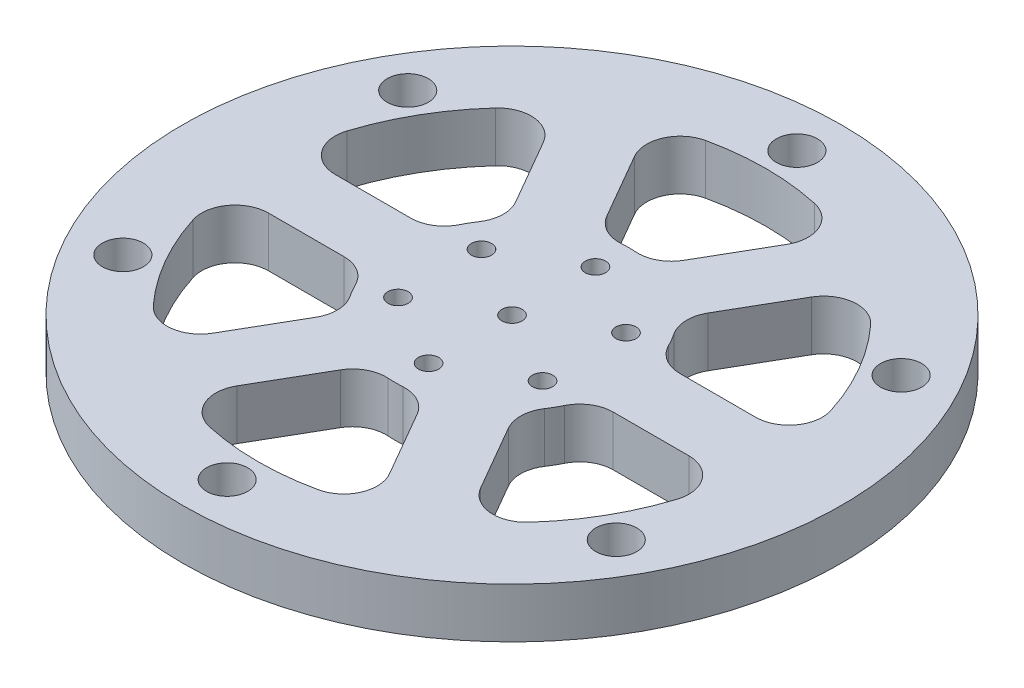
ISO-10303-21;
HEADER;
FILE_DESCRIPTION(('STEP AP214'),'2;1');
FILE_NAME('part.step','',(''),(''),'','','');
FILE_SCHEMA(('AUTOMOTIVE_DESIGN { 1 0 10303 214 1 1 1 1 }'));
ENDSEC;
DATA;
#1=APPLICATION_CONTEXT('core data for automotive mechanical design processes');
#2=APPLICATION_PROTOCOL_DEFINITION('international standard','automotive_design',2000,#1);
#3=PRODUCT_CONTEXT('',#1,'mechanical');
#4=PRODUCT('Part','Part','',(#3));
#5=PRODUCT_RELATED_PRODUCT_CATEGORY('part','',(#4));
#6=PRODUCT_DEFINITION_FORMATION('','',#4);
#7=PRODUCT_DEFINITION_CONTEXT('part definition',#1,'design');
#8=PRODUCT_DEFINITION('design','',#6,#7);
#9=PRODUCT_DEFINITION_SHAPE('','',#8);
#10=(LENGTH_UNIT() NAMED_UNIT(*) SI_UNIT(.MILLI.,.METRE.));
#11=(NAMED_UNIT(*) PLANE_ANGLE_UNIT() SI_UNIT($,.RADIAN.));
#12=(NAMED_UNIT(*) SI_UNIT($,.STERADIAN.) SOLID_ANGLE_UNIT());
#13=UNCERTAINTY_MEASURE_WITH_UNIT(LENGTH_MEASURE(1.E-05),#10,'distance_accuracy_value','');
#14=(GEOMETRIC_REPRESENTATION_CONTEXT(3) GLOBAL_UNCERTAINTY_ASSIGNED_CONTEXT((#13)) GLOBAL_UNIT_ASSIGNED_CONTEXT((#10,
#11,#12)) REPRESENTATION_CONTEXT('',''));
#15=CARTESIAN_POINT('',(0.,0.,0.));
#16=DIRECTION('',(0.,0.,1.));
#17=DIRECTION('',(1.,0.,0.));
#18=AXIS2_PLACEMENT_3D('',#15,#16,#17);
#19=CARTESIAN_POINT('',(0.,4.7625,0.));
#20=DIRECTION('',(0.,1.,0.));
#21=DIRECTION('',(0.,0.,1.));
#22=AXIS2_PLACEMENT_3D('',#19,#20,#21);
#23=PLANE('',#22);
#24=CARTESIAN_POINT('',(1.89084858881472E-13,4.7625,27.1017999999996));
#25=DIRECTION('',(0.,1.,0.));
#26=DIRECTION('',(0.866025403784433,0.,0.50000000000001));
#27=AXIS2_PLACEMENT_3D('',#24,#25,#26);
#28=CIRCLE('',#27,1.9558);
#29=CARTESIAN_POINT('',(1.89084858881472E-13,4.7625,29.0575999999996));
#30=VERTEX_POINT('',#29);
#31=EDGE_CURVE('E818',#30,#30,#28,.T.);
#32=ORIENTED_EDGE('',*,*,#31,.F.);
#33=EDGE_LOOP('',(#32));
#34=FACE_BOUND('',#33,.T.);
#35=CARTESIAN_POINT('',(-3.53883589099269E-13,4.7625,7.93750000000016));
#36=DIRECTION('',(0.,1.,0.));
#37=DIRECTION('',(0.866025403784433,0.,0.50000000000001));
#38=AXIS2_PLACEMENT_3D('',#35,#36,#37);
#39=CIRCLE('',#38,0.965200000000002);
#40=CARTESIAN_POINT('',(-3.53883589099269E-13,4.7625,8.90270000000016));
#41=VERTEX_POINT('',#40);
#42=EDGE_CURVE('E360',#41,#41,#39,.T.);
#43=ORIENTED_EDGE('',*,*,#42,.F.);
#44=EDGE_LOOP('',(#43));
#45=FACE_BOUND('',#44,.T.);
#46=CARTESIAN_POINT('',(0.,4.7625,0.));
#47=DIRECTION('',(0.,1.,0.));
#48=DIRECTION('',(0.866025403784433,0.,0.50000000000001));
#49=AXIS2_PLACEMENT_3D('',#46,#47,#48);
#50=CIRCLE('',#49,24.1591221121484);
#51=CARTESIAN_POINT('',(-5.18187898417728,4.7625,23.59684960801));
#52=VERTEX_POINT('',#51);
#53=CARTESIAN_POINT('',(5.1818789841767,4.7625,23.5968496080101));
#54=VERTEX_POINT('',#53);
#55=EDGE_CURVE('E45',#52,#54,#50,.T.);
#56=ORIENTED_EDGE('',*,*,#55,.F.);
#57=CARTESIAN_POINT('',(-4.50087469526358,4.7625,20.4957436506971));
#58=DIRECTION('',(0.,1.,0.));
#59=DIRECTION('',(-0.866025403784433,0.,-0.50000000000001));
#60=AXIS2_PLACEMENT_3D('',#57,#58,#59);
#61=CIRCLE('',#60,3.175);
#62=CARTESIAN_POINT('',(-7.25050535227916,4.7625,18.9082436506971));
#63=VERTEX_POINT('',#62);
#64=EDGE_CURVE('E354',#63,#52,#61,.T.);
#65=ORIENTED_EDGE('',*,*,#64,.F.);
#66=DIRECTION('',(-0.50000000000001,0.,0.866025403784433));
#67=VECTOR('',#66,1.);
#68=CARTESIAN_POINT('',(-3.64978643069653,4.7625,12.6716155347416));
#69=LINE('',#68,#67);
#70=CARTESIAN_POINT('',(-3.64978643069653,4.7625,12.6716155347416));
#71=VERTEX_POINT('',#70);
#72=EDGE_CURVE('E357',#71,#63,#69,.T.);
#73=ORIENTED_EDGE('',*,*,#72,.F.);
#74=CARTESIAN_POINT('',(-0.900155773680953,4.7625,14.2591155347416));
#75=DIRECTION('',(0.,1.,0.));
#76=DIRECTION('',(0.866025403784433,0.,0.50000000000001));
#77=AXIS2_PLACEMENT_3D('',#74,#75,#76);
#78=CIRCLE('',#77,3.175);
#79=CARTESIAN_POINT('',(-0.700121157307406,4.7625,11.0904231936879));
#80=VERTEX_POINT('',#79);
#81=EDGE_CURVE('E389',#80,#71,#78,.T.);
#82=ORIENTED_EDGE('',*,*,#81,.F.);
#83=CARTESIAN_POINT('',(0.,4.7625,0.));
#84=DIRECTION('',(0.,-1.,0.));
#85=DIRECTION('',(0.866025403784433,0.,0.50000000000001));
#86=AXIS2_PLACEMENT_3D('',#83,#84,#85);
#87=CIRCLE('',#86,11.1125);
#88=CARTESIAN_POINT('',(0.700121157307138,4.7625,11.0904231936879));
#89=VERTEX_POINT('',#88);
#90=EDGE_CURVE('E386',#89,#80,#87,.T.);
#91=ORIENTED_EDGE('',*,*,#90,.F.);
#92=CARTESIAN_POINT('',(0.900155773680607,4.7625,14.2591155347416));
#93=DIRECTION('',(0.,1.,0.));
#94=DIRECTION('',(-0.866025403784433,0.,-0.50000000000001));
#95=AXIS2_PLACEMENT_3D('',#92,#93,#94);
#96=CIRCLE('',#95,3.175);
#97=CARTESIAN_POINT('',(3.64978643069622,4.7625,12.6716155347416));
#98=VERTEX_POINT('',#97);
#99=EDGE_CURVE('E383',#98,#89,#96,.T.);
#100=ORIENTED_EDGE('',*,*,#99,.F.);
#101=DIRECTION('',(-0.499999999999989,0.,-0.866025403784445));
#102=VECTOR('',#101,1.);
#103=CARTESIAN_POINT('',(3.64978643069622,4.7625,12.6716155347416));
#104=LINE('',#103,#102);
#105=CARTESIAN_POINT('',(7.25050535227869,4.7625,18.9082436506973));
#106=VERTEX_POINT('',#105);
#107=EDGE_CURVE('E380',#106,#98,#104,.T.);
#108=ORIENTED_EDGE('',*,*,#107,.F.);
#109=CARTESIAN_POINT('',(4.50087469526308,4.7625,20.4957436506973));
#110=DIRECTION('',(0.,1.,0.));
#111=DIRECTION('',(0.866025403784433,0.,0.50000000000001));
#112=AXIS2_PLACEMENT_3D('',#109,#110,#111);
#113=CIRCLE('',#112,3.175);
#114=EDGE_CURVE('E377',#54,#106,#113,.T.);
#115=ORIENTED_EDGE('',*,*,#114,.F.);
#116=EDGE_LOOP('',(#56,#65,#73,#82,#91,#100,#108,#115));
#117=FACE_BOUND('',#116,.T.);
#118=CARTESIAN_POINT('',(23.4708472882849,4.7625,13.5508999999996));
#119=DIRECTION('',(0.,1.,0.));
#120=DIRECTION('',(0.866025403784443,0.,-0.499999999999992));
#121=AXIS2_PLACEMENT_3D('',#118,#119,#120);
#122=CIRCLE('',#121,1.9558);
#123=CARTESIAN_POINT('',(23.4708472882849,4.7625,15.5066999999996));
#124=VERTEX_POINT('',#123);
#125=EDGE_CURVE('E396',#124,#124,#122,.T.);
#126=ORIENTED_EDGE('',*,*,#125,.F.);
#127=EDGE_LOOP('',(#126));
#128=FACE_BOUND('',#127,.T.);
#129=CARTESIAN_POINT('',(6.87407664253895,4.7625,3.96875000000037));
#130=DIRECTION('',(0.,1.,0.));
#131=DIRECTION('',(0.866025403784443,0.,-0.499999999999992));
#132=AXIS2_PLACEMENT_3D('',#129,#130,#131);
#133=CIRCLE('',#132,0.965200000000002);
#134=CARTESIAN_POINT('',(6.87407664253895,4.7625,4.93395000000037));
#135=VERTEX_POINT('',#134);
#136=EDGE_CURVE('E411',#135,#135,#133,.T.);
#137=ORIENTED_EDGE('',*,*,#136,.F.);
#138=EDGE_LOOP('',(#137));
#139=FACE_BOUND('',#138,.T.);
#140=CARTESIAN_POINT('',(0.,4.7625,0.));
#141=DIRECTION('',(0.,1.,0.));
#142=DIRECTION('',(0.866025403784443,0.,-0.499999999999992));
#143=AXIS2_PLACEMENT_3D('',#140,#141,#142);
#144=CIRCLE('',#143,24.1591221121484);
#145=CARTESIAN_POINT('',(17.8445317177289,4.7625,16.2860636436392));
#146=VERTEX_POINT('',#145);
#147=CARTESIAN_POINT('',(23.026410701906,4.7625,7.31078596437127));
#148=VERTEX_POINT('',#147);
#149=EDGE_CURVE('E417',#146,#148,#144,.T.);
#150=ORIENTED_EDGE('',*,*,#149,.F.);
#151=CARTESIAN_POINT('',(15.4993973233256,4.7625,14.1457436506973));
#152=DIRECTION('',(0.,1.,0.));
#153=DIRECTION('',(-0.866025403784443,0.,0.499999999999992));
#154=AXIS2_PLACEMENT_3D('',#151,#152,#153);
#155=CIRCLE('',#154,3.175);
#156=CARTESIAN_POINT('',(12.74976666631,4.7625,15.7332436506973));
#157=VERTEX_POINT('',#156);
#158=EDGE_CURVE('E424',#157,#146,#155,.T.);
#159=ORIENTED_EDGE('',*,*,#158,.F.);
#160=DIRECTION('',(0.499999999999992,0.,0.866025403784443));
#161=VECTOR('',#160,1.);
#162=CARTESIAN_POINT('',(9.14904774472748,4.7625,9.49661553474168));
#163=LINE('',#162,#161);
#164=CARTESIAN_POINT('',(9.14904774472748,4.7625,9.49661553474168));
#165=VERTEX_POINT('',#164);
#166=EDGE_CURVE('E462',#165,#157,#163,.T.);
#167=ORIENTED_EDGE('',*,*,#166,.F.);
#168=CARTESIAN_POINT('',(11.8986784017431,4.7625,7.90911553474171));
#169=DIRECTION('',(0.,1.,0.));
#170=DIRECTION('',(0.866025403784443,0.,-0.499999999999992));
#171=AXIS2_PLACEMENT_3D('',#168,#169,#170);
#172=CIRCLE('',#171,3.175);
#173=CARTESIAN_POINT('',(9.25452764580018,4.7625,6.1515343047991));
#174=VERTEX_POINT('',#173);
#175=EDGE_CURVE('E459',#174,#165,#172,.T.);
#176=ORIENTED_EDGE('',*,*,#175,.F.);
#177=CARTESIAN_POINT('',(0.,4.7625,0.));
#178=DIRECTION('',(0.,-1.,0.));
#179=DIRECTION('',(0.866025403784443,0.,-0.499999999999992));
#180=AXIS2_PLACEMENT_3D('',#177,#178,#179);
#181=CIRCLE('',#180,11.1125);
#182=CARTESIAN_POINT('',(9.95464880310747,4.7625,4.93888888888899));
#183=VERTEX_POINT('',#182);
#184=EDGE_CURVE('E456',#183,#174,#181,.T.);
#185=ORIENTED_EDGE('',*,*,#184,.F.);
#186=CARTESIAN_POINT('',(12.7988341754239,4.7625,6.35000000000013));
#187=DIRECTION('',(0.,1.,0.));
#188=DIRECTION('',(-0.866025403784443,0.,0.499999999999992));
#189=AXIS2_PLACEMENT_3D('',#186,#187,#188);
#190=CIRCLE('',#189,3.175);
#191=CARTESIAN_POINT('',(12.7988341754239,4.7625,3.17500000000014));
#192=VERTEX_POINT('',#191);
#193=EDGE_CURVE('E453',#192,#183,#190,.T.);
#194=ORIENTED_EDGE('',*,*,#193,.F.);
#195=DIRECTION('',(-1.,0.,0.));
#196=VECTOR('',#195,1.);
#197=CARTESIAN_POINT('',(12.7988341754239,4.7625,3.17500000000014));
#198=LINE('',#197,#196);
#199=CARTESIAN_POINT('',(20.000272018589,4.7625,3.17500000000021));
#200=VERTEX_POINT('',#199);
#201=EDGE_CURVE('E450',#200,#192,#198,.T.);
#202=ORIENTED_EDGE('',*,*,#201,.F.);
#203=CARTESIAN_POINT('',(20.000272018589,4.7625,6.35000000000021));
#204=DIRECTION('',(0.,1.,0.));
#205=DIRECTION('',(0.866025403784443,0.,-0.499999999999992));
#206=AXIS2_PLACEMENT_3D('',#203,#204,#205);
#207=CIRCLE('',#206,3.175);
#208=EDGE_CURVE('E447',#148,#200,#207,.T.);
#209=ORIENTED_EDGE('',*,*,#208,.F.);
#210=EDGE_LOOP('',(#150,#159,#167,#176,#185,#194,#202,#209));
#211=FACE_BOUND('',#210,.T.);
#212=CARTESIAN_POINT('',(23.4708472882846,4.7625,-13.5509000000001));
#213=DIRECTION('',(0.,1.,0.));
#214=DIRECTION('',(0.,0.,-1.));
#215=AXIS2_PLACEMENT_3D('',#212,#213,#214);
#216=CIRCLE('',#215,1.9558);
#217=CARTESIAN_POINT('',(23.4708472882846,4.7625,-11.5951000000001));
#218=VERTEX_POINT('',#217);
#219=EDGE_CURVE('E469',#218,#218,#216,.T.);
#220=ORIENTED_EDGE('',*,*,#219,.F.);
#221=EDGE_LOOP('',(#220));
#222=FACE_BOUND('',#221,.T.);
#223=CARTESIAN_POINT('',(6.87407664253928,4.7625,-3.96874999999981));
#224=DIRECTION('',(0.,1.,0.));
#225=DIRECTION('',(0.,0.,-1.));
#226=AXIS2_PLACEMENT_3D('',#223,#224,#225);
#227=CIRCLE('',#226,0.965200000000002);
#228=CARTESIAN_POINT('',(6.87407664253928,4.7625,-3.0035499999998));
#229=VERTEX_POINT('',#228);
#230=EDGE_CURVE('E487',#229,#229,#227,.T.);
#231=ORIENTED_EDGE('',*,*,#230,.F.);
#232=EDGE_LOOP('',(#231));
#233=FACE_BOUND('',#232,.T.);
#234=CARTESIAN_POINT('',(0.,4.7625,0.));
#235=DIRECTION('',(0.,1.,0.));
#236=DIRECTION('',(0.,0.,-1.));
#237=AXIS2_PLACEMENT_3D('',#234,#235,#236);
#238=CIRCLE('',#237,24.1591221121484);
#239=CARTESIAN_POINT('',(23.0264107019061,4.7625,-7.31078596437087));
#240=VERTEX_POINT('',#239);
#241=CARTESIAN_POINT('',(17.8445317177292,4.7625,-16.2860636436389));
#242=VERTEX_POINT('',#241);
#243=EDGE_CURVE('E493',#240,#242,#238,.T.);
#244=ORIENTED_EDGE('',*,*,#243,.F.);
#245=CARTESIAN_POINT('',(20.0002720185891,4.7625,-6.34999999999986));
#246=DIRECTION('',(0.,1.,0.));
#247=DIRECTION('',(0.,0.,1.));
#248=AXIS2_PLACEMENT_3D('',#245,#246,#247);
#249=CIRCLE('',#248,3.175);
#250=CARTESIAN_POINT('',(20.0002720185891,4.7625,-3.17499999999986));
#251=VERTEX_POINT('',#250);
#252=EDGE_CURVE('E500',#251,#240,#249,.T.);
#253=ORIENTED_EDGE('',*,*,#252,.F.);
#254=DIRECTION('',(1.,0.,0.));
#255=VECTOR('',#254,1.);
#256=CARTESIAN_POINT('',(12.798834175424,4.7625,-3.17499999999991));
#257=LINE('',#256,#255);
#258=CARTESIAN_POINT('',(12.798834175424,4.7625,-3.17499999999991));
#259=VERTEX_POINT('',#258);
#260=EDGE_CURVE('E538',#259,#251,#257,.T.);
#261=ORIENTED_EDGE('',*,*,#260,.F.);
#262=CARTESIAN_POINT('',(12.798834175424,4.7625,-6.34999999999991));
#263=DIRECTION('',(0.,1.,0.));
#264=DIRECTION('',(0.,0.,-1.));
#265=AXIS2_PLACEMENT_3D('',#262,#263,#264);
#266=CIRCLE('',#265,3.175);
#267=CARTESIAN_POINT('',(9.95464880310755,4.7625,-4.93888888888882));
#268=VERTEX_POINT('',#267);
#269=EDGE_CURVE('E535',#268,#259,#266,.T.);
#270=ORIENTED_EDGE('',*,*,#269,.F.);
#271=CARTESIAN_POINT('',(0.,4.7625,0.));
#272=DIRECTION('',(0.,-1.,0.));
#273=DIRECTION('',(0.,0.,-1.));
#274=AXIS2_PLACEMENT_3D('',#271,#272,#273);
#275=CIRCLE('',#274,11.1125);
#276=CARTESIAN_POINT('',(9.25452764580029,4.7625,-6.15153430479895));
#277=VERTEX_POINT('',#276);
#278=EDGE_CURVE('E532',#277,#268,#275,.T.);
#279=ORIENTED_EDGE('',*,*,#278,.F.);
#280=CARTESIAN_POINT('',(11.8986784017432,4.7625,-7.9091155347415));
#281=DIRECTION('',(0.,1.,0.));
#282=DIRECTION('',(0.,0.,1.));
#283=AXIS2_PLACEMENT_3D('',#280,#281,#282);
#284=CIRCLE('',#283,3.175);
#285=CARTESIAN_POINT('',(9.14904774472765,4.7625,-9.49661553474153));
#286=VERTEX_POINT('',#285);
#287=EDGE_CURVE('E529',#286,#277,#284,.T.);
#288=ORIENTED_EDGE('',*,*,#287,.F.);
#289=DIRECTION('',(-0.500000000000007,0.,0.866025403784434));
#290=VECTOR('',#289,1.);
#291=CARTESIAN_POINT('',(9.14904774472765,4.7625,-9.49661553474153));
#292=LINE('',#291,#290);
#293=CARTESIAN_POINT('',(12.7497666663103,4.7625,-15.7332436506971));
#294=VERTEX_POINT('',#293);
#295=EDGE_CURVE('E526',#294,#286,#292,.T.);
#296=ORIENTED_EDGE('',*,*,#295,.F.);
#297=CARTESIAN_POINT('',(15.4993973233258,4.7625,-14.1457436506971));
#298=DIRECTION('',(0.,1.,0.));
#299=DIRECTION('',(0.,0.,-1.));
#300=AXIS2_PLACEMENT_3D('',#297,#298,#299);
#301=CIRCLE('',#300,3.175);
#302=EDGE_CURVE('E523',#242,#294,#301,.T.);
#303=ORIENTED_EDGE('',*,*,#302,.F.);
#304=EDGE_LOOP('',(#244,#253,#261,#270,#279,#288,#296,#303));
#305=FACE_BOUND('',#304,.T.);
#306=CARTESIAN_POINT('',(-3.78169717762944E-13,4.7625,-27.1017999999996));
#307=DIRECTION('',(0.,1.,0.));
#308=DIRECTION('',(-0.866025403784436,0.,-0.500000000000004));
#309=AXIS2_PLACEMENT_3D('',#306,#307,#308);
#310=CIRCLE('',#309,1.9558);
#311=CARTESIAN_POINT('',(-3.78169717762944E-13,4.7625,-25.1459999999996));
#312=VERTEX_POINT('',#311);
#313=EDGE_CURVE('E545',#312,#312,#310,.T.);
#314=ORIENTED_EDGE('',*,*,#313,.F.);
#315=EDGE_LOOP('',(#314));
#316=FACE_BOUND('',#315,.T.);
#317=CARTESIAN_POINT('',(2.98372437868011E-13,4.7625,-7.93750000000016));
#318=DIRECTION('',(0.,1.,0.));
#319=DIRECTION('',(-0.866025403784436,0.,-0.500000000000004));
#320=AXIS2_PLACEMENT_3D('',#317,#318,#319);
#321=CIRCLE('',#320,0.965200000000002);
#322=CARTESIAN_POINT('',(2.98372437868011E-13,4.7625,-6.97230000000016));
#323=VERTEX_POINT('',#322);
#324=EDGE_CURVE('E563',#323,#323,#321,.T.);
#325=ORIENTED_EDGE('',*,*,#324,.F.);
#326=EDGE_LOOP('',(#325));
#327=FACE_BOUND('',#326,.T.);
#328=CARTESIAN_POINT('',(0.,4.7625,0.));
#329=DIRECTION('',(0.,1.,0.));
#330=DIRECTION('',(-0.866025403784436,0.,-0.500000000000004));
#331=AXIS2_PLACEMENT_3D('',#328,#329,#330);
#332=CIRCLE('',#331,24.1591221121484);
#333=CARTESIAN_POINT('',(5.18187898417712,4.7625,-23.59684960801));
#334=VERTEX_POINT('',#333);
#335=CARTESIAN_POINT('',(-5.18187898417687,4.7625,-23.5968496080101));
#336=VERTEX_POINT('',#335);
#337=EDGE_CURVE('E569',#334,#336,#332,.T.);
#338=ORIENTED_EDGE('',*,*,#337,.F.);
#339=CARTESIAN_POINT('',(4.50087469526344,4.7625,-20.4957436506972));
#340=DIRECTION('',(0.,1.,0.));
#341=DIRECTION('',(0.866025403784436,0.,0.500000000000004));
#342=AXIS2_PLACEMENT_3D('',#339,#340,#341);
#343=CIRCLE('',#342,3.175);
#344=CARTESIAN_POINT('',(7.25050535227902,4.7625,-18.9082436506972));
#345=VERTEX_POINT('',#344);
#346=EDGE_CURVE('E576',#345,#334,#343,.T.);
#347=ORIENTED_EDGE('',*,*,#346,.F.);
#348=DIRECTION('',(0.500000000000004,0.,-0.866025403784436));
#349=VECTOR('',#348,1.);
#350=CARTESIAN_POINT('',(3.64978643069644,4.7625,-12.6716155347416));
#351=LINE('',#350,#349);
#352=CARTESIAN_POINT('',(3.64978643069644,4.7625,-12.6716155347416));
#353=VERTEX_POINT('',#352);
#354=EDGE_CURVE('E614',#353,#345,#351,.T.);
#355=ORIENTED_EDGE('',*,*,#354,.F.);
#356=CARTESIAN_POINT('',(0.900155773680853,4.7625,-14.2591155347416));
#357=DIRECTION('',(0.,1.,0.));
#358=DIRECTION('',(-0.866025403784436,0.,-0.500000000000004));
#359=AXIS2_PLACEMENT_3D('',#356,#357,#358);
#360=CIRCLE('',#359,3.175);
#361=CARTESIAN_POINT('',(0.700121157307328,4.7625,-11.0904231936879));
#362=VERTEX_POINT('',#361);
#363=EDGE_CURVE('E611',#362,#353,#360,.T.);
#364=ORIENTED_EDGE('',*,*,#363,.F.);
#365=CARTESIAN_POINT('',(0.,4.7625,0.));
#366=DIRECTION('',(0.,-1.,0.));
#367=DIRECTION('',(-0.866025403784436,0.,-0.500000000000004));
#368=AXIS2_PLACEMENT_3D('',#365,#366,#367);
#369=CIRCLE('',#368,11.1125);
#370=CARTESIAN_POINT('',(-0.700121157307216,4.7625,-11.0904231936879));
#371=VERTEX_POINT('',#370);
#372=EDGE_CURVE('E608',#371,#362,#369,.T.);
#373=ORIENTED_EDGE('',*,*,#372,.F.);
#374=CARTESIAN_POINT('',(-0.900155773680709,4.7625,-14.2591155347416));
#375=DIRECTION('',(0.,1.,0.));
#376=DIRECTION('',(0.866025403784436,0.,0.500000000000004));
#377=AXIS2_PLACEMENT_3D('',#374,#375,#376);
#378=CIRCLE('',#377,3.175);
#379=CARTESIAN_POINT('',(-3.64978643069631,4.7625,-12.6716155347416));
#380=VERTEX_POINT('',#379);
#381=EDGE_CURVE('E605',#380,#371,#378,.T.);
#382=ORIENTED_EDGE('',*,*,#381,.F.);
#383=DIRECTION('',(0.499999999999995,0.,0.866025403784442));
#384=VECTOR('',#383,1.);
#385=CARTESIAN_POINT('',(-3.64978643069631,4.7625,-12.6716155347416));
#386=LINE('',#385,#384);
#387=CARTESIAN_POINT('',(-7.25050535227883,4.7625,-18.9082436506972));
#388=VERTEX_POINT('',#387);
#389=EDGE_CURVE('E602',#388,#380,#386,.T.);
#390=ORIENTED_EDGE('',*,*,#389,.F.);
#391=CARTESIAN_POINT('',(-4.50087469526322,4.7625,-20.4957436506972));
#392=DIRECTION('',(0.,1.,0.));
#393=DIRECTION('',(-0.866025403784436,0.,-0.500000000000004));
#394=AXIS2_PLACEMENT_3D('',#391,#392,#393);
#395=CIRCLE('',#394,3.175);
#396=EDGE_CURVE('E599',#336,#388,#395,.T.);
#397=ORIENTED_EDGE('',*,*,#396,.F.);
#398=EDGE_LOOP('',(#338,#347,#355,#364,#373,#382,#390,#397));
#399=FACE_BOUND('',#398,.T.);
#400=CARTESIAN_POINT('',(-23.470847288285,4.7625,-13.5508999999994));
#401=DIRECTION('',(0.,1.,0.));
#402=DIRECTION('',(-0.86602540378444,0.,0.499999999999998));
#403=AXIS2_PLACEMENT_3D('',#400,#401,#402);
#404=CIRCLE('',#403,1.9558);
#405=CARTESIAN_POINT('',(-23.470847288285,4.7625,-11.5950999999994));
#406=VERTEX_POINT('',#405);
#407=EDGE_CURVE('E621',#406,#406,#404,.T.);
#408=ORIENTED_EDGE('',*,*,#407,.F.);
#409=EDGE_LOOP('',(#408));
#410=FACE_BOUND('',#409,.T.);
#411=CARTESIAN_POINT('',(-6.87407664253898,4.7625,-3.96875000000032));
#412=DIRECTION('',(0.,1.,0.));
#413=DIRECTION('',(-0.86602540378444,0.,0.499999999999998));
#414=AXIS2_PLACEMENT_3D('',#411,#412,#413);
#415=CIRCLE('',#414,0.965200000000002);
#416=CARTESIAN_POINT('',(-6.87407664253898,4.7625,-3.00355000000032));
#417=VERTEX_POINT('',#416);
#418=EDGE_CURVE('E639',#417,#417,#415,.T.);
#419=ORIENTED_EDGE('',*,*,#418,.F.);
#420=EDGE_LOOP('',(#419));
#421=FACE_BOUND('',#420,.T.);
#422=CARTESIAN_POINT('',(0.,4.7625,0.));
#423=DIRECTION('',(0.,1.,0.));
#424=DIRECTION('',(-0.86602540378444,0.,0.499999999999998));
#425=AXIS2_PLACEMENT_3D('',#422,#423,#424);
#426=CIRCLE('',#425,24.1591221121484);
#427=CARTESIAN_POINT('',(-17.844531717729,4.7625,-16.2860636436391));
#428=VERTEX_POINT('',#427);
#429=CARTESIAN_POINT('',(-23.026410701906,4.7625,-7.31078596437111));
#430=VERTEX_POINT('',#429);
#431=EDGE_CURVE('E645',#428,#430,#426,.T.);
#432=ORIENTED_EDGE('',*,*,#431,.F.);
#433=CARTESIAN_POINT('',(-15.4993973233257,4.7625,-14.1457436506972));
#434=DIRECTION('',(0.,1.,0.));
#435=DIRECTION('',(0.86602540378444,0.,-0.499999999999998));
#436=AXIS2_PLACEMENT_3D('',#433,#434,#435);
#437=CIRCLE('',#436,3.175);
#438=CARTESIAN_POINT('',(-12.7497666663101,4.7625,-15.7332436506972));
#439=VERTEX_POINT('',#438);
#440=EDGE_CURVE('E652',#439,#428,#437,.T.);
#441=ORIENTED_EDGE('',*,*,#440,.F.);
#442=DIRECTION('',(-0.499999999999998,0.,-0.86602540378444));
#443=VECTOR('',#442,1.);
#444=CARTESIAN_POINT('',(-9.14904774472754,4.7625,-9.49661553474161));
#445=LINE('',#444,#443);
#446=CARTESIAN_POINT('',(-9.14904774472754,4.7625,-9.49661553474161));
#447=VERTEX_POINT('',#446);
#448=EDGE_CURVE('E690',#447,#439,#445,.T.);
#449=ORIENTED_EDGE('',*,*,#448,.F.);
#450=CARTESIAN_POINT('',(-11.8986784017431,4.7625,-7.90911553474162));
#451=DIRECTION('',(0.,1.,0.));
#452=DIRECTION('',(-0.86602540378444,0.,0.499999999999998));
#453=AXIS2_PLACEMENT_3D('',#450,#451,#452);
#454=CIRCLE('',#453,3.175);
#455=CARTESIAN_POINT('',(-9.25452764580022,4.7625,-6.15153430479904));
#456=VERTEX_POINT('',#455);
#457=EDGE_CURVE('E687',#456,#447,#454,.T.);
#458=ORIENTED_EDGE('',*,*,#457,.F.);
#459=CARTESIAN_POINT('',(0.,4.7625,0.));
#460=DIRECTION('',(0.,-1.,0.));
#461=DIRECTION('',(-0.86602540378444,0.,0.499999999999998));
#462=AXIS2_PLACEMENT_3D('',#459,#460,#461);
#463=CIRCLE('',#462,11.1125);
#464=CARTESIAN_POINT('',(-9.9546488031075,4.7625,-4.93888888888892));
#465=VERTEX_POINT('',#464);
#466=EDGE_CURVE('E684',#465,#456,#463,.T.);
#467=ORIENTED_EDGE('',*,*,#466,.F.);
#468=CARTESIAN_POINT('',(-12.7988341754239,4.7625,-6.35000000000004));
#469=DIRECTION('',(0.,1.,0.));
#470=DIRECTION('',(0.86602540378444,0.,-0.499999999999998));
#471=AXIS2_PLACEMENT_3D('',#468,#469,#470);
#472=CIRCLE('',#471,3.175);
#473=CARTESIAN_POINT('',(-12.7988341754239,4.7625,-3.17500000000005));
#474=VERTEX_POINT('',#473);
#475=EDGE_CURVE('E681',#474,#465,#472,.T.);
#476=ORIENTED_EDGE('',*,*,#475,.F.);
#477=DIRECTION('',(1.,0.,0.));
#478=VECTOR('',#477,1.);
#479=CARTESIAN_POINT('',(-12.7988341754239,4.7625,-3.17500000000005));
#480=LINE('',#479,#478);
#481=CARTESIAN_POINT('',(-20.0002720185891,4.7625,-3.17500000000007));
#482=VERTEX_POINT('',#481);
#483=EDGE_CURVE('E678',#482,#474,#480,.T.);
#484=ORIENTED_EDGE('',*,*,#483,.F.);
#485=CARTESIAN_POINT('',(-20.000272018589,4.7625,-6.35000000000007));
#486=DIRECTION('',(0.,1.,0.));
#487=DIRECTION('',(-0.86602540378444,0.,0.499999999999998));
#488=AXIS2_PLACEMENT_3D('',#485,#486,#487);
#489=CIRCLE('',#488,3.175);
#490=EDGE_CURVE('E675',#430,#482,#489,.T.);
#491=ORIENTED_EDGE('',*,*,#490,.F.);
#492=EDGE_LOOP('',(#432,#441,#449,#458,#467,#476,#484,#491));
#493=FACE_BOUND('',#492,.T.);
#494=CARTESIAN_POINT('',(-23.4708472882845,4.7625,13.5509000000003));
#495=DIRECTION('',(0.,1.,0.));
#496=DIRECTION('',(0.,0.,1.));
#497=AXIS2_PLACEMENT_3D('',#494,#495,#496);
#498=CIRCLE('',#497,1.9558);
#499=CARTESIAN_POINT('',(-23.4708472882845,4.7625,15.5067000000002));
#500=VERTEX_POINT('',#499);
#501=EDGE_CURVE('E697',#500,#500,#498,.T.);
#502=ORIENTED_EDGE('',*,*,#501,.F.);
#503=EDGE_LOOP('',(#502));
#504=FACE_BOUND('',#503,.T.);
#505=CARTESIAN_POINT('',(-6.87407664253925,4.7625,3.96874999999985));
#506=DIRECTION('',(0.,1.,0.));
#507=DIRECTION('',(0.,0.,1.));
#508=AXIS2_PLACEMENT_3D('',#505,#506,#507);
#509=CIRCLE('',#508,0.965200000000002);
#510=CARTESIAN_POINT('',(-6.87407664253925,4.7625,4.93394999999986));
#511=VERTEX_POINT('',#510);
#512=EDGE_CURVE('E715',#511,#511,#509,.T.);
#513=ORIENTED_EDGE('',*,*,#512,.F.);
#514=EDGE_LOOP('',(#513));
#515=FACE_BOUND('',#514,.T.);
#516=CARTESIAN_POINT('',(0.,4.7625,0.));
#517=DIRECTION('',(0.,1.,0.));
#518=DIRECTION('',(0.,0.,1.));
#519=AXIS2_PLACEMENT_3D('',#516,#517,#518);
#520=CIRCLE('',#519,24.1591221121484);
#521=CARTESIAN_POINT('',(-23.0264107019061,4.7625,7.31078596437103));
#522=VERTEX_POINT('',#521);
#523=CARTESIAN_POINT('',(-17.8445317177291,4.7625,16.286063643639));
#524=VERTEX_POINT('',#523);
#525=EDGE_CURVE('E721',#522,#524,#520,.T.);
#526=ORIENTED_EDGE('',*,*,#525,.F.);
#527=CARTESIAN_POINT('',(-20.0002720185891,4.7625,6.35));
#528=DIRECTION('',(0.,1.,0.));
#529=DIRECTION('',(0.,0.,-1.));
#530=AXIS2_PLACEMENT_3D('',#527,#528,#529);
#531=CIRCLE('',#530,3.175);
#532=CARTESIAN_POINT('',(-20.0002720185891,4.7625,3.175));
#533=VERTEX_POINT('',#532);
#534=EDGE_CURVE('E728',#533,#522,#531,.T.);
#535=ORIENTED_EDGE('',*,*,#534,.F.);
#536=DIRECTION('',(-1.,0.,0.));
#537=VECTOR('',#536,1.);
#538=CARTESIAN_POINT('',(-12.7988341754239,4.7625,3.175));
#539=LINE('',#538,#537);
#540=CARTESIAN_POINT('',(-12.7988341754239,4.7625,3.175));
#541=VERTEX_POINT('',#540);
#542=EDGE_CURVE('E766',#541,#533,#539,.T.);
#543=ORIENTED_EDGE('',*,*,#542,.F.);
#544=CARTESIAN_POINT('',(-12.7988341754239,4.7625,6.35));
#545=DIRECTION('',(0.,1.,0.));
#546=DIRECTION('',(0.,0.,1.));
#547=AXIS2_PLACEMENT_3D('',#544,#545,#546);
#548=CIRCLE('',#547,3.175);
#549=CARTESIAN_POINT('',(-9.95464880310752,4.7625,4.93888888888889));
#550=VERTEX_POINT('',#549);
#551=EDGE_CURVE('E763',#550,#541,#548,.T.);
#552=ORIENTED_EDGE('',*,*,#551,.F.);
#553=CARTESIAN_POINT('',(0.,4.7625,0.));
#554=DIRECTION('',(0.,-1.,0.));
#555=DIRECTION('',(0.,0.,1.));
#556=AXIS2_PLACEMENT_3D('',#553,#554,#555);
#557=CIRCLE('',#556,11.1125);
#558=CARTESIAN_POINT('',(-9.25452764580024,4.7625,6.15153430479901));
#559=VERTEX_POINT('',#558);
#560=EDGE_CURVE('E760',#559,#550,#557,.T.);
#561=ORIENTED_EDGE('',*,*,#560,.F.);
#562=CARTESIAN_POINT('',(-11.8986784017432,4.7625,7.90911553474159));
#563=DIRECTION('',(0.,1.,0.));
#564=DIRECTION('',(0.,0.,-1.));
#565=AXIS2_PLACEMENT_3D('',#562,#563,#564);
#566=CIRCLE('',#565,3.175);
#567=CARTESIAN_POINT('',(-9.14904774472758,4.7625,9.49661553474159));
#568=VERTEX_POINT('',#567);
#569=EDGE_CURVE('E757',#568,#559,#566,.T.);
#570=ORIENTED_EDGE('',*,*,#569,.F.);
#571=DIRECTION('',(0.500000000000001,0.,-0.866025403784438));
#572=VECTOR('',#571,1.);
#573=CARTESIAN_POINT('',(-9.14904774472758,4.7625,9.49661553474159));
#574=LINE('',#573,#572);
#575=CARTESIAN_POINT('',(-12.7497666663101,4.7625,15.7332436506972));
#576=VERTEX_POINT('',#575);
#577=EDGE_CURVE('E754',#576,#568,#574,.T.);
#578=ORIENTED_EDGE('',*,*,#577,.F.);
#579=CARTESIAN_POINT('',(-15.4993973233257,4.7625,14.1457436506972));
#580=DIRECTION('',(0.,1.,0.));
#581=DIRECTION('',(0.,0.,1.));
#582=AXIS2_PLACEMENT_3D('',#579,#580,#581);
#583=CIRCLE('',#582,3.175);
#584=EDGE_CURVE('E751',#524,#576,#583,.T.);
#585=ORIENTED_EDGE('',*,*,#584,.F.);
#586=EDGE_LOOP('',(#526,#535,#543,#552,#561,#570,#578,#585));
#587=FACE_BOUND('',#586,.T.);
#588=CARTESIAN_POINT('',(0.,4.7625,0.));
#589=DIRECTION('',(0.,1.,0.));
#590=DIRECTION('',(0.,0.,1.));
#591=AXIS2_PLACEMENT_3D('',#588,#589,#590);
#592=CIRCLE('',#591,31.353125);
#593=CARTESIAN_POINT('',(0.,4.7625,-31.353125));
#594=VERTEX_POINT('',#593);
#595=EDGE_CURVE('E11',#594,#594,#592,.T.);
#596=ORIENTED_EDGE('',*,*,#595,.T.);
#597=EDGE_LOOP('',(#596));
#598=FACE_BOUND('',#597,.T.);
#599=CARTESIAN_POINT('',(0.,4.7625,0.));
#600=DIRECTION('',(0.,1.,0.));
#601=DIRECTION('',(0.,0.,1.));
#602=AXIS2_PLACEMENT_3D('',#599,#600,#601);
#603=CIRCLE('',#602,0.9652);
#604=CARTESIAN_POINT('',(0.,4.7625,-0.9652));
#605=VERTEX_POINT('',#604);
#606=EDGE_CURVE('E788',#605,#605,#603,.T.);
#607=ORIENTED_EDGE('',*,*,#606,.F.);
#608=EDGE_LOOP('',(#607));
#609=FACE_BOUND('',#608,.T.);
#610=ADVANCED_FACE('F30',(#34,#45,#117,#128,#139,#211,#222,#233,#305,#316,#327,#399,#410,#421,
#493,#504,#515,#587,#598,#609),#23,.T.);
#611=CARTESIAN_POINT('',(0.,0.,0.));
#612=DIRECTION('',(0.,1.,0.));
#613=DIRECTION('',(0.,0.,1.));
#614=AXIS2_PLACEMENT_3D('',#611,#612,#613);
#615=PLANE('',#614);
#616=CARTESIAN_POINT('',(1.89084858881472E-13,0.,27.1017999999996));
#617=DIRECTION('',(0.,1.,0.));
#618=DIRECTION('',(0.866025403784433,0.,0.50000000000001));
#619=AXIS2_PLACEMENT_3D('',#616,#617,#618);
#620=CIRCLE('',#619,1.9558);
#621=CARTESIAN_POINT('',(1.89084858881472E-13,0.,29.0575999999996));
#622=VERTEX_POINT('',#621);
#623=EDGE_CURVE('E1122',#622,#622,#620,.T.);
#624=ORIENTED_EDGE('',*,*,#623,.T.);
#625=EDGE_LOOP('',(#624));
#626=FACE_BOUND('',#625,.T.);
#627=CARTESIAN_POINT('',(-3.53883589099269E-13,0.,7.93750000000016));
#628=DIRECTION('',(0.,1.,0.));
#629=DIRECTION('',(0.866025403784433,0.,0.50000000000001));
#630=AXIS2_PLACEMENT_3D('',#627,#628,#629);
#631=CIRCLE('',#630,0.965200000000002);
#632=CARTESIAN_POINT('',(-3.53883589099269E-13,0.,8.90270000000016));
#633=VERTEX_POINT('',#632);
#634=EDGE_CURVE('E378',#633,#633,#631,.T.);
#635=ORIENTED_EDGE('',*,*,#634,.T.);
#636=EDGE_LOOP('',(#635));
#637=FACE_BOUND('',#636,.T.);
#638=CARTESIAN_POINT('',(-4.50087469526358,0.,20.4957436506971));
#639=DIRECTION('',(0.,1.,0.));
#640=DIRECTION('',(-0.866025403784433,0.,-0.50000000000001));
#641=AXIS2_PLACEMENT_3D('',#638,#639,#640);
#642=CIRCLE('',#641,3.175);
#643=CARTESIAN_POINT('',(-7.25050535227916,0.,18.9082436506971));
#644=VERTEX_POINT('',#643);
#645=CARTESIAN_POINT('',(-5.18187898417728,0.,23.59684960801));
#646=VERTEX_POINT('',#645);
#647=EDGE_CURVE('E343',#644,#646,#642,.T.);
#648=ORIENTED_EDGE('',*,*,#647,.T.);
#649=CARTESIAN_POINT('',(0.,0.,0.));
#650=DIRECTION('',(0.,1.,0.));
#651=DIRECTION('',(0.866025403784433,0.,0.50000000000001));
#652=AXIS2_PLACEMENT_3D('',#649,#650,#651);
#653=CIRCLE('',#652,24.1591221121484);
#654=CARTESIAN_POINT('',(5.1818789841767,0.,23.5968496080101));
#655=VERTEX_POINT('',#654);
#656=EDGE_CURVE('E337',#646,#655,#653,.T.);
#657=ORIENTED_EDGE('',*,*,#656,.T.);
#658=CARTESIAN_POINT('',(4.50087469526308,0.,20.4957436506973));
#659=DIRECTION('',(0.,1.,0.));
#660=DIRECTION('',(0.866025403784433,0.,0.50000000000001));
#661=AXIS2_PLACEMENT_3D('',#658,#659,#660);
#662=CIRCLE('',#661,3.175);
#663=CARTESIAN_POINT('',(7.25050535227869,0.,18.9082436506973));
#664=VERTEX_POINT('',#663);
#665=EDGE_CURVE('E346',#655,#664,#662,.T.);
#666=ORIENTED_EDGE('',*,*,#665,.T.);
#667=DIRECTION('',(-0.499999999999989,0.,-0.866025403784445));
#668=VECTOR('',#667,1.);
#669=CARTESIAN_POINT('',(3.64978643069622,0.,12.6716155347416));
#670=LINE('',#669,#668);
#671=CARTESIAN_POINT('',(3.64978643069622,0.,12.6716155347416));
#672=VERTEX_POINT('',#671);
#673=EDGE_CURVE('E53',#664,#672,#670,.T.);
#674=ORIENTED_EDGE('',*,*,#673,.T.);
#675=CARTESIAN_POINT('',(0.900155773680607,0.,14.2591155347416));
#676=DIRECTION('',(0.,1.,0.));
#677=DIRECTION('',(-0.866025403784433,0.,-0.50000000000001));
#678=AXIS2_PLACEMENT_3D('',#675,#676,#677);
#679=CIRCLE('',#678,3.175);
#680=CARTESIAN_POINT('',(0.700121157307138,0.,11.0904231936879));
#681=VERTEX_POINT('',#680);
#682=EDGE_CURVE('E364',#672,#681,#679,.T.);
#683=ORIENTED_EDGE('',*,*,#682,.T.);
#684=CARTESIAN_POINT('',(0.,0.,0.));
#685=DIRECTION('',(0.,-1.,0.));
#686=DIRECTION('',(0.866025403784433,0.,0.50000000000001));
#687=AXIS2_PLACEMENT_3D('',#684,#685,#686);
#688=CIRCLE('',#687,11.1125);
#689=CARTESIAN_POINT('',(-0.700121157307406,0.,11.0904231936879));
#690=VERTEX_POINT('',#689);
#691=EDGE_CURVE('E367',#681,#690,#688,.T.);
#692=ORIENTED_EDGE('',*,*,#691,.T.);
#693=CARTESIAN_POINT('',(-0.900155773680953,0.,14.2591155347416));
#694=DIRECTION('',(0.,1.,0.));
#695=DIRECTION('',(0.866025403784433,0.,0.50000000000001));
#696=AXIS2_PLACEMENT_3D('',#693,#694,#695);
#697=CIRCLE('',#696,3.175);
#698=CARTESIAN_POINT('',(-3.64978643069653,0.,12.6716155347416));
#699=VERTEX_POINT('',#698);
#700=EDGE_CURVE('E370',#690,#699,#697,.T.);
#701=ORIENTED_EDGE('',*,*,#700,.T.);
#702=DIRECTION('',(-0.50000000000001,0.,0.866025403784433));
#703=VECTOR('',#702,1.);
#704=CARTESIAN_POINT('',(-3.64978643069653,0.,12.6716155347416));
#705=LINE('',#704,#703);
#706=EDGE_CURVE('E373',#699,#644,#705,.T.);
#707=ORIENTED_EDGE('',*,*,#706,.T.);
#708=EDGE_LOOP('',(#648,#657,#666,#674,#683,#692,#701,#707));
#709=FACE_BOUND('',#708,.T.);
#710=CARTESIAN_POINT('',(23.4708472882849,0.,13.5508999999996));
#711=DIRECTION('',(0.,1.,0.));
#712=DIRECTION('',(0.866025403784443,0.,-0.499999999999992));
#713=AXIS2_PLACEMENT_3D('',#710,#711,#712);
#714=CIRCLE('',#713,1.9558);
#715=CARTESIAN_POINT('',(23.4708472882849,0.,15.5066999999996));
#716=VERTEX_POINT('',#715);
#717=EDGE_CURVE('E408',#716,#716,#714,.T.);
#718=ORIENTED_EDGE('',*,*,#717,.T.);
#719=EDGE_LOOP('',(#718));
#720=FACE_BOUND('',#719,.T.);
#721=CARTESIAN_POINT('',(6.87407664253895,0.,3.96875000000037));
#722=DIRECTION('',(0.,1.,0.));
#723=DIRECTION('',(0.866025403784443,0.,-0.499999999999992));
#724=AXIS2_PLACEMENT_3D('',#721,#722,#723);
#725=CIRCLE('',#724,0.965200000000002);
#726=CARTESIAN_POINT('',(6.87407664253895,0.,4.93395000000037));
#727=VERTEX_POINT('',#726);
#728=EDGE_CURVE('E414',#727,#727,#725,.T.);
#729=ORIENTED_EDGE('',*,*,#728,.T.);
#730=EDGE_LOOP('',(#729));
#731=FACE_BOUND('',#730,.T.);
#732=CARTESIAN_POINT('',(15.4993973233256,0.,14.1457436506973));
#733=DIRECTION('',(0.,1.,0.));
#734=DIRECTION('',(-0.866025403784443,0.,0.499999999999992));
#735=AXIS2_PLACEMENT_3D('',#732,#733,#734);
#736=CIRCLE('',#735,3.175);
#737=CARTESIAN_POINT('',(12.74976666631,0.,15.7332436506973));
#738=VERTEX_POINT('',#737);
#739=CARTESIAN_POINT('',(17.8445317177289,0.,16.2860636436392));
#740=VERTEX_POINT('',#739);
#741=EDGE_CURVE('E442',#738,#740,#736,.T.);
#742=ORIENTED_EDGE('',*,*,#741,.T.);
#743=CARTESIAN_POINT('',(0.,0.,0.));
#744=DIRECTION('',(0.,1.,0.));
#745=DIRECTION('',(0.866025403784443,0.,-0.499999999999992));
#746=AXIS2_PLACEMENT_3D('',#743,#744,#745);
#747=CIRCLE('',#746,24.1591221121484);
#748=CARTESIAN_POINT('',(23.026410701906,0.,7.31078596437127));
#749=VERTEX_POINT('',#748);
#750=EDGE_CURVE('E420',#740,#749,#747,.T.);
#751=ORIENTED_EDGE('',*,*,#750,.T.);
#752=CARTESIAN_POINT('',(20.000272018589,0.,6.35000000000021));
#753=DIRECTION('',(0.,1.,0.));
#754=DIRECTION('',(0.866025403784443,0.,-0.499999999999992));
#755=AXIS2_PLACEMENT_3D('',#752,#753,#754);
#756=CIRCLE('',#755,3.175);
#757=CARTESIAN_POINT('',(20.000272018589,0.,3.17500000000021));
#758=VERTEX_POINT('',#757);
#759=EDGE_CURVE('E423',#749,#758,#756,.T.);
#760=ORIENTED_EDGE('',*,*,#759,.T.);
#761=DIRECTION('',(-1.,0.,0.));
#762=VECTOR('',#761,1.);
#763=CARTESIAN_POINT('',(12.7988341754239,0.,3.17500000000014));
#764=LINE('',#763,#762);
#765=CARTESIAN_POINT('',(12.7988341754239,0.,3.17500000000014));
#766=VERTEX_POINT('',#765);
#767=EDGE_CURVE('E427',#758,#766,#764,.T.);
#768=ORIENTED_EDGE('',*,*,#767,.T.);
#769=CARTESIAN_POINT('',(12.7988341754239,0.,6.35000000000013));
#770=DIRECTION('',(0.,1.,0.));
#771=DIRECTION('',(-0.866025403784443,0.,0.499999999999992));
#772=AXIS2_PLACEMENT_3D('',#769,#770,#771);
#773=CIRCLE('',#772,3.175);
#774=CARTESIAN_POINT('',(9.95464880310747,0.,4.93888888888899));
#775=VERTEX_POINT('',#774);
#776=EDGE_CURVE('E430',#766,#775,#773,.T.);
#777=ORIENTED_EDGE('',*,*,#776,.T.);
#778=CARTESIAN_POINT('',(0.,0.,0.));
#779=DIRECTION('',(0.,-1.,0.));
#780=DIRECTION('',(0.866025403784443,0.,-0.499999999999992));
#781=AXIS2_PLACEMENT_3D('',#778,#779,#780);
#782=CIRCLE('',#781,11.1125);
#783=CARTESIAN_POINT('',(9.25452764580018,0.,6.1515343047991));
#784=VERTEX_POINT('',#783);
#785=EDGE_CURVE('E433',#775,#784,#782,.T.);
#786=ORIENTED_EDGE('',*,*,#785,.T.);
#787=CARTESIAN_POINT('',(11.8986784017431,0.,7.90911553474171));
#788=DIRECTION('',(0.,1.,0.));
#789=DIRECTION('',(0.866025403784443,0.,-0.499999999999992));
#790=AXIS2_PLACEMENT_3D('',#787,#788,#789);
#791=CIRCLE('',#790,3.175);
#792=CARTESIAN_POINT('',(9.14904774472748,0.,9.49661553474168));
#793=VERTEX_POINT('',#792);
#794=EDGE_CURVE('E436',#784,#793,#791,.T.);
#795=ORIENTED_EDGE('',*,*,#794,.T.);
#796=DIRECTION('',(0.499999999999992,0.,0.866025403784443));
#797=VECTOR('',#796,1.);
#798=CARTESIAN_POINT('',(9.14904774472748,0.,9.49661553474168));
#799=LINE('',#798,#797);
#800=EDGE_CURVE('E439',#793,#738,#799,.T.);
#801=ORIENTED_EDGE('',*,*,#800,.T.);
#802=EDGE_LOOP('',(#742,#751,#760,#768,#777,#786,#795,#801));
#803=FACE_BOUND('',#802,.T.);
#804=CARTESIAN_POINT('',(23.4708472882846,0.,-13.5509000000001));
#805=DIRECTION('',(0.,1.,0.));
#806=DIRECTION('',(0.,0.,-1.));
#807=AXIS2_PLACEMENT_3D('',#804,#805,#806);
#808=CIRCLE('',#807,1.9558);
#809=CARTESIAN_POINT('',(23.4708472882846,0.,-11.5951000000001));
#810=VERTEX_POINT('',#809);
#811=EDGE_CURVE('E484',#810,#810,#808,.T.);
#812=ORIENTED_EDGE('',*,*,#811,.T.);
#813=EDGE_LOOP('',(#812));
#814=FACE_BOUND('',#813,.T.);
#815=CARTESIAN_POINT('',(6.87407664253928,0.,-3.96874999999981));
#816=DIRECTION('',(0.,1.,0.));
#817=DIRECTION('',(0.,0.,-1.));
#818=AXIS2_PLACEMENT_3D('',#815,#816,#817);
#819=CIRCLE('',#818,0.965200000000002);
#820=CARTESIAN_POINT('',(6.87407664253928,0.,-3.0035499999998));
#821=VERTEX_POINT('',#820);
#822=EDGE_CURVE('E490',#821,#821,#819,.T.);
#823=ORIENTED_EDGE('',*,*,#822,.T.);
#824=EDGE_LOOP('',(#823));
#825=FACE_BOUND('',#824,.T.);
#826=CARTESIAN_POINT('',(20.0002720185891,0.,-6.34999999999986));
#827=DIRECTION('',(0.,1.,0.));
#828=DIRECTION('',(0.,0.,1.));
#829=AXIS2_PLACEMENT_3D('',#826,#827,#828);
#830=CIRCLE('',#829,3.175);
#831=CARTESIAN_POINT('',(20.0002720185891,0.,-3.17499999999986));
#832=VERTEX_POINT('',#831);
#833=CARTESIAN_POINT('',(23.0264107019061,0.,-7.31078596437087));
#834=VERTEX_POINT('',#833);
#835=EDGE_CURVE('E518',#832,#834,#830,.T.);
#836=ORIENTED_EDGE('',*,*,#835,.T.);
#837=CARTESIAN_POINT('',(0.,0.,0.));
#838=DIRECTION('',(0.,1.,0.));
#839=DIRECTION('',(0.,0.,-1.));
#840=AXIS2_PLACEMENT_3D('',#837,#838,#839);
#841=CIRCLE('',#840,24.1591221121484);
#842=CARTESIAN_POINT('',(17.8445317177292,0.,-16.2860636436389));
#843=VERTEX_POINT('',#842);
#844=EDGE_CURVE('E496',#834,#843,#841,.T.);
#845=ORIENTED_EDGE('',*,*,#844,.T.);
#846=CARTESIAN_POINT('',(15.4993973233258,0.,-14.1457436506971));
#847=DIRECTION('',(0.,1.,0.));
#848=DIRECTION('',(0.,0.,-1.));
#849=AXIS2_PLACEMENT_3D('',#846,#847,#848);
#850=CIRCLE('',#849,3.175);
#851=CARTESIAN_POINT('',(12.7497666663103,0.,-15.7332436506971));
#852=VERTEX_POINT('',#851);
#853=EDGE_CURVE('E499',#843,#852,#850,.T.);
#854=ORIENTED_EDGE('',*,*,#853,.T.);
#855=DIRECTION('',(-0.500000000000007,0.,0.866025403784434));
#856=VECTOR('',#855,1.);
#857=CARTESIAN_POINT('',(9.14904774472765,0.,-9.49661553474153));
#858=LINE('',#857,#856);
#859=CARTESIAN_POINT('',(9.14904774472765,0.,-9.49661553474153));
#860=VERTEX_POINT('',#859);
#861=EDGE_CURVE('E503',#852,#860,#858,.T.);
#862=ORIENTED_EDGE('',*,*,#861,.T.);
#863=CARTESIAN_POINT('',(11.8986784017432,0.,-7.9091155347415));
#864=DIRECTION('',(0.,1.,0.));
#865=DIRECTION('',(0.,0.,1.));
#866=AXIS2_PLACEMENT_3D('',#863,#864,#865);
#867=CIRCLE('',#866,3.175);
#868=CARTESIAN_POINT('',(9.25452764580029,0.,-6.15153430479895));
#869=VERTEX_POINT('',#868);
#870=EDGE_CURVE('E506',#860,#869,#867,.T.);
#871=ORIENTED_EDGE('',*,*,#870,.T.);
#872=CARTESIAN_POINT('',(0.,0.,0.));
#873=DIRECTION('',(0.,-1.,0.));
#874=DIRECTION('',(0.,0.,-1.));
#875=AXIS2_PLACEMENT_3D('',#872,#873,#874);
#876=CIRCLE('',#875,11.1125);
#877=CARTESIAN_POINT('',(9.95464880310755,0.,-4.93888888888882));
#878=VERTEX_POINT('',#877);
#879=EDGE_CURVE('E509',#869,#878,#876,.T.);
#880=ORIENTED_EDGE('',*,*,#879,.T.);
#881=CARTESIAN_POINT('',(12.798834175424,0.,-6.34999999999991));
#882=DIRECTION('',(0.,1.,0.));
#883=DIRECTION('',(0.,0.,-1.));
#884=AXIS2_PLACEMENT_3D('',#881,#882,#883);
#885=CIRCLE('',#884,3.175);
#886=CARTESIAN_POINT('',(12.798834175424,0.,-3.17499999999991));
#887=VERTEX_POINT('',#886);
#888=EDGE_CURVE('E512',#878,#887,#885,.T.);
#889=ORIENTED_EDGE('',*,*,#888,.T.);
#890=DIRECTION('',(1.,0.,0.));
#891=VECTOR('',#890,1.);
#892=CARTESIAN_POINT('',(12.798834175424,0.,-3.17499999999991));
#893=LINE('',#892,#891);
#894=EDGE_CURVE('E515',#887,#832,#893,.T.);
#895=ORIENTED_EDGE('',*,*,#894,.T.);
#896=EDGE_LOOP('',(#836,#845,#854,#862,#871,#880,#889,#895));
#897=FACE_BOUND('',#896,.T.);
#898=CARTESIAN_POINT('',(-3.78169717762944E-13,0.,-27.1017999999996));
#899=DIRECTION('',(0.,1.,0.));
#900=DIRECTION('',(-0.866025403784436,0.,-0.500000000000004));
#901=AXIS2_PLACEMENT_3D('',#898,#899,#900);
#902=CIRCLE('',#901,1.9558);
#903=CARTESIAN_POINT('',(-3.78169717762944E-13,0.,-25.1459999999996));
#904=VERTEX_POINT('',#903);
#905=EDGE_CURVE('E560',#904,#904,#902,.T.);
#906=ORIENTED_EDGE('',*,*,#905,.T.);
#907=EDGE_LOOP('',(#906));
#908=FACE_BOUND('',#907,.T.);
#909=CARTESIAN_POINT('',(2.98372437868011E-13,0.,-7.93750000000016));
#910=DIRECTION('',(0.,1.,0.));
#911=DIRECTION('',(-0.866025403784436,0.,-0.500000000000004));
#912=AXIS2_PLACEMENT_3D('',#909,#910,#911);
#913=CIRCLE('',#912,0.965200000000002);
#914=CARTESIAN_POINT('',(2.98372437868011E-13,0.,-6.97230000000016));
#915=VERTEX_POINT('',#914);
#916=EDGE_CURVE('E566',#915,#915,#913,.T.);
#917=ORIENTED_EDGE('',*,*,#916,.T.);
#918=EDGE_LOOP('',(#917));
#919=FACE_BOUND('',#918,.T.);
#920=CARTESIAN_POINT('',(4.50087469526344,0.,-20.4957436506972));
#921=DIRECTION('',(0.,1.,0.));
#922=DIRECTION('',(0.866025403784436,0.,0.500000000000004));
#923=AXIS2_PLACEMENT_3D('',#920,#921,#922);
#924=CIRCLE('',#923,3.175);
#925=CARTESIAN_POINT('',(7.25050535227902,0.,-18.9082436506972));
#926=VERTEX_POINT('',#925);
#927=CARTESIAN_POINT('',(5.18187898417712,0.,-23.59684960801));
#928=VERTEX_POINT('',#927);
#929=EDGE_CURVE('E594',#926,#928,#924,.T.);
#930=ORIENTED_EDGE('',*,*,#929,.T.);
#931=CARTESIAN_POINT('',(0.,0.,0.));
#932=DIRECTION('',(0.,1.,0.));
#933=DIRECTION('',(-0.866025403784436,0.,-0.500000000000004));
#934=AXIS2_PLACEMENT_3D('',#931,#932,#933);
#935=CIRCLE('',#934,24.1591221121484);
#936=CARTESIAN_POINT('',(-5.18187898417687,0.,-23.5968496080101));
#937=VERTEX_POINT('',#936);
#938=EDGE_CURVE('E572',#928,#937,#935,.T.);
#939=ORIENTED_EDGE('',*,*,#938,.T.);
#940=CARTESIAN_POINT('',(-4.50087469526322,0.,-20.4957436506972));
#941=DIRECTION('',(0.,1.,0.));
#942=DIRECTION('',(-0.866025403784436,0.,-0.500000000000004));
#943=AXIS2_PLACEMENT_3D('',#940,#941,#942);
#944=CIRCLE('',#943,3.175);
#945=CARTESIAN_POINT('',(-7.25050535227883,0.,-18.9082436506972));
#946=VERTEX_POINT('',#945);
#947=EDGE_CURVE('E575',#937,#946,#944,.T.);
#948=ORIENTED_EDGE('',*,*,#947,.T.);
#949=DIRECTION('',(0.499999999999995,0.,0.866025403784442));
#950=VECTOR('',#949,1.);
#951=CARTESIAN_POINT('',(-3.64978643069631,0.,-12.6716155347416));
#952=LINE('',#951,#950);
#953=CARTESIAN_POINT('',(-3.64978643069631,0.,-12.6716155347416));
#954=VERTEX_POINT('',#953);
#955=EDGE_CURVE('E579',#946,#954,#952,.T.);
#956=ORIENTED_EDGE('',*,*,#955,.T.);
#957=CARTESIAN_POINT('',(-0.900155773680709,0.,-14.2591155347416));
#958=DIRECTION('',(0.,1.,0.));
#959=DIRECTION('',(0.866025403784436,0.,0.500000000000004));
#960=AXIS2_PLACEMENT_3D('',#957,#958,#959);
#961=CIRCLE('',#960,3.175);
#962=CARTESIAN_POINT('',(-0.700121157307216,0.,-11.0904231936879));
#963=VERTEX_POINT('',#962);
#964=EDGE_CURVE('E582',#954,#963,#961,.T.);
#965=ORIENTED_EDGE('',*,*,#964,.T.);
#966=CARTESIAN_POINT('',(0.,0.,0.));
#967=DIRECTION('',(0.,-1.,0.));
#968=DIRECTION('',(-0.866025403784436,0.,-0.500000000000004));
#969=AXIS2_PLACEMENT_3D('',#966,#967,#968);
#970=CIRCLE('',#969,11.1125);
#971=CARTESIAN_POINT('',(0.700121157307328,0.,-11.0904231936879));
#972=VERTEX_POINT('',#971);
#973=EDGE_CURVE('E585',#963,#972,#970,.T.);
#974=ORIENTED_EDGE('',*,*,#973,.T.);
#975=CARTESIAN_POINT('',(0.900155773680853,0.,-14.2591155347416));
#976=DIRECTION('',(0.,1.,0.));
#977=DIRECTION('',(-0.866025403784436,0.,-0.500000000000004));
#978=AXIS2_PLACEMENT_3D('',#975,#976,#977);
#979=CIRCLE('',#978,3.175);
#980=CARTESIAN_POINT('',(3.64978643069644,0.,-12.6716155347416));
#981=VERTEX_POINT('',#980);
#982=EDGE_CURVE('E588',#972,#981,#979,.T.);
#983=ORIENTED_EDGE('',*,*,#982,.T.);
#984=DIRECTION('',(0.500000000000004,0.,-0.866025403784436));
#985=VECTOR('',#984,1.);
#986=CARTESIAN_POINT('',(3.64978643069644,0.,-12.6716155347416));
#987=LINE('',#986,#985);
#988=EDGE_CURVE('E591',#981,#926,#987,.T.);
#989=ORIENTED_EDGE('',*,*,#988,.T.);
#990=EDGE_LOOP('',(#930,#939,#948,#956,#965,#974,#983,#989));
#991=FACE_BOUND('',#990,.T.);
#992=CARTESIAN_POINT('',(-23.470847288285,0.,-13.5508999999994));
#993=DIRECTION('',(0.,1.,0.));
#994=DIRECTION('',(-0.86602540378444,0.,0.499999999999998));
#995=AXIS2_PLACEMENT_3D('',#992,#993,#994);
#996=CIRCLE('',#995,1.9558);
#997=CARTESIAN_POINT('',(-23.470847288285,0.,-11.5950999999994));
#998=VERTEX_POINT('',#997);
#999=EDGE_CURVE('E636',#998,#998,#996,.T.);
#1000=ORIENTED_EDGE('',*,*,#999,.T.);
#1001=EDGE_LOOP('',(#1000));
#1002=FACE_BOUND('',#1001,.T.);
#1003=CARTESIAN_POINT('',(-6.87407664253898,0.,-3.96875000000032));
#1004=DIRECTION('',(0.,1.,0.));
#1005=DIRECTION('',(-0.86602540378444,0.,0.499999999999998));
#1006=AXIS2_PLACEMENT_3D('',#1003,#1004,#1005);
#1007=CIRCLE('',#1006,0.965200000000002);
#1008=CARTESIAN_POINT('',(-6.87407664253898,0.,-3.00355000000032));
#1009=VERTEX_POINT('',#1008);
#1010=EDGE_CURVE('E642',#1009,#1009,#1007,.T.);
#1011=ORIENTED_EDGE('',*,*,#1010,.T.);
#1012=EDGE_LOOP('',(#1011));
#1013=FACE_BOUND('',#1012,.T.);
#1014=CARTESIAN_POINT('',(-15.4993973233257,0.,-14.1457436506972));
#1015=DIRECTION('',(0.,1.,0.));
#1016=DIRECTION('',(0.86602540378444,0.,-0.499999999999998));
#1017=AXIS2_PLACEMENT_3D('',#1014,#1015,#1016);
#1018=CIRCLE('',#1017,3.175);
#1019=CARTESIAN_POINT('',(-12.7497666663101,0.,-15.7332436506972));
#1020=VERTEX_POINT('',#1019);
#1021=CARTESIAN_POINT('',(-17.844531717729,0.,-16.2860636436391));
#1022=VERTEX_POINT('',#1021);
#1023=EDGE_CURVE('E670',#1020,#1022,#1018,.T.);
#1024=ORIENTED_EDGE('',*,*,#1023,.T.);
#1025=CARTESIAN_POINT('',(0.,0.,0.));
#1026=DIRECTION('',(0.,1.,0.));
#1027=DIRECTION('',(-0.86602540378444,0.,0.499999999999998));
#1028=AXIS2_PLACEMENT_3D('',#1025,#1026,#1027);
#1029=CIRCLE('',#1028,24.1591221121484);
#1030=CARTESIAN_POINT('',(-23.026410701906,0.,-7.31078596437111));
#1031=VERTEX_POINT('',#1030);
#1032=EDGE_CURVE('E648',#1022,#1031,#1029,.T.);
#1033=ORIENTED_EDGE('',*,*,#1032,.T.);
#1034=CARTESIAN_POINT('',(-20.000272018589,0.,-6.35000000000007));
#1035=DIRECTION('',(0.,1.,0.));
#1036=DIRECTION('',(-0.86602540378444,0.,0.499999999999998));
#1037=AXIS2_PLACEMENT_3D('',#1034,#1035,#1036);
#1038=CIRCLE('',#1037,3.175);
#1039=CARTESIAN_POINT('',(-20.000272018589,0.,-3.17500000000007));
#1040=VERTEX_POINT('',#1039);
#1041=EDGE_CURVE('E651',#1031,#1040,#1038,.T.);
#1042=ORIENTED_EDGE('',*,*,#1041,.T.);
#1043=DIRECTION('',(1.,0.,0.));
#1044=VECTOR('',#1043,1.);
#1045=CARTESIAN_POINT('',(-12.7988341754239,0.,-3.17500000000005));
#1046=LINE('',#1045,#1044);
#1047=CARTESIAN_POINT('',(-12.7988341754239,0.,-3.17500000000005));
#1048=VERTEX_POINT('',#1047);
#1049=EDGE_CURVE('E655',#1040,#1048,#1046,.T.);
#1050=ORIENTED_EDGE('',*,*,#1049,.T.);
#1051=CARTESIAN_POINT('',(-12.7988341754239,0.,-6.35000000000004));
#1052=DIRECTION('',(0.,1.,0.));
#1053=DIRECTION('',(0.86602540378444,0.,-0.499999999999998));
#1054=AXIS2_PLACEMENT_3D('',#1051,#1052,#1053);
#1055=CIRCLE('',#1054,3.175);
#1056=CARTESIAN_POINT('',(-9.9546488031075,0.,-4.93888888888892));
#1057=VERTEX_POINT('',#1056);
#1058=EDGE_CURVE('E658',#1048,#1057,#1055,.T.);
#1059=ORIENTED_EDGE('',*,*,#1058,.T.);
#1060=CARTESIAN_POINT('',(0.,0.,0.));
#1061=DIRECTION('',(0.,-1.,0.));
#1062=DIRECTION('',(-0.86602540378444,0.,0.499999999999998));
#1063=AXIS2_PLACEMENT_3D('',#1060,#1061,#1062);
#1064=CIRCLE('',#1063,11.1125);
#1065=CARTESIAN_POINT('',(-9.25452764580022,0.,-6.15153430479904));
#1066=VERTEX_POINT('',#1065);
#1067=EDGE_CURVE('E661',#1057,#1066,#1064,.T.);
#1068=ORIENTED_EDGE('',*,*,#1067,.T.);
#1069=CARTESIAN_POINT('',(-11.8986784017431,0.,-7.90911553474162));
#1070=DIRECTION('',(0.,1.,0.));
#1071=DIRECTION('',(-0.86602540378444,0.,0.499999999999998));
#1072=AXIS2_PLACEMENT_3D('',#1069,#1070,#1071);
#1073=CIRCLE('',#1072,3.175);
#1074=CARTESIAN_POINT('',(-9.14904774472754,0.,-9.49661553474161));
#1075=VERTEX_POINT('',#1074);
#1076=EDGE_CURVE('E664',#1066,#1075,#1073,.T.);
#1077=ORIENTED_EDGE('',*,*,#1076,.T.);
#1078=DIRECTION('',(-0.499999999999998,0.,-0.86602540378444));
#1079=VECTOR('',#1078,1.);
#1080=CARTESIAN_POINT('',(-9.14904774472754,0.,-9.49661553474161));
#1081=LINE('',#1080,#1079);
#1082=EDGE_CURVE('E667',#1075,#1020,#1081,.T.);
#1083=ORIENTED_EDGE('',*,*,#1082,.T.);
#1084=EDGE_LOOP('',(#1024,#1033,#1042,#1050,#1059,#1068,#1077,#1083));
#1085=FACE_BOUND('',#1084,.T.);
#1086=CARTESIAN_POINT('',(-23.4708472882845,0.,13.5509000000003));
#1087=DIRECTION('',(0.,1.,0.));
#1088=DIRECTION('',(0.,0.,1.));
#1089=AXIS2_PLACEMENT_3D('',#1086,#1087,#1088);
#1090=CIRCLE('',#1089,1.9558);
#1091=CARTESIAN_POINT('',(-23.4708472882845,0.,15.5067000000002));
#1092=VERTEX_POINT('',#1091);
#1093=EDGE_CURVE('E712',#1092,#1092,#1090,.T.);
#1094=ORIENTED_EDGE('',*,*,#1093,.T.);
#1095=EDGE_LOOP('',(#1094));
#1096=FACE_BOUND('',#1095,.T.);
#1097=CARTESIAN_POINT('',(-6.87407664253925,0.,3.96874999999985));
#1098=DIRECTION('',(0.,1.,0.));
#1099=DIRECTION('',(0.,0.,1.));
#1100=AXIS2_PLACEMENT_3D('',#1097,#1098,#1099);
#1101=CIRCLE('',#1100,0.965200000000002);
#1102=CARTESIAN_POINT('',(-6.87407664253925,0.,4.93394999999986));
#1103=VERTEX_POINT('',#1102);
#1104=EDGE_CURVE('E718',#1103,#1103,#1101,.T.);
#1105=ORIENTED_EDGE('',*,*,#1104,.T.);
#1106=EDGE_LOOP('',(#1105));
#1107=FACE_BOUND('',#1106,.T.);
#1108=CARTESIAN_POINT('',(-20.0002720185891,0.,6.35));
#1109=DIRECTION('',(0.,1.,0.));
#1110=DIRECTION('',(0.,0.,-1.));
#1111=AXIS2_PLACEMENT_3D('',#1108,#1109,#1110);
#1112=CIRCLE('',#1111,3.175);
#1113=CARTESIAN_POINT('',(-20.0002720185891,0.,3.175));
#1114=VERTEX_POINT('',#1113);
#1115=CARTESIAN_POINT('',(-23.0264107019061,0.,7.31078596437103));
#1116=VERTEX_POINT('',#1115);
#1117=EDGE_CURVE('E746',#1114,#1116,#1112,.T.);
#1118=ORIENTED_EDGE('',*,*,#1117,.T.);
#1119=CARTESIAN_POINT('',(0.,0.,0.));
#1120=DIRECTION('',(0.,1.,0.));
#1121=DIRECTION('',(0.,0.,1.));
#1122=AXIS2_PLACEMENT_3D('',#1119,#1120,#1121);
#1123=CIRCLE('',#1122,24.1591221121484);
#1124=CARTESIAN_POINT('',(-17.8445317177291,0.,16.286063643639));
#1125=VERTEX_POINT('',#1124);
#1126=EDGE_CURVE('E724',#1116,#1125,#1123,.T.);
#1127=ORIENTED_EDGE('',*,*,#1126,.T.);
#1128=CARTESIAN_POINT('',(-15.4993973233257,0.,14.1457436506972));
#1129=DIRECTION('',(0.,1.,0.));
#1130=DIRECTION('',(0.,0.,1.));
#1131=AXIS2_PLACEMENT_3D('',#1128,#1129,#1130);
#1132=CIRCLE('',#1131,3.175);
#1133=CARTESIAN_POINT('',(-12.7497666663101,0.,15.7332436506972));
#1134=VERTEX_POINT('',#1133);
#1135=EDGE_CURVE('E727',#1125,#1134,#1132,.T.);
#1136=ORIENTED_EDGE('',*,*,#1135,.T.);
#1137=DIRECTION('',(0.500000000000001,0.,-0.866025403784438));
#1138=VECTOR('',#1137,1.);
#1139=CARTESIAN_POINT('',(-9.14904774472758,0.,9.49661553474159));
#1140=LINE('',#1139,#1138);
#1141=CARTESIAN_POINT('',(-9.14904774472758,0.,9.49661553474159));
#1142=VERTEX_POINT('',#1141);
#1143=EDGE_CURVE('E731',#1134,#1142,#1140,.T.);
#1144=ORIENTED_EDGE('',*,*,#1143,.T.);
#1145=CARTESIAN_POINT('',(-11.8986784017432,0.,7.90911553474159));
#1146=DIRECTION('',(0.,1.,0.));
#1147=DIRECTION('',(0.,0.,-1.));
#1148=AXIS2_PLACEMENT_3D('',#1145,#1146,#1147);
#1149=CIRCLE('',#1148,3.175);
#1150=CARTESIAN_POINT('',(-9.25452764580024,0.,6.15153430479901));
#1151=VERTEX_POINT('',#1150);
#1152=EDGE_CURVE('E734',#1142,#1151,#1149,.T.);
#1153=ORIENTED_EDGE('',*,*,#1152,.T.);
#1154=CARTESIAN_POINT('',(0.,0.,0.));
#1155=DIRECTION('',(0.,-1.,0.));
#1156=DIRECTION('',(0.,0.,1.));
#1157=AXIS2_PLACEMENT_3D('',#1154,#1155,#1156);
#1158=CIRCLE('',#1157,11.1125);
#1159=CARTESIAN_POINT('',(-9.95464880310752,0.,4.93888888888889));
#1160=VERTEX_POINT('',#1159);
#1161=EDGE_CURVE('E737',#1151,#1160,#1158,.T.);
#1162=ORIENTED_EDGE('',*,*,#1161,.T.);
#1163=CARTESIAN_POINT('',(-12.7988341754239,0.,6.35));
#1164=DIRECTION('',(0.,1.,0.));
#1165=DIRECTION('',(0.,0.,1.));
#1166=AXIS2_PLACEMENT_3D('',#1163,#1164,#1165);
#1167=CIRCLE('',#1166,3.175);
#1168=CARTESIAN_POINT('',(-12.7988341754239,0.,3.175));
#1169=VERTEX_POINT('',#1168);
#1170=EDGE_CURVE('E740',#1160,#1169,#1167,.T.);
#1171=ORIENTED_EDGE('',*,*,#1170,.T.);
#1172=DIRECTION('',(-1.,0.,0.));
#1173=VECTOR('',#1172,1.);
#1174=CARTESIAN_POINT('',(-12.7988341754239,0.,3.175));
#1175=LINE('',#1174,#1173);
#1176=EDGE_CURVE('E743',#1169,#1114,#1175,.T.);
#1177=ORIENTED_EDGE('',*,*,#1176,.T.);
#1178=EDGE_LOOP('',(#1118,#1127,#1136,#1144,#1153,#1162,#1171,#1177));
#1179=FACE_BOUND('',#1178,.T.);
#1180=CARTESIAN_POINT('',(0.,0.,0.));
#1181=DIRECTION('',(0.,1.,0.));
#1182=DIRECTION('',(0.,0.,1.));
#1183=AXIS2_PLACEMENT_3D('',#1180,#1181,#1182);
#1184=CIRCLE('',#1183,31.353125);
#1185=CARTESIAN_POINT('',(0.,0.,-31.353125));
#1186=VERTEX_POINT('',#1185);
#1187=EDGE_CURVE('E34',#1186,#1186,#1184,.T.);
#1188=ORIENTED_EDGE('',*,*,#1187,.F.);
#1189=EDGE_LOOP('',(#1188));
#1190=FACE_BOUND('',#1189,.T.);
#1191=CARTESIAN_POINT('',(0.,0.,0.));
#1192=DIRECTION('',(0.,1.,0.));
#1193=DIRECTION('',(0.,0.,1.));
#1194=AXIS2_PLACEMENT_3D('',#1191,#1192,#1193);
#1195=CIRCLE('',#1194,0.9652);
#1196=CARTESIAN_POINT('',(0.,0.,-0.9652));
#1197=VERTEX_POINT('',#1196);
#1198=EDGE_CURVE('E773',#1197,#1197,#1195,.T.);
#1199=ORIENTED_EDGE('',*,*,#1198,.T.);
#1200=EDGE_LOOP('',(#1199));
#1201=FACE_BOUND('',#1200,.T.);
#1202=ADVANCED_FACE('F350',(#626,#637,#709,#720,#731,#803,#814,#825,#897,#908,#919,#991,#1002,
#1013,#1085,#1096,#1107,#1179,#1190,#1201),#615,.F.);
#1203=CARTESIAN_POINT('',(0.,4.7625,0.));
#1204=DIRECTION('',(0.,-1.,0.));
#1205=DIRECTION('',(0.,0.,-1.));
#1206=AXIS2_PLACEMENT_3D('',#1203,#1204,#1205);
#1207=CYLINDRICAL_SURFACE('',#1206,31.353125);
#1208=CARTESIAN_POINT('',(0.,4.7625,-31.353125));
#1209=CARTESIAN_POINT('',(0.,4.712890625,-31.353125));
#1210=CARTESIAN_POINT('',(0.,4.66328125,-31.353125));
#1211=CARTESIAN_POINT('',(0.,4.5640625,-31.353125));
#1212=CARTESIAN_POINT('',(0.,4.514453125,-31.353125));
#1213=CARTESIAN_POINT('',(0.,4.415234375,-31.353125));
#1214=CARTESIAN_POINT('',(0.,4.365625,-31.353125));
#1215=CARTESIAN_POINT('',(0.,4.26640625,-31.353125));
#1216=CARTESIAN_POINT('',(0.,4.216796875,-31.353125));
#1217=CARTESIAN_POINT('',(0.,4.117578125,-31.353125));
#1218=CARTESIAN_POINT('',(0.,4.06796875,-31.353125));
#1219=CARTESIAN_POINT('',(0.,3.96875,-31.353125));
#1220=CARTESIAN_POINT('',(0.,3.919140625,-31.353125));
#1221=CARTESIAN_POINT('',(0.,3.819921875,-31.353125));
#1222=CARTESIAN_POINT('',(0.,3.7703125,-31.353125));
#1223=CARTESIAN_POINT('',(0.,3.67109375,-31.353125));
#1224=CARTESIAN_POINT('',(0.,3.621484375,-31.353125));
#1225=CARTESIAN_POINT('',(0.,3.522265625,-31.353125));
#1226=CARTESIAN_POINT('',(0.,3.47265625,-31.353125));
#1227=CARTESIAN_POINT('',(0.,3.3734375,-31.353125));
#1228=CARTESIAN_POINT('',(0.,3.323828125,-31.353125));
#1229=CARTESIAN_POINT('',(0.,3.224609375,-31.353125));
#1230=CARTESIAN_POINT('',(0.,3.175,-31.353125));
#1231=CARTESIAN_POINT('',(0.,3.07578125,-31.353125));
#1232=CARTESIAN_POINT('',(0.,3.026171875,-31.353125));
#1233=CARTESIAN_POINT('',(0.,2.926953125,-31.353125));
#1234=CARTESIAN_POINT('',(0.,2.87734375,-31.353125));
#1235=CARTESIAN_POINT('',(0.,2.778125,-31.353125));
#1236=CARTESIAN_POINT('',(0.,2.728515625,-31.353125));
#1237=CARTESIAN_POINT('',(0.,2.629296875,-31.353125));
#1238=CARTESIAN_POINT('',(0.,2.5796875,-31.353125));
#1239=CARTESIAN_POINT('',(0.,2.48046875,-31.353125));
#1240=CARTESIAN_POINT('',(0.,2.430859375,-31.353125));
#1241=CARTESIAN_POINT('',(0.,2.331640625,-31.353125));
#1242=CARTESIAN_POINT('',(0.,2.28203125,-31.353125));
#1243=CARTESIAN_POINT('',(0.,2.1828125,-31.353125));
#1244=CARTESIAN_POINT('',(0.,2.133203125,-31.353125));
#1245=CARTESIAN_POINT('',(0.,2.033984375,-31.353125));
#1246=CARTESIAN_POINT('',(0.,1.984375,-31.353125));
#1247=CARTESIAN_POINT('',(0.,1.88515625,-31.353125));
#1248=CARTESIAN_POINT('',(0.,1.835546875,-31.353125));
#1249=CARTESIAN_POINT('',(0.,1.736328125,-31.353125));
#1250=CARTESIAN_POINT('',(0.,1.68671875,-31.353125));
#1251=CARTESIAN_POINT('',(0.,1.5875,-31.353125));
#1252=CARTESIAN_POINT('',(0.,1.537890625,-31.353125));
#1253=CARTESIAN_POINT('',(0.,1.438671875,-31.353125));
#1254=CARTESIAN_POINT('',(0.,1.3890625,-31.353125));
#1255=CARTESIAN_POINT('',(0.,1.28984375,-31.353125));
#1256=CARTESIAN_POINT('',(0.,1.240234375,-31.353125));
#1257=CARTESIAN_POINT('',(0.,1.141015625,-31.353125));
#1258=CARTESIAN_POINT('',(0.,1.09140625,-31.353125));
#1259=CARTESIAN_POINT('',(0.,0.9921875,-31.353125));
#1260=CARTESIAN_POINT('',(0.,0.942578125,-31.353125));
#1261=CARTESIAN_POINT('',(0.,0.843359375,-31.353125));
#1262=CARTESIAN_POINT('',(0.,0.79375,-31.353125));
#1263=CARTESIAN_POINT('',(0.,0.69453125,-31.353125));
#1264=CARTESIAN_POINT('',(0.,0.644921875,-31.353125));
#1265=CARTESIAN_POINT('',(0.,0.545703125,-31.353125));
#1266=CARTESIAN_POINT('',(0.,0.49609375,-31.353125));
#1267=CARTESIAN_POINT('',(0.,0.396875,-31.353125));
#1268=CARTESIAN_POINT('',(0.,0.347265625,-31.353125));
#1269=CARTESIAN_POINT('',(0.,0.248046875,-31.353125));
#1270=CARTESIAN_POINT('',(0.,0.1984375,-31.353125));
#1271=CARTESIAN_POINT('',(0.,0.09921875,-31.353125));
#1272=CARTESIAN_POINT('',(0.,0.049609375,-31.353125));
#1273=CARTESIAN_POINT('',(0.,0.,-31.353125));
#1274=B_SPLINE_CURVE_WITH_KNOTS('',3,(#1208,#1209,#1210,#1211,#1212,#1213,#1214,#1215,#1216,
#1217,#1218,#1219,#1220,#1221,#1222,#1223,#1224,#1225,#1226,#1227,#1228,#1229,#1230,#1231,#1232,
#1233,#1234,#1235,#1236,#1237,#1238,#1239,#1240,#1241,#1242,#1243,#1244,#1245,#1246,#1247,#1248,
#1249,#1250,#1251,#1252,#1253,#1254,#1255,#1256,#1257,#1258,#1259,#1260,#1261,#1262,#1263,#1264,
#1265,#1266,#1267,#1268,#1269,#1270,#1271,#1272,#1273),.UNSPECIFIED.,.F.,.F.,(4,2,2,2,2,2,2,2,2,
2,2,2,2,2,2,2,2,2,2,2,2,2,2,2,2,2,2,2,2,2,2,2,4),(0.,0.148828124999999,0.297656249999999,
0.446484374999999,0.595312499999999,0.744140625,0.89296875,1.041796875,1.190625,1.339453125,
1.48828125,1.637109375,1.7859375,1.934765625,2.08359375,2.232421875,2.38125,2.530078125,
2.67890625,2.827734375,2.9765625,3.125390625,3.27421875,3.423046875,3.571875,3.720703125,
3.86953125,4.018359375,4.1671875,4.316015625,4.46484375,4.613671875,4.7625),.UNSPECIFIED.);
#1275=EDGE_CURVE('BSEAM32',#594,#1186,#1274,.T.);
#1276=ORIENTED_EDGE('',*,*,#595,.F.);
#1277=ORIENTED_EDGE('',*,*,#1187,.T.);
#1278=ORIENTED_EDGE('',*,*,#1275,.T.);
#1279=ORIENTED_EDGE('',*,*,#1275,.F.);
#1280=EDGE_LOOP('',(#1276,#1278,#1277,#1279));
#1281=FACE_BOUND('',#1280,.T.);
#1282=ADVANCED_FACE('F32',(#1281),#1207,.T.);
#1283=CARTESIAN_POINT('',(0.,4.7625,0.));
#1284=DIRECTION('',(0.,-1.,0.));
#1285=DIRECTION('',(0.,0.,-1.));
#1286=AXIS2_PLACEMENT_3D('',#1283,#1284,#1285);
#1287=CYLINDRICAL_SURFACE('',#1286,0.9652);
#1288=CARTESIAN_POINT('',(0.,4.7625,-0.9652));
#1289=CARTESIAN_POINT('',(0.,4.712890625,-0.9652));
#1290=CARTESIAN_POINT('',(0.,4.66328125,-0.9652));
#1291=CARTESIAN_POINT('',(0.,4.5640625,-0.9652));
#1292=CARTESIAN_POINT('',(0.,4.514453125,-0.9652));
#1293=CARTESIAN_POINT('',(0.,4.415234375,-0.9652));
#1294=CARTESIAN_POINT('',(0.,4.365625,-0.9652));
#1295=CARTESIAN_POINT('',(0.,4.26640625,-0.9652));
#1296=CARTESIAN_POINT('',(0.,4.216796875,-0.9652));
#1297=CARTESIAN_POINT('',(0.,4.117578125,-0.9652));
#1298=CARTESIAN_POINT('',(0.,4.06796875,-0.9652));
#1299=CARTESIAN_POINT('',(0.,3.96875,-0.9652));
#1300=CARTESIAN_POINT('',(0.,3.919140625,-0.9652));
#1301=CARTESIAN_POINT('',(0.,3.819921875,-0.9652));
#1302=CARTESIAN_POINT('',(0.,3.7703125,-0.9652));
#1303=CARTESIAN_POINT('',(0.,3.67109375,-0.9652));
#1304=CARTESIAN_POINT('',(0.,3.621484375,-0.9652));
#1305=CARTESIAN_POINT('',(0.,3.522265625,-0.9652));
#1306=CARTESIAN_POINT('',(0.,3.47265625,-0.9652));
#1307=CARTESIAN_POINT('',(0.,3.3734375,-0.9652));
#1308=CARTESIAN_POINT('',(0.,3.323828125,-0.9652));
#1309=CARTESIAN_POINT('',(0.,3.224609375,-0.9652));
#1310=CARTESIAN_POINT('',(0.,3.175,-0.9652));
#1311=CARTESIAN_POINT('',(0.,3.07578125,-0.9652));
#1312=CARTESIAN_POINT('',(0.,3.026171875,-0.9652));
#1313=CARTESIAN_POINT('',(0.,2.926953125,-0.9652));
#1314=CARTESIAN_POINT('',(0.,2.87734375,-0.9652));
#1315=CARTESIAN_POINT('',(0.,2.778125,-0.9652));
#1316=CARTESIAN_POINT('',(0.,2.728515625,-0.9652));
#1317=CARTESIAN_POINT('',(0.,2.629296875,-0.9652));
#1318=CARTESIAN_POINT('',(0.,2.5796875,-0.9652));
#1319=CARTESIAN_POINT('',(0.,2.48046875,-0.9652));
#1320=CARTESIAN_POINT('',(0.,2.430859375,-0.9652));
#1321=CARTESIAN_POINT('',(0.,2.331640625,-0.9652));
#1322=CARTESIAN_POINT('',(0.,2.28203125,-0.9652));
#1323=CARTESIAN_POINT('',(0.,2.1828125,-0.9652));
#1324=CARTESIAN_POINT('',(0.,2.133203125,-0.9652));
#1325=CARTESIAN_POINT('',(0.,2.033984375,-0.9652));
#1326=CARTESIAN_POINT('',(0.,1.984375,-0.9652));
#1327=CARTESIAN_POINT('',(0.,1.88515625,-0.9652));
#1328=CARTESIAN_POINT('',(0.,1.835546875,-0.9652));
#1329=CARTESIAN_POINT('',(0.,1.736328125,-0.9652));
#1330=CARTESIAN_POINT('',(0.,1.68671875,-0.9652));
#1331=CARTESIAN_POINT('',(0.,1.5875,-0.9652));
#1332=CARTESIAN_POINT('',(0.,1.537890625,-0.9652));
#1333=CARTESIAN_POINT('',(0.,1.438671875,-0.9652));
#1334=CARTESIAN_POINT('',(0.,1.3890625,-0.9652));
#1335=CARTESIAN_POINT('',(0.,1.28984375,-0.9652));
#1336=CARTESIAN_POINT('',(0.,1.240234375,-0.9652));
#1337=CARTESIAN_POINT('',(0.,1.141015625,-0.9652));
#1338=CARTESIAN_POINT('',(0.,1.09140625,-0.9652));
#1339=CARTESIAN_POINT('',(0.,0.9921875,-0.9652));
#1340=CARTESIAN_POINT('',(0.,0.942578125,-0.9652));
#1341=CARTESIAN_POINT('',(0.,0.843359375,-0.9652));
#1342=CARTESIAN_POINT('',(0.,0.79375,-0.9652));
#1343=CARTESIAN_POINT('',(0.,0.69453125,-0.9652));
#1344=CARTESIAN_POINT('',(0.,0.644921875,-0.9652));
#1345=CARTESIAN_POINT('',(0.,0.545703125,-0.9652));
#1346=CARTESIAN_POINT('',(0.,0.49609375,-0.9652));
#1347=CARTESIAN_POINT('',(0.,0.396875,-0.9652));
#1348=CARTESIAN_POINT('',(0.,0.347265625,-0.9652));
#1349=CARTESIAN_POINT('',(0.,0.248046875,-0.9652));
#1350=CARTESIAN_POINT('',(0.,0.1984375,-0.9652));
#1351=CARTESIAN_POINT('',(0.,0.09921875,-0.9652));
#1352=CARTESIAN_POINT('',(0.,0.049609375,-0.9652));
#1353=CARTESIAN_POINT('',(0.,0.,-0.9652));
#1354=B_SPLINE_CURVE_WITH_KNOTS('',3,(#1288,#1289,#1290,#1291,#1292,#1293,#1294,#1295,#1296,
#1297,#1298,#1299,#1300,#1301,#1302,#1303,#1304,#1305,#1306,#1307,#1308,#1309,#1310,#1311,#1312,
#1313,#1314,#1315,#1316,#1317,#1318,#1319,#1320,#1321,#1322,#1323,#1324,#1325,#1326,#1327,#1328,
#1329,#1330,#1331,#1332,#1333,#1334,#1335,#1336,#1337,#1338,#1339,#1340,#1341,#1342,#1343,#1344,
#1345,#1346,#1347,#1348,#1349,#1350,#1351,#1352,#1353),.UNSPECIFIED.,.F.,.F.,(4,2,2,2,2,2,2,2,2,
2,2,2,2,2,2,2,2,2,2,2,2,2,2,2,2,2,2,2,2,2,2,2,4),(0.,0.148828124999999,0.297656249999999,
0.446484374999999,0.595312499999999,0.744140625,0.89296875,1.041796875,1.190625,1.339453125,
1.48828125,1.637109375,1.7859375,1.934765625,2.08359375,2.232421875,2.38125,2.530078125,
2.67890625,2.827734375,2.9765625,3.125390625,3.27421875,3.423046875,3.571875,3.720703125,
3.86953125,4.018359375,4.1671875,4.316015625,4.46484375,4.613671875,4.7625),.UNSPECIFIED.);
#1355=EDGE_CURVE('BSEAM795',#605,#1197,#1354,.T.);
#1356=ORIENTED_EDGE('',*,*,#606,.T.);
#1357=ORIENTED_EDGE('',*,*,#1198,.F.);
#1358=ORIENTED_EDGE('',*,*,#1355,.T.);
#1359=ORIENTED_EDGE('',*,*,#1355,.F.);
#1360=EDGE_LOOP('',(#1356,#1358,#1357,#1359));
#1361=FACE_BOUND('',#1360,.T.);
#1362=ADVANCED_FACE('F795',(#1361),#1287,.F.);
#1363=CARTESIAN_POINT('',(0.,0.,0.));
#1364=DIRECTION('',(0.,1.,0.));
#1365=DIRECTION('',(0.,0.,1.));
#1366=AXIS2_PLACEMENT_3D('',#1363,#1364,#1365);
#1367=CYLINDRICAL_SURFACE('',#1366,24.1591221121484);
#1368=ORIENTED_EDGE('',*,*,#525,.T.);
#1369=DIRECTION('',(0.,1.,0.));
#1370=VECTOR('',#1369,1.);
#1371=CARTESIAN_POINT('',(-17.8445317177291,0.,16.286063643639));
#1372=LINE('',#1371,#1370);
#1373=EDGE_CURVE('E749',#1125,#524,#1372,.T.);
#1374=ORIENTED_EDGE('',*,*,#1373,.F.);
#1375=ORIENTED_EDGE('',*,*,#1126,.F.);
#1376=DIRECTION('',(0.,1.,0.));
#1377=VECTOR('',#1376,1.);
#1378=CARTESIAN_POINT('',(-23.0264107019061,0.,7.31078596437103));
#1379=LINE('',#1378,#1377);
#1380=EDGE_CURVE('E771',#1116,#522,#1379,.T.);
#1381=ORIENTED_EDGE('',*,*,#1380,.T.);
#1382=EDGE_LOOP('',(#1368,#1374,#1375,#1381));
#1383=FACE_BOUND('',#1382,.T.);
#1384=ADVANCED_FACE('F797',(#1383),#1367,.F.);
#1385=CARTESIAN_POINT('',(-20.0002720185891,0.,6.35));
#1386=DIRECTION('',(0.,1.,0.));
#1387=DIRECTION('',(0.,0.,1.));
#1388=AXIS2_PLACEMENT_3D('',#1385,#1386,#1387);
#1389=CYLINDRICAL_SURFACE('',#1388,3.175);
#1390=ORIENTED_EDGE('',*,*,#534,.T.);
#1391=ORIENTED_EDGE('',*,*,#1380,.F.);
#1392=ORIENTED_EDGE('',*,*,#1117,.F.);
#1393=DIRECTION('',(0.,1.,0.));
#1394=VECTOR('',#1393,1.);
#1395=CARTESIAN_POINT('',(-20.0002720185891,0.,3.175));
#1396=LINE('',#1395,#1394);
#1397=EDGE_CURVE('E774',#1114,#533,#1396,.T.);
#1398=ORIENTED_EDGE('',*,*,#1397,.T.);
#1399=EDGE_LOOP('',(#1390,#1391,#1392,#1398));
#1400=FACE_BOUND('',#1399,.T.);
#1401=ADVANCED_FACE('F804',(#1400),#1389,.F.);
#1402=CARTESIAN_POINT('',(-12.7988341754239,0.,3.175));
#1403=DIRECTION('',(0.,0.,-1.));
#1404=DIRECTION('',(-1.,0.,0.));
#1405=AXIS2_PLACEMENT_3D('',#1402,#1403,#1404);
#1406=PLANE('',#1405);
#1407=ORIENTED_EDGE('',*,*,#542,.T.);
#1408=ORIENTED_EDGE('',*,*,#1397,.F.);
#1409=ORIENTED_EDGE('',*,*,#1176,.F.);
#1410=DIRECTION('',(0.,1.,0.));
#1411=VECTOR('',#1410,1.);
#1412=CARTESIAN_POINT('',(-12.7988341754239,0.,3.175));
#1413=LINE('',#1412,#1411);
#1414=EDGE_CURVE('E776',#1169,#541,#1413,.T.);
#1415=ORIENTED_EDGE('',*,*,#1414,.T.);
#1416=EDGE_LOOP('',(#1407,#1408,#1409,#1415));
#1417=FACE_BOUND('',#1416,.T.);
#1418=ADVANCED_FACE('F883',(#1417),#1406,.F.);
#1419=CARTESIAN_POINT('',(-12.7988341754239,0.,6.35));
#1420=DIRECTION('',(0.,1.,0.));
#1421=DIRECTION('',(0.,0.,1.));
#1422=AXIS2_PLACEMENT_3D('',#1419,#1420,#1421);
#1423=CYLINDRICAL_SURFACE('',#1422,3.175);
#1424=ORIENTED_EDGE('',*,*,#551,.T.);
#1425=ORIENTED_EDGE('',*,*,#1414,.F.);
#1426=ORIENTED_EDGE('',*,*,#1170,.F.);
#1427=DIRECTION('',(0.,1.,0.));
#1428=VECTOR('',#1427,1.);
#1429=CARTESIAN_POINT('',(-9.95464880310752,0.,4.93888888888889));
#1430=LINE('',#1429,#1428);
#1431=EDGE_CURVE('E778',#1160,#550,#1430,.T.);
#1432=ORIENTED_EDGE('',*,*,#1431,.T.);
#1433=EDGE_LOOP('',(#1424,#1425,#1426,#1432));
#1434=FACE_BOUND('',#1433,.T.);
#1435=ADVANCED_FACE('F888',(#1434),#1423,.F.);
#1436=CARTESIAN_POINT('',(0.,0.,0.));
#1437=DIRECTION('',(0.,1.,0.));
#1438=DIRECTION('',(0.,0.,1.));
#1439=AXIS2_PLACEMENT_3D('',#1436,#1437,#1438);
#1440=CYLINDRICAL_SURFACE('',#1439,11.1125);
#1441=ORIENTED_EDGE('',*,*,#560,.T.);
#1442=ORIENTED_EDGE('',*,*,#1431,.F.);
#1443=ORIENTED_EDGE('',*,*,#1161,.F.);
#1444=DIRECTION('',(0.,1.,0.));
#1445=VECTOR('',#1444,1.);
#1446=CARTESIAN_POINT('',(-9.25452764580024,0.,6.15153430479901));
#1447=LINE('',#1446,#1445);
#1448=EDGE_CURVE('E780',#1151,#559,#1447,.T.);
#1449=ORIENTED_EDGE('',*,*,#1448,.T.);
#1450=EDGE_LOOP('',(#1441,#1442,#1443,#1449));
#1451=FACE_BOUND('',#1450,.T.);
#1452=ADVANCED_FACE('F892',(#1451),#1440,.T.);
#1453=CARTESIAN_POINT('',(-11.8986784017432,0.,7.90911553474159));
#1454=DIRECTION('',(0.,1.,0.));
#1455=DIRECTION('',(0.,0.,1.));
#1456=AXIS2_PLACEMENT_3D('',#1453,#1454,#1455);
#1457=CYLINDRICAL_SURFACE('',#1456,3.175);
#1458=ORIENTED_EDGE('',*,*,#569,.T.);
#1459=ORIENTED_EDGE('',*,*,#1448,.F.);
#1460=ORIENTED_EDGE('',*,*,#1152,.F.);
#1461=DIRECTION('',(0.,1.,0.));
#1462=VECTOR('',#1461,1.);
#1463=CARTESIAN_POINT('',(-9.14904774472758,0.,9.49661553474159));
#1464=LINE('',#1463,#1462);
#1465=EDGE_CURVE('E782',#1142,#568,#1464,.T.);
#1466=ORIENTED_EDGE('',*,*,#1465,.T.);
#1467=EDGE_LOOP('',(#1458,#1459,#1460,#1466));
#1468=FACE_BOUND('',#1467,.T.);
#1469=ADVANCED_FACE('F895',(#1468),#1457,.F.);
#1470=CARTESIAN_POINT('',(-9.14904774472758,0.,9.49661553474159));
#1471=DIRECTION('',(0.866025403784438,0.,0.500000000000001));
#1472=DIRECTION('',(0.500000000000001,0.,-0.866025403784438));
#1473=AXIS2_PLACEMENT_3D('',#1470,#1471,#1472);
#1474=PLANE('',#1473);
#1475=ORIENTED_EDGE('',*,*,#577,.T.);
#1476=ORIENTED_EDGE('',*,*,#1465,.F.);
#1477=ORIENTED_EDGE('',*,*,#1143,.F.);
#1478=DIRECTION('',(0.,1.,0.));
#1479=VECTOR('',#1478,1.);
#1480=CARTESIAN_POINT('',(-12.7497666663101,0.,15.7332436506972));
#1481=LINE('',#1480,#1479);
#1482=EDGE_CURVE('E784',#1134,#576,#1481,.T.);
#1483=ORIENTED_EDGE('',*,*,#1482,.T.);
#1484=EDGE_LOOP('',(#1475,#1476,#1477,#1483));
#1485=FACE_BOUND('',#1484,.T.);
#1486=ADVANCED_FACE('F897',(#1485),#1474,.F.);
#1487=CARTESIAN_POINT('',(-15.4993973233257,0.,14.1457436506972));
#1488=DIRECTION('',(0.,1.,0.));
#1489=DIRECTION('',(0.,0.,1.));
#1490=AXIS2_PLACEMENT_3D('',#1487,#1488,#1489);
#1491=CYLINDRICAL_SURFACE('',#1490,3.175);
#1492=ORIENTED_EDGE('',*,*,#584,.T.);
#1493=ORIENTED_EDGE('',*,*,#1482,.F.);
#1494=ORIENTED_EDGE('',*,*,#1135,.F.);
#1495=ORIENTED_EDGE('',*,*,#1373,.T.);
#1496=EDGE_LOOP('',(#1492,#1493,#1494,#1495));
#1497=FACE_BOUND('',#1496,.T.);
#1498=ADVANCED_FACE('F876',(#1497),#1491,.F.);
#1499=CARTESIAN_POINT('',(-6.87407664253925,0.,3.96874999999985));
#1500=DIRECTION('',(0.,1.,0.));
#1501=DIRECTION('',(0.,0.,1.));
#1502=AXIS2_PLACEMENT_3D('',#1499,#1500,#1501);
#1503=CYLINDRICAL_SURFACE('',#1502,0.965200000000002);
#1504=CARTESIAN_POINT('',(-6.87407664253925,0.,4.93394999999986));
#1505=CARTESIAN_POINT('',(-6.87407664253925,0.049609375,4.93394999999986));
#1506=CARTESIAN_POINT('',(-6.87407664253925,0.09921875,4.93394999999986));
#1507=CARTESIAN_POINT('',(-6.87407664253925,0.1984375,4.93394999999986));
#1508=CARTESIAN_POINT('',(-6.87407664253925,0.248046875,4.93394999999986));
#1509=CARTESIAN_POINT('',(-6.87407664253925,0.347265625,4.93394999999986));
#1510=CARTESIAN_POINT('',(-6.87407664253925,0.396875,4.93394999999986));
#1511=CARTESIAN_POINT('',(-6.87407664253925,0.49609375,4.93394999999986));
#1512=CARTESIAN_POINT('',(-6.87407664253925,0.545703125,4.93394999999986));
#1513=CARTESIAN_POINT('',(-6.87407664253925,0.644921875,4.93394999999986));
#1514=CARTESIAN_POINT('',(-6.87407664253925,0.69453125,4.93394999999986));
#1515=CARTESIAN_POINT('',(-6.87407664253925,0.79375,4.93394999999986));
#1516=CARTESIAN_POINT('',(-6.87407664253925,0.843359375,4.93394999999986));
#1517=CARTESIAN_POINT('',(-6.87407664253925,0.942578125,4.93394999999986));
#1518=CARTESIAN_POINT('',(-6.87407664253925,0.9921875,4.93394999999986));
#1519=CARTESIAN_POINT('',(-6.87407664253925,1.09140625,4.93394999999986));
#1520=CARTESIAN_POINT('',(-6.87407664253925,1.141015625,4.93394999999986));
#1521=CARTESIAN_POINT('',(-6.87407664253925,1.240234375,4.93394999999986));
#1522=CARTESIAN_POINT('',(-6.87407664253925,1.28984375,4.93394999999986));
#1523=CARTESIAN_POINT('',(-6.87407664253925,1.3890625,4.93394999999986));
#1524=CARTESIAN_POINT('',(-6.87407664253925,1.438671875,4.93394999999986));
#1525=CARTESIAN_POINT('',(-6.87407664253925,1.537890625,4.93394999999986));
#1526=CARTESIAN_POINT('',(-6.87407664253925,1.5875,4.93394999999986));
#1527=CARTESIAN_POINT('',(-6.87407664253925,1.68671875,4.93394999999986));
#1528=CARTESIAN_POINT('',(-6.87407664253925,1.736328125,4.93394999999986));
#1529=CARTESIAN_POINT('',(-6.87407664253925,1.835546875,4.93394999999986));
#1530=CARTESIAN_POINT('',(-6.87407664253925,1.88515625,4.93394999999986));
#1531=CARTESIAN_POINT('',(-6.87407664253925,1.984375,4.93394999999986));
#1532=CARTESIAN_POINT('',(-6.87407664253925,2.033984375,4.93394999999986));
#1533=CARTESIAN_POINT('',(-6.87407664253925,2.133203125,4.93394999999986));
#1534=CARTESIAN_POINT('',(-6.87407664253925,2.1828125,4.93394999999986));
#1535=CARTESIAN_POINT('',(-6.87407664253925,2.28203125,4.93394999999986));
#1536=CARTESIAN_POINT('',(-6.87407664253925,2.331640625,4.93394999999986));
#1537=CARTESIAN_POINT('',(-6.87407664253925,2.430859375,4.93394999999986));
#1538=CARTESIAN_POINT('',(-6.87407664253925,2.48046875,4.93394999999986));
#1539=CARTESIAN_POINT('',(-6.87407664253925,2.5796875,4.93394999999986));
#1540=CARTESIAN_POINT('',(-6.87407664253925,2.629296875,4.93394999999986));
#1541=CARTESIAN_POINT('',(-6.87407664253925,2.728515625,4.93394999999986));
#1542=CARTESIAN_POINT('',(-6.87407664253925,2.778125,4.93394999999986));
#1543=CARTESIAN_POINT('',(-6.87407664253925,2.87734375,4.93394999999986));
#1544=CARTESIAN_POINT('',(-6.87407664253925,2.926953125,4.93394999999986));
#1545=CARTESIAN_POINT('',(-6.87407664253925,3.026171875,4.93394999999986));
#1546=CARTESIAN_POINT('',(-6.87407664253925,3.07578125,4.93394999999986));
#1547=CARTESIAN_POINT('',(-6.87407664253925,3.175,4.93394999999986));
#1548=CARTESIAN_POINT('',(-6.87407664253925,3.224609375,4.93394999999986));
#1549=CARTESIAN_POINT('',(-6.87407664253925,3.323828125,4.93394999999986));
#1550=CARTESIAN_POINT('',(-6.87407664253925,3.3734375,4.93394999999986));
#1551=CARTESIAN_POINT('',(-6.87407664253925,3.47265625,4.93394999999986));
#1552=CARTESIAN_POINT('',(-6.87407664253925,3.522265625,4.93394999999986));
#1553=CARTESIAN_POINT('',(-6.87407664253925,3.621484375,4.93394999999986));
#1554=CARTESIAN_POINT('',(-6.87407664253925,3.67109375,4.93394999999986));
#1555=CARTESIAN_POINT('',(-6.87407664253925,3.7703125,4.93394999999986));
#1556=CARTESIAN_POINT('',(-6.87407664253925,3.819921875,4.93394999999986));
#1557=CARTESIAN_POINT('',(-6.87407664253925,3.919140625,4.93394999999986));
#1558=CARTESIAN_POINT('',(-6.87407664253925,3.96875,4.93394999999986));
#1559=CARTESIAN_POINT('',(-6.87407664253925,4.06796875,4.93394999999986));
#1560=CARTESIAN_POINT('',(-6.87407664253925,4.117578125,4.93394999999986));
#1561=CARTESIAN_POINT('',(-6.87407664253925,4.216796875,4.93394999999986));
#1562=CARTESIAN_POINT('',(-6.87407664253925,4.26640625,4.93394999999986));
#1563=CARTESIAN_POINT('',(-6.87407664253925,4.365625,4.93394999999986));
#1564=CARTESIAN_POINT('',(-6.87407664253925,4.415234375,4.93394999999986));
#1565=CARTESIAN_POINT('',(-6.87407664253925,4.514453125,4.93394999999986));
#1566=CARTESIAN_POINT('',(-6.87407664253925,4.5640625,4.93394999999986));
#1567=CARTESIAN_POINT('',(-6.87407664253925,4.66328125,4.93394999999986));
#1568=CARTESIAN_POINT('',(-6.87407664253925,4.712890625,4.93394999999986));
#1569=CARTESIAN_POINT('',(-6.87407664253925,4.7625,4.93394999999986));
#1570=B_SPLINE_CURVE_WITH_KNOTS('',3,(#1504,#1505,#1506,#1507,#1508,#1509,#1510,#1511,#1512,
#1513,#1514,#1515,#1516,#1517,#1518,#1519,#1520,#1521,#1522,#1523,#1524,#1525,#1526,#1527,#1528,
#1529,#1530,#1531,#1532,#1533,#1534,#1535,#1536,#1537,#1538,#1539,#1540,#1541,#1542,#1543,#1544,
#1545,#1546,#1547,#1548,#1549,#1550,#1551,#1552,#1553,#1554,#1555,#1556,#1557,#1558,#1559,#1560,
#1561,#1562,#1563,#1564,#1565,#1566,#1567,#1568,#1569),.UNSPECIFIED.,.F.,.F.,(4,2,2,2,2,2,2,2,2,
2,2,2,2,2,2,2,2,2,2,2,2,2,2,2,2,2,2,2,2,2,2,2,4),(0.,0.148828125,0.29765625,0.446484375,
0.5953125,0.744140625,0.89296875,1.041796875,1.190625,1.339453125,1.48828125,1.637109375,
1.7859375,1.934765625,2.08359375,2.232421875,2.38125,2.530078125,2.67890625,2.827734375,
2.9765625,3.125390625,3.27421875,3.423046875,3.571875,3.720703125,3.86953125,4.018359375,
4.1671875,4.316015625,4.46484375,4.613671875,4.7625),.UNSPECIFIED.);
#1571=EDGE_CURVE('BSEAM904',#1103,#511,#1570,.T.);
#1572=ORIENTED_EDGE('',*,*,#1104,.F.);
#1573=ORIENTED_EDGE('',*,*,#512,.T.);
#1574=ORIENTED_EDGE('',*,*,#1571,.T.);
#1575=ORIENTED_EDGE('',*,*,#1571,.F.);
#1576=EDGE_LOOP('',(#1572,#1574,#1573,#1575));
#1577=FACE_BOUND('',#1576,.T.);
#1578=ADVANCED_FACE('F904',(#1577),#1503,.F.);
#1579=CARTESIAN_POINT('',(-23.4708472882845,0.,13.5509000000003));
#1580=DIRECTION('',(0.,1.,0.));
#1581=DIRECTION('',(0.,0.,1.));
#1582=AXIS2_PLACEMENT_3D('',#1579,#1580,#1581);
#1583=CYLINDRICAL_SURFACE('',#1582,1.9558);
#1584=CARTESIAN_POINT('',(-23.4708472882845,0.,15.5067000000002));
#1585=CARTESIAN_POINT('',(-23.4708472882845,0.049609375,15.5067000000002));
#1586=CARTESIAN_POINT('',(-23.4708472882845,0.09921875,15.5067000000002));
#1587=CARTESIAN_POINT('',(-23.4708472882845,0.1984375,15.5067000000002));
#1588=CARTESIAN_POINT('',(-23.4708472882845,0.248046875,15.5067000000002));
#1589=CARTESIAN_POINT('',(-23.4708472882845,0.347265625,15.5067000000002));
#1590=CARTESIAN_POINT('',(-23.4708472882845,0.396875,15.5067000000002));
#1591=CARTESIAN_POINT('',(-23.4708472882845,0.49609375,15.5067000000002));
#1592=CARTESIAN_POINT('',(-23.4708472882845,0.545703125,15.5067000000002));
#1593=CARTESIAN_POINT('',(-23.4708472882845,0.644921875,15.5067000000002));
#1594=CARTESIAN_POINT('',(-23.4708472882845,0.69453125,15.5067000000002));
#1595=CARTESIAN_POINT('',(-23.4708472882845,0.79375,15.5067000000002));
#1596=CARTESIAN_POINT('',(-23.4708472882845,0.843359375,15.5067000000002));
#1597=CARTESIAN_POINT('',(-23.4708472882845,0.942578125,15.5067000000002));
#1598=CARTESIAN_POINT('',(-23.4708472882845,0.9921875,15.5067000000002));
#1599=CARTESIAN_POINT('',(-23.4708472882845,1.09140625,15.5067000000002));
#1600=CARTESIAN_POINT('',(-23.4708472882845,1.141015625,15.5067000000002));
#1601=CARTESIAN_POINT('',(-23.4708472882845,1.240234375,15.5067000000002));
#1602=CARTESIAN_POINT('',(-23.4708472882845,1.28984375,15.5067000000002));
#1603=CARTESIAN_POINT('',(-23.4708472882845,1.3890625,15.5067000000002));
#1604=CARTESIAN_POINT('',(-23.4708472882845,1.438671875,15.5067000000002));
#1605=CARTESIAN_POINT('',(-23.4708472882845,1.537890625,15.5067000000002));
#1606=CARTESIAN_POINT('',(-23.4708472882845,1.5875,15.5067000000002));
#1607=CARTESIAN_POINT('',(-23.4708472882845,1.68671875,15.5067000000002));
#1608=CARTESIAN_POINT('',(-23.4708472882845,1.736328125,15.5067000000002));
#1609=CARTESIAN_POINT('',(-23.4708472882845,1.835546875,15.5067000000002));
#1610=CARTESIAN_POINT('',(-23.4708472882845,1.88515625,15.5067000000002));
#1611=CARTESIAN_POINT('',(-23.4708472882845,1.984375,15.5067000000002));
#1612=CARTESIAN_POINT('',(-23.4708472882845,2.033984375,15.5067000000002));
#1613=CARTESIAN_POINT('',(-23.4708472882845,2.133203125,15.5067000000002));
#1614=CARTESIAN_POINT('',(-23.4708472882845,2.1828125,15.5067000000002));
#1615=CARTESIAN_POINT('',(-23.4708472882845,2.28203125,15.5067000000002));
#1616=CARTESIAN_POINT('',(-23.4708472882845,2.331640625,15.5067000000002));
#1617=CARTESIAN_POINT('',(-23.4708472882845,2.430859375,15.5067000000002));
#1618=CARTESIAN_POINT('',(-23.4708472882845,2.48046875,15.5067000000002));
#1619=CARTESIAN_POINT('',(-23.4708472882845,2.5796875,15.5067000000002));
#1620=CARTESIAN_POINT('',(-23.4708472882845,2.629296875,15.5067000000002));
#1621=CARTESIAN_POINT('',(-23.4708472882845,2.728515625,15.5067000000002));
#1622=CARTESIAN_POINT('',(-23.4708472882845,2.778125,15.5067000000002));
#1623=CARTESIAN_POINT('',(-23.4708472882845,2.87734375,15.5067000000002));
#1624=CARTESIAN_POINT('',(-23.4708472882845,2.926953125,15.5067000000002));
#1625=CARTESIAN_POINT('',(-23.4708472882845,3.026171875,15.5067000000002));
#1626=CARTESIAN_POINT('',(-23.4708472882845,3.07578125,15.5067000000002));
#1627=CARTESIAN_POINT('',(-23.4708472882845,3.175,15.5067000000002));
#1628=CARTESIAN_POINT('',(-23.4708472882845,3.224609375,15.5067000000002));
#1629=CARTESIAN_POINT('',(-23.4708472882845,3.323828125,15.5067000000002));
#1630=CARTESIAN_POINT('',(-23.4708472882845,3.3734375,15.5067000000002));
#1631=CARTESIAN_POINT('',(-23.4708472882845,3.47265625,15.5067000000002));
#1632=CARTESIAN_POINT('',(-23.4708472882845,3.522265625,15.5067000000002));
#1633=CARTESIAN_POINT('',(-23.4708472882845,3.621484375,15.5067000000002));
#1634=CARTESIAN_POINT('',(-23.4708472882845,3.67109375,15.5067000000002));
#1635=CARTESIAN_POINT('',(-23.4708472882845,3.7703125,15.5067000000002));
#1636=CARTESIAN_POINT('',(-23.4708472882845,3.819921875,15.5067000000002));
#1637=CARTESIAN_POINT('',(-23.4708472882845,3.919140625,15.5067000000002));
#1638=CARTESIAN_POINT('',(-23.4708472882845,3.96875,15.5067000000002));
#1639=CARTESIAN_POINT('',(-23.4708472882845,4.06796875,15.5067000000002));
#1640=CARTESIAN_POINT('',(-23.4708472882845,4.117578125,15.5067000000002));
#1641=CARTESIAN_POINT('',(-23.4708472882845,4.216796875,15.5067000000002));
#1642=CARTESIAN_POINT('',(-23.4708472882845,4.26640625,15.5067000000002));
#1643=CARTESIAN_POINT('',(-23.4708472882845,4.365625,15.5067000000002));
#1644=CARTESIAN_POINT('',(-23.4708472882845,4.415234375,15.5067000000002));
#1645=CARTESIAN_POINT('',(-23.4708472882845,4.514453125,15.5067000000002));
#1646=CARTESIAN_POINT('',(-23.4708472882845,4.5640625,15.5067000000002));
#1647=CARTESIAN_POINT('',(-23.4708472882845,4.66328125,15.5067000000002));
#1648=CARTESIAN_POINT('',(-23.4708472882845,4.712890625,15.5067000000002));
#1649=CARTESIAN_POINT('',(-23.4708472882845,4.7625,15.5067000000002));
#1650=B_SPLINE_CURVE_WITH_KNOTS('',3,(#1584,#1585,#1586,#1587,#1588,#1589,#1590,#1591,#1592,
#1593,#1594,#1595,#1596,#1597,#1598,#1599,#1600,#1601,#1602,#1603,#1604,#1605,#1606,#1607,#1608,
#1609,#1610,#1611,#1612,#1613,#1614,#1615,#1616,#1617,#1618,#1619,#1620,#1621,#1622,#1623,#1624,
#1625,#1626,#1627,#1628,#1629,#1630,#1631,#1632,#1633,#1634,#1635,#1636,#1637,#1638,#1639,#1640,
#1641,#1642,#1643,#1644,#1645,#1646,#1647,#1648,#1649),.UNSPECIFIED.,.F.,.F.,(4,2,2,2,2,2,2,2,2,
2,2,2,2,2,2,2,2,2,2,2,2,2,2,2,2,2,2,2,2,2,2,2,4),(0.,0.148828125,0.29765625,0.446484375,
0.5953125,0.744140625,0.89296875,1.041796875,1.190625,1.339453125,1.48828125,1.637109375,
1.7859375,1.934765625,2.08359375,2.232421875,2.38125,2.530078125,2.67890625,2.827734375,
2.9765625,3.125390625,3.27421875,3.423046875,3.571875,3.720703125,3.86953125,4.018359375,
4.1671875,4.316015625,4.46484375,4.613671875,4.7625),.UNSPECIFIED.);
#1651=EDGE_CURVE('BSEAM918',#1092,#500,#1650,.T.);
#1652=ORIENTED_EDGE('',*,*,#1093,.F.);
#1653=ORIENTED_EDGE('',*,*,#501,.T.);
#1654=ORIENTED_EDGE('',*,*,#1651,.T.);
#1655=ORIENTED_EDGE('',*,*,#1651,.F.);
#1656=EDGE_LOOP('',(#1652,#1654,#1653,#1655));
#1657=FACE_BOUND('',#1656,.T.);
#1658=ADVANCED_FACE('F918',(#1657),#1583,.F.);
#1659=CARTESIAN_POINT('',(0.,0.,0.));
#1660=DIRECTION('',(0.,1.,0.));
#1661=DIRECTION('',(0.,0.,1.));
#1662=AXIS2_PLACEMENT_3D('',#1659,#1660,#1661);
#1663=CYLINDRICAL_SURFACE('',#1662,24.1591221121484);
#1664=ORIENTED_EDGE('',*,*,#431,.T.);
#1665=DIRECTION('',(0.,1.,0.));
#1666=VECTOR('',#1665,1.);
#1667=CARTESIAN_POINT('',(-23.026410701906,0.,-7.31078596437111));
#1668=LINE('',#1667,#1666);
#1669=EDGE_CURVE('E673',#1031,#430,#1668,.T.);
#1670=ORIENTED_EDGE('',*,*,#1669,.F.);
#1671=ORIENTED_EDGE('',*,*,#1032,.F.);
#1672=DIRECTION('',(0.,1.,0.));
#1673=VECTOR('',#1672,1.);
#1674=CARTESIAN_POINT('',(-17.844531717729,0.,-16.2860636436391));
#1675=LINE('',#1674,#1673);
#1676=EDGE_CURVE('E695',#1022,#428,#1675,.T.);
#1677=ORIENTED_EDGE('',*,*,#1676,.T.);
#1678=EDGE_LOOP('',(#1664,#1670,#1671,#1677));
#1679=FACE_BOUND('',#1678,.T.);
#1680=ADVANCED_FACE('F922',(#1679),#1663,.F.);
#1681=CARTESIAN_POINT('',(-15.4993973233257,0.,-14.1457436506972));
#1682=DIRECTION('',(0.,1.,0.));
#1683=DIRECTION('',(0.,0.,1.));
#1684=AXIS2_PLACEMENT_3D('',#1681,#1682,#1683);
#1685=CYLINDRICAL_SURFACE('',#1684,3.175);
#1686=ORIENTED_EDGE('',*,*,#440,.T.);
#1687=ORIENTED_EDGE('',*,*,#1676,.F.);
#1688=ORIENTED_EDGE('',*,*,#1023,.F.);
#1689=DIRECTION('',(0.,1.,0.));
#1690=VECTOR('',#1689,1.);
#1691=CARTESIAN_POINT('',(-12.7497666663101,0.,-15.7332436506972));
#1692=LINE('',#1691,#1690);
#1693=EDGE_CURVE('E698',#1020,#439,#1692,.T.);
#1694=ORIENTED_EDGE('',*,*,#1693,.T.);
#1695=EDGE_LOOP('',(#1686,#1687,#1688,#1694));
#1696=FACE_BOUND('',#1695,.T.);
#1697=ADVANCED_FACE('F926',(#1696),#1685,.F.);
#1698=CARTESIAN_POINT('',(-9.14904774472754,0.,-9.49661553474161));
#1699=DIRECTION('',(0.86602540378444,0.,-0.499999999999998));
#1700=DIRECTION('',(-0.499999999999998,0.,-0.86602540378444));
#1701=AXIS2_PLACEMENT_3D('',#1698,#1699,#1700);
#1702=PLANE('',#1701);
#1703=ORIENTED_EDGE('',*,*,#448,.T.);
#1704=ORIENTED_EDGE('',*,*,#1693,.F.);
#1705=ORIENTED_EDGE('',*,*,#1082,.F.);
#1706=DIRECTION('',(0.,1.,0.));
#1707=VECTOR('',#1706,1.);
#1708=CARTESIAN_POINT('',(-9.14904774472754,0.,-9.49661553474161));
#1709=LINE('',#1708,#1707);
#1710=EDGE_CURVE('E700',#1075,#447,#1709,.T.);
#1711=ORIENTED_EDGE('',*,*,#1710,.T.);
#1712=EDGE_LOOP('',(#1703,#1704,#1705,#1711));
#1713=FACE_BOUND('',#1712,.T.);
#1714=ADVANCED_FACE('F948',(#1713),#1702,.F.);
#1715=CARTESIAN_POINT('',(-11.8986784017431,0.,-7.90911553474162));
#1716=DIRECTION('',(0.,1.,0.));
#1717=DIRECTION('',(0.,0.,1.));
#1718=AXIS2_PLACEMENT_3D('',#1715,#1716,#1717);
#1719=CYLINDRICAL_SURFACE('',#1718,3.175);
#1720=ORIENTED_EDGE('',*,*,#457,.T.);
#1721=ORIENTED_EDGE('',*,*,#1710,.F.);
#1722=ORIENTED_EDGE('',*,*,#1076,.F.);
#1723=DIRECTION('',(0.,1.,0.));
#1724=VECTOR('',#1723,1.);
#1725=CARTESIAN_POINT('',(-9.25452764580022,0.,-6.15153430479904));
#1726=LINE('',#1725,#1724);
#1727=EDGE_CURVE('E702',#1066,#456,#1726,.T.);
#1728=ORIENTED_EDGE('',*,*,#1727,.T.);
#1729=EDGE_LOOP('',(#1720,#1721,#1722,#1728));
#1730=FACE_BOUND('',#1729,.T.);
#1731=ADVANCED_FACE('F944',(#1730),#1719,.F.);
#1732=CARTESIAN_POINT('',(0.,0.,0.));
#1733=DIRECTION('',(0.,1.,0.));
#1734=DIRECTION('',(0.,0.,1.));
#1735=AXIS2_PLACEMENT_3D('',#1732,#1733,#1734);
#1736=CYLINDRICAL_SURFACE('',#1735,11.1125);
#1737=ORIENTED_EDGE('',*,*,#466,.T.);
#1738=ORIENTED_EDGE('',*,*,#1727,.F.);
#1739=ORIENTED_EDGE('',*,*,#1067,.F.);
#1740=DIRECTION('',(0.,1.,0.));
#1741=VECTOR('',#1740,1.);
#1742=CARTESIAN_POINT('',(-9.9546488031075,0.,-4.93888888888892));
#1743=LINE('',#1742,#1741);
#1744=EDGE_CURVE('E704',#1057,#465,#1743,.T.);
#1745=ORIENTED_EDGE('',*,*,#1744,.T.);
#1746=EDGE_LOOP('',(#1737,#1738,#1739,#1745));
#1747=FACE_BOUND('',#1746,.T.);
#1748=ADVANCED_FACE('F940',(#1747),#1736,.T.);
#1749=CARTESIAN_POINT('',(-12.7988341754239,0.,-6.35000000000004));
#1750=DIRECTION('',(0.,1.,0.));
#1751=DIRECTION('',(0.,0.,1.));
#1752=AXIS2_PLACEMENT_3D('',#1749,#1750,#1751);
#1753=CYLINDRICAL_SURFACE('',#1752,3.175);
#1754=ORIENTED_EDGE('',*,*,#475,.T.);
#1755=ORIENTED_EDGE('',*,*,#1744,.F.);
#1756=ORIENTED_EDGE('',*,*,#1058,.F.);
#1757=DIRECTION('',(0.,1.,0.));
#1758=VECTOR('',#1757,1.);
#1759=CARTESIAN_POINT('',(-12.7988341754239,0.,-3.17500000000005));
#1760=LINE('',#1759,#1758);
#1761=EDGE_CURVE('E706',#1048,#474,#1760,.T.);
#1762=ORIENTED_EDGE('',*,*,#1761,.T.);
#1763=EDGE_LOOP('',(#1754,#1755,#1756,#1762));
#1764=FACE_BOUND('',#1763,.T.);
#1765=ADVANCED_FACE('F936',(#1764),#1753,.F.);
#1766=CARTESIAN_POINT('',(-12.7988341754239,0.,-3.17500000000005));
#1767=DIRECTION('',(0.,0.,1.));
#1768=DIRECTION('',(1.,0.,0.));
#1769=AXIS2_PLACEMENT_3D('',#1766,#1767,#1768);
#1770=PLANE('',#1769);
#1771=ORIENTED_EDGE('',*,*,#483,.T.);
#1772=ORIENTED_EDGE('',*,*,#1761,.F.);
#1773=ORIENTED_EDGE('',*,*,#1049,.F.);
#1774=DIRECTION('',(0.,1.,0.));
#1775=VECTOR('',#1774,1.);
#1776=CARTESIAN_POINT('',(-20.0002720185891,0.,-3.17500000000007));
#1777=LINE('',#1776,#1775);
#1778=EDGE_CURVE('E708',#1040,#482,#1777,.T.);
#1779=ORIENTED_EDGE('',*,*,#1778,.T.);
#1780=EDGE_LOOP('',(#1771,#1772,#1773,#1779));
#1781=FACE_BOUND('',#1780,.T.);
#1782=ADVANCED_FACE('F932',(#1781),#1770,.F.);
#1783=CARTESIAN_POINT('',(-20.000272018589,0.,-6.35000000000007));
#1784=DIRECTION('',(0.,1.,0.));
#1785=DIRECTION('',(0.,0.,1.));
#1786=AXIS2_PLACEMENT_3D('',#1783,#1784,#1785);
#1787=CYLINDRICAL_SURFACE('',#1786,3.175);
#1788=ORIENTED_EDGE('',*,*,#490,.T.);
#1789=ORIENTED_EDGE('',*,*,#1778,.F.);
#1790=ORIENTED_EDGE('',*,*,#1041,.F.);
#1791=ORIENTED_EDGE('',*,*,#1669,.T.);
#1792=EDGE_LOOP('',(#1788,#1789,#1790,#1791));
#1793=FACE_BOUND('',#1792,.T.);
#1794=ADVANCED_FACE('F928',(#1793),#1787,.F.);
#1795=CARTESIAN_POINT('',(-6.87407664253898,0.,-3.96875000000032));
#1796=DIRECTION('',(0.,1.,0.));
#1797=DIRECTION('',(0.,0.,1.));
#1798=AXIS2_PLACEMENT_3D('',#1795,#1796,#1797);
#1799=CYLINDRICAL_SURFACE('',#1798,0.965200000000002);
#1800=CARTESIAN_POINT('',(-6.87407664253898,0.,-3.00355000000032));
#1801=CARTESIAN_POINT('',(-6.87407664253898,0.049609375,-3.00355000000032));
#1802=CARTESIAN_POINT('',(-6.87407664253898,0.09921875,-3.00355000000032));
#1803=CARTESIAN_POINT('',(-6.87407664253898,0.1984375,-3.00355000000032));
#1804=CARTESIAN_POINT('',(-6.87407664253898,0.248046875,-3.00355000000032));
#1805=CARTESIAN_POINT('',(-6.87407664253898,0.347265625,-3.00355000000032));
#1806=CARTESIAN_POINT('',(-6.87407664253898,0.396875,-3.00355000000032));
#1807=CARTESIAN_POINT('',(-6.87407664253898,0.49609375,-3.00355000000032));
#1808=CARTESIAN_POINT('',(-6.87407664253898,0.545703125,-3.00355000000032));
#1809=CARTESIAN_POINT('',(-6.87407664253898,0.644921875,-3.00355000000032));
#1810=CARTESIAN_POINT('',(-6.87407664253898,0.69453125,-3.00355000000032));
#1811=CARTESIAN_POINT('',(-6.87407664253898,0.79375,-3.00355000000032));
#1812=CARTESIAN_POINT('',(-6.87407664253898,0.843359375,-3.00355000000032));
#1813=CARTESIAN_POINT('',(-6.87407664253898,0.942578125,-3.00355000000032));
#1814=CARTESIAN_POINT('',(-6.87407664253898,0.9921875,-3.00355000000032));
#1815=CARTESIAN_POINT('',(-6.87407664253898,1.09140625,-3.00355000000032));
#1816=CARTESIAN_POINT('',(-6.87407664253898,1.141015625,-3.00355000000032));
#1817=CARTESIAN_POINT('',(-6.87407664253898,1.240234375,-3.00355000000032));
#1818=CARTESIAN_POINT('',(-6.87407664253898,1.28984375,-3.00355000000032));
#1819=CARTESIAN_POINT('',(-6.87407664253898,1.3890625,-3.00355000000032));
#1820=CARTESIAN_POINT('',(-6.87407664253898,1.438671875,-3.00355000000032));
#1821=CARTESIAN_POINT('',(-6.87407664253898,1.537890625,-3.00355000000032));
#1822=CARTESIAN_POINT('',(-6.87407664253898,1.5875,-3.00355000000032));
#1823=CARTESIAN_POINT('',(-6.87407664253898,1.68671875,-3.00355000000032));
#1824=CARTESIAN_POINT('',(-6.87407664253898,1.736328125,-3.00355000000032));
#1825=CARTESIAN_POINT('',(-6.87407664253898,1.835546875,-3.00355000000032));
#1826=CARTESIAN_POINT('',(-6.87407664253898,1.88515625,-3.00355000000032));
#1827=CARTESIAN_POINT('',(-6.87407664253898,1.984375,-3.00355000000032));
#1828=CARTESIAN_POINT('',(-6.87407664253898,2.033984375,-3.00355000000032));
#1829=CARTESIAN_POINT('',(-6.87407664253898,2.133203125,-3.00355000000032));
#1830=CARTESIAN_POINT('',(-6.87407664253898,2.1828125,-3.00355000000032));
#1831=CARTESIAN_POINT('',(-6.87407664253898,2.28203125,-3.00355000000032));
#1832=CARTESIAN_POINT('',(-6.87407664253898,2.331640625,-3.00355000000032));
#1833=CARTESIAN_POINT('',(-6.87407664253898,2.430859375,-3.00355000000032));
#1834=CARTESIAN_POINT('',(-6.87407664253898,2.48046875,-3.00355000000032));
#1835=CARTESIAN_POINT('',(-6.87407664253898,2.5796875,-3.00355000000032));
#1836=CARTESIAN_POINT('',(-6.87407664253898,2.629296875,-3.00355000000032));
#1837=CARTESIAN_POINT('',(-6.87407664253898,2.728515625,-3.00355000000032));
#1838=CARTESIAN_POINT('',(-6.87407664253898,2.778125,-3.00355000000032));
#1839=CARTESIAN_POINT('',(-6.87407664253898,2.87734375,-3.00355000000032));
#1840=CARTESIAN_POINT('',(-6.87407664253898,2.926953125,-3.00355000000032));
#1841=CARTESIAN_POINT('',(-6.87407664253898,3.026171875,-3.00355000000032));
#1842=CARTESIAN_POINT('',(-6.87407664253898,3.07578125,-3.00355000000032));
#1843=CARTESIAN_POINT('',(-6.87407664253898,3.175,-3.00355000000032));
#1844=CARTESIAN_POINT('',(-6.87407664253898,3.224609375,-3.00355000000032));
#1845=CARTESIAN_POINT('',(-6.87407664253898,3.323828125,-3.00355000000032));
#1846=CARTESIAN_POINT('',(-6.87407664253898,3.3734375,-3.00355000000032));
#1847=CARTESIAN_POINT('',(-6.87407664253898,3.47265625,-3.00355000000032));
#1848=CARTESIAN_POINT('',(-6.87407664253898,3.522265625,-3.00355000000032));
#1849=CARTESIAN_POINT('',(-6.87407664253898,3.621484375,-3.00355000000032));
#1850=CARTESIAN_POINT('',(-6.87407664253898,3.67109375,-3.00355000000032));
#1851=CARTESIAN_POINT('',(-6.87407664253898,3.7703125,-3.00355000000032));
#1852=CARTESIAN_POINT('',(-6.87407664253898,3.819921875,-3.00355000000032));
#1853=CARTESIAN_POINT('',(-6.87407664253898,3.919140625,-3.00355000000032));
#1854=CARTESIAN_POINT('',(-6.87407664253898,3.96875,-3.00355000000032));
#1855=CARTESIAN_POINT('',(-6.87407664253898,4.06796875,-3.00355000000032));
#1856=CARTESIAN_POINT('',(-6.87407664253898,4.117578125,-3.00355000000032));
#1857=CARTESIAN_POINT('',(-6.87407664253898,4.216796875,-3.00355000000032));
#1858=CARTESIAN_POINT('',(-6.87407664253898,4.26640625,-3.00355000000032));
#1859=CARTESIAN_POINT('',(-6.87407664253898,4.365625,-3.00355000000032));
#1860=CARTESIAN_POINT('',(-6.87407664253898,4.415234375,-3.00355000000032));
#1861=CARTESIAN_POINT('',(-6.87407664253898,4.514453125,-3.00355000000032));
#1862=CARTESIAN_POINT('',(-6.87407664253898,4.5640625,-3.00355000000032));
#1863=CARTESIAN_POINT('',(-6.87407664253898,4.66328125,-3.00355000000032));
#1864=CARTESIAN_POINT('',(-6.87407664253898,4.712890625,-3.00355000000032));
#1865=CARTESIAN_POINT('',(-6.87407664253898,4.7625,-3.00355000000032));
#1866=B_SPLINE_CURVE_WITH_KNOTS('',3,(#1800,#1801,#1802,#1803,#1804,#1805,#1806,#1807,#1808,
#1809,#1810,#1811,#1812,#1813,#1814,#1815,#1816,#1817,#1818,#1819,#1820,#1821,#1822,#1823,#1824,
#1825,#1826,#1827,#1828,#1829,#1830,#1831,#1832,#1833,#1834,#1835,#1836,#1837,#1838,#1839,#1840,
#1841,#1842,#1843,#1844,#1845,#1846,#1847,#1848,#1849,#1850,#1851,#1852,#1853,#1854,#1855,#1856,
#1857,#1858,#1859,#1860,#1861,#1862,#1863,#1864,#1865),.UNSPECIFIED.,.F.,.F.,(4,2,2,2,2,2,2,2,2,
2,2,2,2,2,2,2,2,2,2,2,2,2,2,2,2,2,2,2,2,2,2,2,4),(0.,0.148828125,0.29765625,0.446484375,
0.5953125,0.744140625,0.89296875,1.041796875,1.190625,1.339453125,1.48828125,1.637109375,
1.7859375,1.934765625,2.08359375,2.232421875,2.38125,2.530078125,2.67890625,2.827734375,
2.9765625,3.125390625,3.27421875,3.423046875,3.571875,3.720703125,3.86953125,4.018359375,
4.1671875,4.316015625,4.46484375,4.613671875,4.7625),.UNSPECIFIED.);
#1867=EDGE_CURVE('BSEAM931',#1009,#417,#1866,.T.);
#1868=ORIENTED_EDGE('',*,*,#1010,.F.);
#1869=ORIENTED_EDGE('',*,*,#418,.T.);
#1870=ORIENTED_EDGE('',*,*,#1867,.T.);
#1871=ORIENTED_EDGE('',*,*,#1867,.F.);
#1872=EDGE_LOOP('',(#1868,#1870,#1869,#1871));
#1873=FACE_BOUND('',#1872,.T.);
#1874=ADVANCED_FACE('F931',(#1873),#1799,.F.);
#1875=CARTESIAN_POINT('',(-23.470847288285,0.,-13.5508999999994));
#1876=DIRECTION('',(0.,1.,0.));
#1877=DIRECTION('',(0.,0.,1.));
#1878=AXIS2_PLACEMENT_3D('',#1875,#1876,#1877);
#1879=CYLINDRICAL_SURFACE('',#1878,1.9558);
#1880=CARTESIAN_POINT('',(-23.470847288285,0.,-11.5950999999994));
#1881=CARTESIAN_POINT('',(-23.470847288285,0.049609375,-11.5950999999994));
#1882=CARTESIAN_POINT('',(-23.470847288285,0.09921875,-11.5950999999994));
#1883=CARTESIAN_POINT('',(-23.470847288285,0.1984375,-11.5950999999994));
#1884=CARTESIAN_POINT('',(-23.470847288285,0.248046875,-11.5950999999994));
#1885=CARTESIAN_POINT('',(-23.470847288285,0.347265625,-11.5950999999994));
#1886=CARTESIAN_POINT('',(-23.470847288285,0.396875,-11.5950999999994));
#1887=CARTESIAN_POINT('',(-23.470847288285,0.49609375,-11.5950999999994));
#1888=CARTESIAN_POINT('',(-23.470847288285,0.545703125,-11.5950999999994));
#1889=CARTESIAN_POINT('',(-23.470847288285,0.644921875,-11.5950999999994));
#1890=CARTESIAN_POINT('',(-23.470847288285,0.69453125,-11.5950999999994));
#1891=CARTESIAN_POINT('',(-23.470847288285,0.79375,-11.5950999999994));
#1892=CARTESIAN_POINT('',(-23.470847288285,0.843359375,-11.5950999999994));
#1893=CARTESIAN_POINT('',(-23.470847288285,0.942578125,-11.5950999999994));
#1894=CARTESIAN_POINT('',(-23.470847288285,0.9921875,-11.5950999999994));
#1895=CARTESIAN_POINT('',(-23.470847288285,1.09140625,-11.5950999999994));
#1896=CARTESIAN_POINT('',(-23.470847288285,1.141015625,-11.5950999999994));
#1897=CARTESIAN_POINT('',(-23.470847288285,1.240234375,-11.5950999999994));
#1898=CARTESIAN_POINT('',(-23.470847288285,1.28984375,-11.5950999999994));
#1899=CARTESIAN_POINT('',(-23.470847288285,1.3890625,-11.5950999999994));
#1900=CARTESIAN_POINT('',(-23.470847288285,1.438671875,-11.5950999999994));
#1901=CARTESIAN_POINT('',(-23.470847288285,1.537890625,-11.5950999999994));
#1902=CARTESIAN_POINT('',(-23.470847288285,1.5875,-11.5950999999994));
#1903=CARTESIAN_POINT('',(-23.470847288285,1.68671875,-11.5950999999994));
#1904=CARTESIAN_POINT('',(-23.470847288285,1.736328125,-11.5950999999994));
#1905=CARTESIAN_POINT('',(-23.470847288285,1.835546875,-11.5950999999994));
#1906=CARTESIAN_POINT('',(-23.470847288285,1.88515625,-11.5950999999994));
#1907=CARTESIAN_POINT('',(-23.470847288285,1.984375,-11.5950999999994));
#1908=CARTESIAN_POINT('',(-23.470847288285,2.033984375,-11.5950999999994));
#1909=CARTESIAN_POINT('',(-23.470847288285,2.133203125,-11.5950999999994));
#1910=CARTESIAN_POINT('',(-23.470847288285,2.1828125,-11.5950999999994));
#1911=CARTESIAN_POINT('',(-23.470847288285,2.28203125,-11.5950999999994));
#1912=CARTESIAN_POINT('',(-23.470847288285,2.331640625,-11.5950999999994));
#1913=CARTESIAN_POINT('',(-23.470847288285,2.430859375,-11.5950999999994));
#1914=CARTESIAN_POINT('',(-23.470847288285,2.48046875,-11.5950999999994));
#1915=CARTESIAN_POINT('',(-23.470847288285,2.5796875,-11.5950999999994));
#1916=CARTESIAN_POINT('',(-23.470847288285,2.629296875,-11.5950999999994));
#1917=CARTESIAN_POINT('',(-23.470847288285,2.728515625,-11.5950999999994));
#1918=CARTESIAN_POINT('',(-23.470847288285,2.778125,-11.5950999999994));
#1919=CARTESIAN_POINT('',(-23.470847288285,2.87734375,-11.5950999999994));
#1920=CARTESIAN_POINT('',(-23.470847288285,2.926953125,-11.5950999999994));
#1921=CARTESIAN_POINT('',(-23.470847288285,3.026171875,-11.5950999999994));
#1922=CARTESIAN_POINT('',(-23.470847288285,3.07578125,-11.5950999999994));
#1923=CARTESIAN_POINT('',(-23.470847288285,3.175,-11.5950999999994));
#1924=CARTESIAN_POINT('',(-23.470847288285,3.224609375,-11.5950999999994));
#1925=CARTESIAN_POINT('',(-23.470847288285,3.323828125,-11.5950999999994));
#1926=CARTESIAN_POINT('',(-23.470847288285,3.3734375,-11.5950999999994));
#1927=CARTESIAN_POINT('',(-23.470847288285,3.47265625,-11.5950999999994));
#1928=CARTESIAN_POINT('',(-23.470847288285,3.522265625,-11.5950999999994));
#1929=CARTESIAN_POINT('',(-23.470847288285,3.621484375,-11.5950999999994));
#1930=CARTESIAN_POINT('',(-23.470847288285,3.67109375,-11.5950999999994));
#1931=CARTESIAN_POINT('',(-23.470847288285,3.7703125,-11.5950999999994));
#1932=CARTESIAN_POINT('',(-23.470847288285,3.819921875,-11.5950999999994));
#1933=CARTESIAN_POINT('',(-23.470847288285,3.919140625,-11.5950999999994));
#1934=CARTESIAN_POINT('',(-23.470847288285,3.96875,-11.5950999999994));
#1935=CARTESIAN_POINT('',(-23.470847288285,4.06796875,-11.5950999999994));
#1936=CARTESIAN_POINT('',(-23.470847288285,4.117578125,-11.5950999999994));
#1937=CARTESIAN_POINT('',(-23.470847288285,4.216796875,-11.5950999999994));
#1938=CARTESIAN_POINT('',(-23.470847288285,4.26640625,-11.5950999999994));
#1939=CARTESIAN_POINT('',(-23.470847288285,4.365625,-11.5950999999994));
#1940=CARTESIAN_POINT('',(-23.470847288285,4.415234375,-11.5950999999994));
#1941=CARTESIAN_POINT('',(-23.470847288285,4.514453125,-11.5950999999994));
#1942=CARTESIAN_POINT('',(-23.470847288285,4.5640625,-11.5950999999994));
#1943=CARTESIAN_POINT('',(-23.470847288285,4.66328125,-11.5950999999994));
#1944=CARTESIAN_POINT('',(-23.470847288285,4.712890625,-11.5950999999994));
#1945=CARTESIAN_POINT('',(-23.470847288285,4.7625,-11.5950999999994));
#1946=B_SPLINE_CURVE_WITH_KNOTS('',3,(#1880,#1881,#1882,#1883,#1884,#1885,#1886,#1887,#1888,
#1889,#1890,#1891,#1892,#1893,#1894,#1895,#1896,#1897,#1898,#1899,#1900,#1901,#1902,#1903,#1904,
#1905,#1906,#1907,#1908,#1909,#1910,#1911,#1912,#1913,#1914,#1915,#1916,#1917,#1918,#1919,#1920,
#1921,#1922,#1923,#1924,#1925,#1926,#1927,#1928,#1929,#1930,#1931,#1932,#1933,#1934,#1935,#1936,
#1937,#1938,#1939,#1940,#1941,#1942,#1943,#1944,#1945),.UNSPECIFIED.,.F.,.F.,(4,2,2,2,2,2,2,2,2,
2,2,2,2,2,2,2,2,2,2,2,2,2,2,2,2,2,2,2,2,2,2,2,4),(0.,0.148828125,0.29765625,0.446484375,
0.5953125,0.744140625,0.89296875,1.041796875,1.190625,1.339453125,1.48828125,1.637109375,
1.7859375,1.934765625,2.08359375,2.232421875,2.38125,2.530078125,2.67890625,2.827734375,
2.9765625,3.125390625,3.27421875,3.423046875,3.571875,3.720703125,3.86953125,4.018359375,
4.1671875,4.316015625,4.46484375,4.613671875,4.7625),.UNSPECIFIED.);
#1947=EDGE_CURVE('BSEAM958',#998,#406,#1946,.T.);
#1948=ORIENTED_EDGE('',*,*,#999,.F.);
#1949=ORIENTED_EDGE('',*,*,#407,.T.);
#1950=ORIENTED_EDGE('',*,*,#1947,.T.);
#1951=ORIENTED_EDGE('',*,*,#1947,.F.);
#1952=EDGE_LOOP('',(#1948,#1950,#1949,#1951));
#1953=FACE_BOUND('',#1952,.T.);
#1954=ADVANCED_FACE('F958',(#1953),#1879,.F.);
#1955=CARTESIAN_POINT('',(0.,0.,0.));
#1956=DIRECTION('',(0.,1.,0.));
#1957=DIRECTION('',(0.,0.,1.));
#1958=AXIS2_PLACEMENT_3D('',#1955,#1956,#1957);
#1959=CYLINDRICAL_SURFACE('',#1958,24.1591221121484);
#1960=ORIENTED_EDGE('',*,*,#337,.T.);
#1961=DIRECTION('',(0.,1.,0.));
#1962=VECTOR('',#1961,1.);
#1963=CARTESIAN_POINT('',(-5.18187898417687,0.,-23.5968496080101));
#1964=LINE('',#1963,#1962);
#1965=EDGE_CURVE('E597',#937,#336,#1964,.T.);
#1966=ORIENTED_EDGE('',*,*,#1965,.F.);
#1967=ORIENTED_EDGE('',*,*,#938,.F.);
#1968=DIRECTION('',(0.,1.,0.));
#1969=VECTOR('',#1968,1.);
#1970=CARTESIAN_POINT('',(5.18187898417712,0.,-23.59684960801));
#1971=LINE('',#1970,#1969);
#1972=EDGE_CURVE('E619',#928,#334,#1971,.T.);
#1973=ORIENTED_EDGE('',*,*,#1972,.T.);
#1974=EDGE_LOOP('',(#1960,#1966,#1967,#1973));
#1975=FACE_BOUND('',#1974,.T.);
#1976=ADVANCED_FACE('F962',(#1975),#1959,.F.);
#1977=CARTESIAN_POINT('',(4.50087469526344,0.,-20.4957436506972));
#1978=DIRECTION('',(0.,1.,0.));
#1979=DIRECTION('',(0.,0.,1.));
#1980=AXIS2_PLACEMENT_3D('',#1977,#1978,#1979);
#1981=CYLINDRICAL_SURFACE('',#1980,3.175);
#1982=ORIENTED_EDGE('',*,*,#346,.T.);
#1983=ORIENTED_EDGE('',*,*,#1972,.F.);
#1984=ORIENTED_EDGE('',*,*,#929,.F.);
#1985=DIRECTION('',(0.,1.,0.));
#1986=VECTOR('',#1985,1.);
#1987=CARTESIAN_POINT('',(7.25050535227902,0.,-18.9082436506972));
#1988=LINE('',#1987,#1986);
#1989=EDGE_CURVE('E622',#926,#345,#1988,.T.);
#1990=ORIENTED_EDGE('',*,*,#1989,.T.);
#1991=EDGE_LOOP('',(#1982,#1983,#1984,#1990));
#1992=FACE_BOUND('',#1991,.T.);
#1993=ADVANCED_FACE('F966',(#1992),#1981,.F.);
#1994=CARTESIAN_POINT('',(3.64978643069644,0.,-12.6716155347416));
#1995=DIRECTION('',(0.866025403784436,0.,0.500000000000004));
#1996=DIRECTION('',(0.500000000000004,0.,-0.866025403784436));
#1997=AXIS2_PLACEMENT_3D('',#1994,#1995,#1996);
#1998=PLANE('',#1997);
#1999=ORIENTED_EDGE('',*,*,#354,.T.);
#2000=ORIENTED_EDGE('',*,*,#1989,.F.);
#2001=ORIENTED_EDGE('',*,*,#988,.F.);
#2002=DIRECTION('',(0.,1.,0.));
#2003=VECTOR('',#2002,1.);
#2004=CARTESIAN_POINT('',(3.64978643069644,0.,-12.6716155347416));
#2005=LINE('',#2004,#2003);
#2006=EDGE_CURVE('E624',#981,#353,#2005,.T.);
#2007=ORIENTED_EDGE('',*,*,#2006,.T.);
#2008=EDGE_LOOP('',(#1999,#2000,#2001,#2007));
#2009=FACE_BOUND('',#2008,.T.);
#2010=ADVANCED_FACE('F988',(#2009),#1998,.F.);
#2011=CARTESIAN_POINT('',(0.900155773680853,0.,-14.2591155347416));
#2012=DIRECTION('',(0.,1.,0.));
#2013=DIRECTION('',(0.,0.,1.));
#2014=AXIS2_PLACEMENT_3D('',#2011,#2012,#2013);
#2015=CYLINDRICAL_SURFACE('',#2014,3.175);
#2016=ORIENTED_EDGE('',*,*,#363,.T.);
#2017=ORIENTED_EDGE('',*,*,#2006,.F.);
#2018=ORIENTED_EDGE('',*,*,#982,.F.);
#2019=DIRECTION('',(0.,1.,0.));
#2020=VECTOR('',#2019,1.);
#2021=CARTESIAN_POINT('',(0.700121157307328,0.,-11.0904231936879));
#2022=LINE('',#2021,#2020);
#2023=EDGE_CURVE('E626',#972,#362,#2022,.T.);
#2024=ORIENTED_EDGE('',*,*,#2023,.T.);
#2025=EDGE_LOOP('',(#2016,#2017,#2018,#2024));
#2026=FACE_BOUND('',#2025,.T.);
#2027=ADVANCED_FACE('F984',(#2026),#2015,.F.);
#2028=CARTESIAN_POINT('',(0.,0.,0.));
#2029=DIRECTION('',(0.,1.,0.));
#2030=DIRECTION('',(0.,0.,1.));
#2031=AXIS2_PLACEMENT_3D('',#2028,#2029,#2030);
#2032=CYLINDRICAL_SURFACE('',#2031,11.1125);
#2033=ORIENTED_EDGE('',*,*,#372,.T.);
#2034=ORIENTED_EDGE('',*,*,#2023,.F.);
#2035=ORIENTED_EDGE('',*,*,#973,.F.);
#2036=DIRECTION('',(0.,1.,0.));
#2037=VECTOR('',#2036,1.);
#2038=CARTESIAN_POINT('',(-0.700121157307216,0.,-11.0904231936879));
#2039=LINE('',#2038,#2037);
#2040=EDGE_CURVE('E628',#963,#371,#2039,.T.);
#2041=ORIENTED_EDGE('',*,*,#2040,.T.);
#2042=EDGE_LOOP('',(#2033,#2034,#2035,#2041));
#2043=FACE_BOUND('',#2042,.T.);
#2044=ADVANCED_FACE('F980',(#2043),#2032,.T.);
#2045=CARTESIAN_POINT('',(-0.900155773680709,0.,-14.2591155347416));
#2046=DIRECTION('',(0.,1.,0.));
#2047=DIRECTION('',(0.,0.,1.));
#2048=AXIS2_PLACEMENT_3D('',#2045,#2046,#2047);
#2049=CYLINDRICAL_SURFACE('',#2048,3.175);
#2050=ORIENTED_EDGE('',*,*,#381,.T.);
#2051=ORIENTED_EDGE('',*,*,#2040,.F.);
#2052=ORIENTED_EDGE('',*,*,#964,.F.);
#2053=DIRECTION('',(0.,1.,0.));
#2054=VECTOR('',#2053,1.);
#2055=CARTESIAN_POINT('',(-3.64978643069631,0.,-12.6716155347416));
#2056=LINE('',#2055,#2054);
#2057=EDGE_CURVE('E630',#954,#380,#2056,.T.);
#2058=ORIENTED_EDGE('',*,*,#2057,.T.);
#2059=EDGE_LOOP('',(#2050,#2051,#2052,#2058));
#2060=FACE_BOUND('',#2059,.T.);
#2061=ADVANCED_FACE('F976',(#2060),#2049,.F.);
#2062=CARTESIAN_POINT('',(-3.64978643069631,0.,-12.6716155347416));
#2063=DIRECTION('',(-0.866025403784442,0.,0.499999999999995));
#2064=DIRECTION('',(0.499999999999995,0.,0.866025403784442));
#2065=AXIS2_PLACEMENT_3D('',#2062,#2063,#2064);
#2066=PLANE('',#2065);
#2067=ORIENTED_EDGE('',*,*,#389,.T.);
#2068=ORIENTED_EDGE('',*,*,#2057,.F.);
#2069=ORIENTED_EDGE('',*,*,#955,.F.);
#2070=DIRECTION('',(0.,1.,0.));
#2071=VECTOR('',#2070,1.);
#2072=CARTESIAN_POINT('',(-7.25050535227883,0.,-18.9082436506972));
#2073=LINE('',#2072,#2071);
#2074=EDGE_CURVE('E632',#946,#388,#2073,.T.);
#2075=ORIENTED_EDGE('',*,*,#2074,.T.);
#2076=EDGE_LOOP('',(#2067,#2068,#2069,#2075));
#2077=FACE_BOUND('',#2076,.T.);
#2078=ADVANCED_FACE('F972',(#2077),#2066,.F.);
#2079=CARTESIAN_POINT('',(-4.50087469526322,0.,-20.4957436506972));
#2080=DIRECTION('',(0.,1.,0.));
#2081=DIRECTION('',(0.,0.,1.));
#2082=AXIS2_PLACEMENT_3D('',#2079,#2080,#2081);
#2083=CYLINDRICAL_SURFACE('',#2082,3.175);
#2084=ORIENTED_EDGE('',*,*,#396,.T.);
#2085=ORIENTED_EDGE('',*,*,#2074,.F.);
#2086=ORIENTED_EDGE('',*,*,#947,.F.);
#2087=ORIENTED_EDGE('',*,*,#1965,.T.);
#2088=EDGE_LOOP('',(#2084,#2085,#2086,#2087));
#2089=FACE_BOUND('',#2088,.T.);
#2090=ADVANCED_FACE('F968',(#2089),#2083,.F.);
#2091=CARTESIAN_POINT('',(2.98372437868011E-13,0.,-7.93750000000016));
#2092=DIRECTION('',(0.,1.,0.));
#2093=DIRECTION('',(0.,0.,1.));
#2094=AXIS2_PLACEMENT_3D('',#2091,#2092,#2093);
#2095=CYLINDRICAL_SURFACE('',#2094,0.965200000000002);
#2096=CARTESIAN_POINT('',(2.98372437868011E-13,0.,-6.97230000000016));
#2097=CARTESIAN_POINT('',(2.98372437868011E-13,0.049609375,-6.97230000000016));
#2098=CARTESIAN_POINT('',(2.98372437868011E-13,0.09921875,-6.97230000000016));
#2099=CARTESIAN_POINT('',(2.98372437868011E-13,0.1984375,-6.97230000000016));
#2100=CARTESIAN_POINT('',(2.98372437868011E-13,0.248046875,-6.97230000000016));
#2101=CARTESIAN_POINT('',(2.98372437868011E-13,0.347265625,-6.97230000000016));
#2102=CARTESIAN_POINT('',(2.98372437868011E-13,0.396875,-6.97230000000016));
#2103=CARTESIAN_POINT('',(2.98372437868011E-13,0.49609375,-6.97230000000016));
#2104=CARTESIAN_POINT('',(2.98372437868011E-13,0.545703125,-6.97230000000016));
#2105=CARTESIAN_POINT('',(2.98372437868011E-13,0.644921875,-6.97230000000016));
#2106=CARTESIAN_POINT('',(2.98372437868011E-13,0.69453125,-6.97230000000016));
#2107=CARTESIAN_POINT('',(2.98372437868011E-13,0.79375,-6.97230000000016));
#2108=CARTESIAN_POINT('',(2.98372437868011E-13,0.843359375,-6.97230000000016));
#2109=CARTESIAN_POINT('',(2.98372437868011E-13,0.942578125,-6.97230000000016));
#2110=CARTESIAN_POINT('',(2.98372437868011E-13,0.9921875,-6.97230000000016));
#2111=CARTESIAN_POINT('',(2.98372437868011E-13,1.09140625,-6.97230000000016));
#2112=CARTESIAN_POINT('',(2.98372437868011E-13,1.141015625,-6.97230000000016));
#2113=CARTESIAN_POINT('',(2.98372437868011E-13,1.240234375,-6.97230000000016));
#2114=CARTESIAN_POINT('',(2.98372437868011E-13,1.28984375,-6.97230000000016));
#2115=CARTESIAN_POINT('',(2.98372437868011E-13,1.3890625,-6.97230000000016));
#2116=CARTESIAN_POINT('',(2.98372437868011E-13,1.438671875,-6.97230000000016));
#2117=CARTESIAN_POINT('',(2.98372437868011E-13,1.537890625,-6.97230000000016));
#2118=CARTESIAN_POINT('',(2.98372437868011E-13,1.5875,-6.97230000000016));
#2119=CARTESIAN_POINT('',(2.98372437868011E-13,1.68671875,-6.97230000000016));
#2120=CARTESIAN_POINT('',(2.98372437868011E-13,1.736328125,-6.97230000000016));
#2121=CARTESIAN_POINT('',(2.98372437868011E-13,1.835546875,-6.97230000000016));
#2122=CARTESIAN_POINT('',(2.98372437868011E-13,1.88515625,-6.97230000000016));
#2123=CARTESIAN_POINT('',(2.98372437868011E-13,1.984375,-6.97230000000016));
#2124=CARTESIAN_POINT('',(2.98372437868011E-13,2.033984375,-6.97230000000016));
#2125=CARTESIAN_POINT('',(2.98372437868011E-13,2.133203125,-6.97230000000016));
#2126=CARTESIAN_POINT('',(2.98372437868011E-13,2.1828125,-6.97230000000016));
#2127=CARTESIAN_POINT('',(2.98372437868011E-13,2.28203125,-6.97230000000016));
#2128=CARTESIAN_POINT('',(2.98372437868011E-13,2.331640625,-6.97230000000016));
#2129=CARTESIAN_POINT('',(2.98372437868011E-13,2.430859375,-6.97230000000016));
#2130=CARTESIAN_POINT('',(2.98372437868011E-13,2.48046875,-6.97230000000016));
#2131=CARTESIAN_POINT('',(2.98372437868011E-13,2.5796875,-6.97230000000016));
#2132=CARTESIAN_POINT('',(2.98372437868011E-13,2.629296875,-6.97230000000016));
#2133=CARTESIAN_POINT('',(2.98372437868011E-13,2.728515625,-6.97230000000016));
#2134=CARTESIAN_POINT('',(2.98372437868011E-13,2.778125,-6.97230000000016));
#2135=CARTESIAN_POINT('',(2.98372437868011E-13,2.87734375,-6.97230000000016));
#2136=CARTESIAN_POINT('',(2.98372437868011E-13,2.926953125,-6.97230000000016));
#2137=CARTESIAN_POINT('',(2.98372437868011E-13,3.026171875,-6.97230000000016));
#2138=CARTESIAN_POINT('',(2.98372437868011E-13,3.07578125,-6.97230000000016));
#2139=CARTESIAN_POINT('',(2.98372437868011E-13,3.175,-6.97230000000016));
#2140=CARTESIAN_POINT('',(2.98372437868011E-13,3.224609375,-6.97230000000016));
#2141=CARTESIAN_POINT('',(2.98372437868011E-13,3.323828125,-6.97230000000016));
#2142=CARTESIAN_POINT('',(2.98372437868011E-13,3.3734375,-6.97230000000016));
#2143=CARTESIAN_POINT('',(2.98372437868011E-13,3.47265625,-6.97230000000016));
#2144=CARTESIAN_POINT('',(2.98372437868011E-13,3.522265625,-6.97230000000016));
#2145=CARTESIAN_POINT('',(2.98372437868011E-13,3.621484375,-6.97230000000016));
#2146=CARTESIAN_POINT('',(2.98372437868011E-13,3.67109375,-6.97230000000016));
#2147=CARTESIAN_POINT('',(2.98372437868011E-13,3.7703125,-6.97230000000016));
#2148=CARTESIAN_POINT('',(2.98372437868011E-13,3.819921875,-6.97230000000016));
#2149=CARTESIAN_POINT('',(2.98372437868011E-13,3.919140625,-6.97230000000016));
#2150=CARTESIAN_POINT('',(2.98372437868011E-13,3.96875,-6.97230000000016));
#2151=CARTESIAN_POINT('',(2.98372437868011E-13,4.06796875,-6.97230000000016));
#2152=CARTESIAN_POINT('',(2.98372437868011E-13,4.117578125,-6.97230000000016));
#2153=CARTESIAN_POINT('',(2.98372437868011E-13,4.216796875,-6.97230000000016));
#2154=CARTESIAN_POINT('',(2.98372437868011E-13,4.26640625,-6.97230000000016));
#2155=CARTESIAN_POINT('',(2.98372437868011E-13,4.365625,-6.97230000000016));
#2156=CARTESIAN_POINT('',(2.98372437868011E-13,4.415234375,-6.97230000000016));
#2157=CARTESIAN_POINT('',(2.98372437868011E-13,4.514453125,-6.97230000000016));
#2158=CARTESIAN_POINT('',(2.98372437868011E-13,4.5640625,-6.97230000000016));
#2159=CARTESIAN_POINT('',(2.98372437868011E-13,4.66328125,-6.97230000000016));
#2160=CARTESIAN_POINT('',(2.98372437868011E-13,4.712890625,-6.97230000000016));
#2161=CARTESIAN_POINT('',(2.98372437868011E-13,4.7625,-6.97230000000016));
#2162=B_SPLINE_CURVE_WITH_KNOTS('',3,(#2096,#2097,#2098,#2099,#2100,#2101,#2102,#2103,#2104,
#2105,#2106,#2107,#2108,#2109,#2110,#2111,#2112,#2113,#2114,#2115,#2116,#2117,#2118,#2119,#2120,
#2121,#2122,#2123,#2124,#2125,#2126,#2127,#2128,#2129,#2130,#2131,#2132,#2133,#2134,#2135,#2136,
#2137,#2138,#2139,#2140,#2141,#2142,#2143,#2144,#2145,#2146,#2147,#2148,#2149,#2150,#2151,#2152,
#2153,#2154,#2155,#2156,#2157,#2158,#2159,#2160,#2161),.UNSPECIFIED.,.F.,.F.,(4,2,2,2,2,2,2,2,2,
2,2,2,2,2,2,2,2,2,2,2,2,2,2,2,2,2,2,2,2,2,2,2,4),(0.,0.148828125,0.29765625,0.446484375,
0.5953125,0.744140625,0.89296875,1.041796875,1.190625,1.339453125,1.48828125,1.637109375,
1.7859375,1.934765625,2.08359375,2.232421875,2.38125,2.530078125,2.67890625,2.827734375,
2.9765625,3.125390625,3.27421875,3.423046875,3.571875,3.720703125,3.86953125,4.018359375,
4.1671875,4.316015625,4.46484375,4.613671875,4.7625),.UNSPECIFIED.);
#2163=EDGE_CURVE('BSEAM971',#915,#323,#2162,.T.);
#2164=ORIENTED_EDGE('',*,*,#916,.F.);
#2165=ORIENTED_EDGE('',*,*,#324,.T.);
#2166=ORIENTED_EDGE('',*,*,#2163,.T.);
#2167=ORIENTED_EDGE('',*,*,#2163,.F.);
#2168=EDGE_LOOP('',(#2164,#2166,#2165,#2167));
#2169=FACE_BOUND('',#2168,.T.);
#2170=ADVANCED_FACE('F971',(#2169),#2095,.F.);
#2171=CARTESIAN_POINT('',(-3.78169717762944E-13,0.,-27.1017999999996));
#2172=DIRECTION('',(0.,1.,0.));
#2173=DIRECTION('',(0.,0.,1.));
#2174=AXIS2_PLACEMENT_3D('',#2171,#2172,#2173);
#2175=CYLINDRICAL_SURFACE('',#2174,1.9558);
#2176=CARTESIAN_POINT('',(-3.78169717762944E-13,0.,-25.1459999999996));
#2177=CARTESIAN_POINT('',(-3.78169717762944E-13,0.049609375,-25.1459999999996));
#2178=CARTESIAN_POINT('',(-3.78169717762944E-13,0.09921875,-25.1459999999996));
#2179=CARTESIAN_POINT('',(-3.78169717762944E-13,0.1984375,-25.1459999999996));
#2180=CARTESIAN_POINT('',(-3.78169717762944E-13,0.248046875,-25.1459999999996));
#2181=CARTESIAN_POINT('',(-3.78169717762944E-13,0.347265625,-25.1459999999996));
#2182=CARTESIAN_POINT('',(-3.78169717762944E-13,0.396875,-25.1459999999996));
#2183=CARTESIAN_POINT('',(-3.78169717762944E-13,0.49609375,-25.1459999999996));
#2184=CARTESIAN_POINT('',(-3.78169717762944E-13,0.545703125,-25.1459999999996));
#2185=CARTESIAN_POINT('',(-3.78169717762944E-13,0.644921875,-25.1459999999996));
#2186=CARTESIAN_POINT('',(-3.78169717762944E-13,0.69453125,-25.1459999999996));
#2187=CARTESIAN_POINT('',(-3.78169717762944E-13,0.79375,-25.1459999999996));
#2188=CARTESIAN_POINT('',(-3.78169717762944E-13,0.843359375,-25.1459999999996));
#2189=CARTESIAN_POINT('',(-3.78169717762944E-13,0.942578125,-25.1459999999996));
#2190=CARTESIAN_POINT('',(-3.78169717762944E-13,0.9921875,-25.1459999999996));
#2191=CARTESIAN_POINT('',(-3.78169717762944E-13,1.09140625,-25.1459999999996));
#2192=CARTESIAN_POINT('',(-3.78169717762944E-13,1.141015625,-25.1459999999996));
#2193=CARTESIAN_POINT('',(-3.78169717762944E-13,1.240234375,-25.1459999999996));
#2194=CARTESIAN_POINT('',(-3.78169717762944E-13,1.28984375,-25.1459999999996));
#2195=CARTESIAN_POINT('',(-3.78169717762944E-13,1.3890625,-25.1459999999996));
#2196=CARTESIAN_POINT('',(-3.78169717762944E-13,1.438671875,-25.1459999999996));
#2197=CARTESIAN_POINT('',(-3.78169717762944E-13,1.537890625,-25.1459999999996));
#2198=CARTESIAN_POINT('',(-3.78169717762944E-13,1.5875,-25.1459999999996));
#2199=CARTESIAN_POINT('',(-3.78169717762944E-13,1.68671875,-25.1459999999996));
#2200=CARTESIAN_POINT('',(-3.78169717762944E-13,1.736328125,-25.1459999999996));
#2201=CARTESIAN_POINT('',(-3.78169717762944E-13,1.835546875,-25.1459999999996));
#2202=CARTESIAN_POINT('',(-3.78169717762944E-13,1.88515625,-25.1459999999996));
#2203=CARTESIAN_POINT('',(-3.78169717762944E-13,1.984375,-25.1459999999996));
#2204=CARTESIAN_POINT('',(-3.78169717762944E-13,2.033984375,-25.1459999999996));
#2205=CARTESIAN_POINT('',(-3.78169717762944E-13,2.133203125,-25.1459999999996));
#2206=CARTESIAN_POINT('',(-3.78169717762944E-13,2.1828125,-25.1459999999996));
#2207=CARTESIAN_POINT('',(-3.78169717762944E-13,2.28203125,-25.1459999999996));
#2208=CARTESIAN_POINT('',(-3.78169717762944E-13,2.331640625,-25.1459999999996));
#2209=CARTESIAN_POINT('',(-3.78169717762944E-13,2.430859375,-25.1459999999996));
#2210=CARTESIAN_POINT('',(-3.78169717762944E-13,2.48046875,-25.1459999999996));
#2211=CARTESIAN_POINT('',(-3.78169717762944E-13,2.5796875,-25.1459999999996));
#2212=CARTESIAN_POINT('',(-3.78169717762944E-13,2.629296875,-25.1459999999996));
#2213=CARTESIAN_POINT('',(-3.78169717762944E-13,2.728515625,-25.1459999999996));
#2214=CARTESIAN_POINT('',(-3.78169717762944E-13,2.778125,-25.1459999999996));
#2215=CARTESIAN_POINT('',(-3.78169717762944E-13,2.87734375,-25.1459999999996));
#2216=CARTESIAN_POINT('',(-3.78169717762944E-13,2.926953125,-25.1459999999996));
#2217=CARTESIAN_POINT('',(-3.78169717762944E-13,3.026171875,-25.1459999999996));
#2218=CARTESIAN_POINT('',(-3.78169717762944E-13,3.07578125,-25.1459999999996));
#2219=CARTESIAN_POINT('',(-3.78169717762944E-13,3.175,-25.1459999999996));
#2220=CARTESIAN_POINT('',(-3.78169717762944E-13,3.224609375,-25.1459999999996));
#2221=CARTESIAN_POINT('',(-3.78169717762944E-13,3.323828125,-25.1459999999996));
#2222=CARTESIAN_POINT('',(-3.78169717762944E-13,3.3734375,-25.1459999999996));
#2223=CARTESIAN_POINT('',(-3.78169717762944E-13,3.47265625,-25.1459999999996));
#2224=CARTESIAN_POINT('',(-3.78169717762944E-13,3.522265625,-25.1459999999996));
#2225=CARTESIAN_POINT('',(-3.78169717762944E-13,3.621484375,-25.1459999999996));
#2226=CARTESIAN_POINT('',(-3.78169717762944E-13,3.67109375,-25.1459999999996));
#2227=CARTESIAN_POINT('',(-3.78169717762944E-13,3.7703125,-25.1459999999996));
#2228=CARTESIAN_POINT('',(-3.78169717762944E-13,3.819921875,-25.1459999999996));
#2229=CARTESIAN_POINT('',(-3.78169717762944E-13,3.919140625,-25.1459999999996));
#2230=CARTESIAN_POINT('',(-3.78169717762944E-13,3.96875,-25.1459999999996));
#2231=CARTESIAN_POINT('',(-3.78169717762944E-13,4.06796875,-25.1459999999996));
#2232=CARTESIAN_POINT('',(-3.78169717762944E-13,4.117578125,-25.1459999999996));
#2233=CARTESIAN_POINT('',(-3.78169717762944E-13,4.216796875,-25.1459999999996));
#2234=CARTESIAN_POINT('',(-3.78169717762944E-13,4.26640625,-25.1459999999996));
#2235=CARTESIAN_POINT('',(-3.78169717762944E-13,4.365625,-25.1459999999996));
#2236=CARTESIAN_POINT('',(-3.78169717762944E-13,4.415234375,-25.1459999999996));
#2237=CARTESIAN_POINT('',(-3.78169717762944E-13,4.514453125,-25.1459999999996));
#2238=CARTESIAN_POINT('',(-3.78169717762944E-13,4.5640625,-25.1459999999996));
#2239=CARTESIAN_POINT('',(-3.78169717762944E-13,4.66328125,-25.1459999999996));
#2240=CARTESIAN_POINT('',(-3.78169717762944E-13,4.712890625,-25.1459999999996));
#2241=CARTESIAN_POINT('',(-3.78169717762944E-13,4.7625,-25.1459999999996));
#2242=B_SPLINE_CURVE_WITH_KNOTS('',3,(#2176,#2177,#2178,#2179,#2180,#2181,#2182,#2183,#2184,
#2185,#2186,#2187,#2188,#2189,#2190,#2191,#2192,#2193,#2194,#2195,#2196,#2197,#2198,#2199,#2200,
#2201,#2202,#2203,#2204,#2205,#2206,#2207,#2208,#2209,#2210,#2211,#2212,#2213,#2214,#2215,#2216,
#2217,#2218,#2219,#2220,#2221,#2222,#2223,#2224,#2225,#2226,#2227,#2228,#2229,#2230,#2231,#2232,
#2233,#2234,#2235,#2236,#2237,#2238,#2239,#2240,#2241),.UNSPECIFIED.,.F.,.F.,(4,2,2,2,2,2,2,2,2,
2,2,2,2,2,2,2,2,2,2,2,2,2,2,2,2,2,2,2,2,2,2,2,4),(0.,0.148828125,0.29765625,0.446484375,
0.5953125,0.744140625,0.89296875,1.041796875,1.190625,1.339453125,1.48828125,1.637109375,
1.7859375,1.934765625,2.08359375,2.232421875,2.38125,2.530078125,2.67890625,2.827734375,
2.9765625,3.125390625,3.27421875,3.423046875,3.571875,3.720703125,3.86953125,4.018359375,
4.1671875,4.316015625,4.46484375,4.613671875,4.7625),.UNSPECIFIED.);
#2243=EDGE_CURVE('BSEAM998',#904,#312,#2242,.T.);
#2244=ORIENTED_EDGE('',*,*,#905,.F.);
#2245=ORIENTED_EDGE('',*,*,#313,.T.);
#2246=ORIENTED_EDGE('',*,*,#2243,.T.);
#2247=ORIENTED_EDGE('',*,*,#2243,.F.);
#2248=EDGE_LOOP('',(#2244,#2246,#2245,#2247));
#2249=FACE_BOUND('',#2248,.T.);
#2250=ADVANCED_FACE('F998',(#2249),#2175,.F.);
#2251=CARTESIAN_POINT('',(0.,0.,0.));
#2252=DIRECTION('',(0.,1.,0.));
#2253=DIRECTION('',(0.,0.,1.));
#2254=AXIS2_PLACEMENT_3D('',#2251,#2252,#2253);
#2255=CYLINDRICAL_SURFACE('',#2254,24.1591221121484);
#2256=ORIENTED_EDGE('',*,*,#243,.T.);
#2257=DIRECTION('',(0.,1.,0.));
#2258=VECTOR('',#2257,1.);
#2259=CARTESIAN_POINT('',(17.8445317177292,0.,-16.2860636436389));
#2260=LINE('',#2259,#2258);
#2261=EDGE_CURVE('E521',#843,#242,#2260,.T.);
#2262=ORIENTED_EDGE('',*,*,#2261,.F.);
#2263=ORIENTED_EDGE('',*,*,#844,.F.);
#2264=DIRECTION('',(0.,1.,0.));
#2265=VECTOR('',#2264,1.);
#2266=CARTESIAN_POINT('',(23.0264107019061,0.,-7.31078596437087));
#2267=LINE('',#2266,#2265);
#2268=EDGE_CURVE('E543',#834,#240,#2267,.T.);
#2269=ORIENTED_EDGE('',*,*,#2268,.T.);
#2270=EDGE_LOOP('',(#2256,#2262,#2263,#2269));
#2271=FACE_BOUND('',#2270,.T.);
#2272=ADVANCED_FACE('F1002',(#2271),#2255,.F.);
#2273=CARTESIAN_POINT('',(20.0002720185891,0.,-6.34999999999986));
#2274=DIRECTION('',(0.,1.,0.));
#2275=DIRECTION('',(0.,0.,1.));
#2276=AXIS2_PLACEMENT_3D('',#2273,#2274,#2275);
#2277=CYLINDRICAL_SURFACE('',#2276,3.175);
#2278=ORIENTED_EDGE('',*,*,#252,.T.);
#2279=ORIENTED_EDGE('',*,*,#2268,.F.);
#2280=ORIENTED_EDGE('',*,*,#835,.F.);
#2281=DIRECTION('',(0.,1.,0.));
#2282=VECTOR('',#2281,1.);
#2283=CARTESIAN_POINT('',(20.0002720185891,0.,-3.17499999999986));
#2284=LINE('',#2283,#2282);
#2285=EDGE_CURVE('E546',#832,#251,#2284,.T.);
#2286=ORIENTED_EDGE('',*,*,#2285,.T.);
#2287=EDGE_LOOP('',(#2278,#2279,#2280,#2286));
#2288=FACE_BOUND('',#2287,.T.);
#2289=ADVANCED_FACE('F1006',(#2288),#2277,.F.);
#2290=CARTESIAN_POINT('',(12.798834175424,0.,-3.17499999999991));
#2291=DIRECTION('',(0.,0.,1.));
#2292=DIRECTION('',(1.,0.,0.));
#2293=AXIS2_PLACEMENT_3D('',#2290,#2291,#2292);
#2294=PLANE('',#2293);
#2295=ORIENTED_EDGE('',*,*,#260,.T.);
#2296=ORIENTED_EDGE('',*,*,#2285,.F.);
#2297=ORIENTED_EDGE('',*,*,#894,.F.);
#2298=DIRECTION('',(0.,1.,0.));
#2299=VECTOR('',#2298,1.);
#2300=CARTESIAN_POINT('',(12.798834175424,0.,-3.17499999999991));
#2301=LINE('',#2300,#2299);
#2302=EDGE_CURVE('E548',#887,#259,#2301,.T.);
#2303=ORIENTED_EDGE('',*,*,#2302,.T.);
#2304=EDGE_LOOP('',(#2295,#2296,#2297,#2303));
#2305=FACE_BOUND('',#2304,.T.);
#2306=ADVANCED_FACE('F1028',(#2305),#2294,.F.);
#2307=CARTESIAN_POINT('',(12.798834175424,0.,-6.34999999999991));
#2308=DIRECTION('',(0.,1.,0.));
#2309=DIRECTION('',(0.,0.,1.));
#2310=AXIS2_PLACEMENT_3D('',#2307,#2308,#2309);
#2311=CYLINDRICAL_SURFACE('',#2310,3.175);
#2312=ORIENTED_EDGE('',*,*,#269,.T.);
#2313=ORIENTED_EDGE('',*,*,#2302,.F.);
#2314=ORIENTED_EDGE('',*,*,#888,.F.);
#2315=DIRECTION('',(0.,1.,0.));
#2316=VECTOR('',#2315,1.);
#2317=CARTESIAN_POINT('',(9.95464880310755,0.,-4.93888888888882));
#2318=LINE('',#2317,#2316);
#2319=EDGE_CURVE('E550',#878,#268,#2318,.T.);
#2320=ORIENTED_EDGE('',*,*,#2319,.T.);
#2321=EDGE_LOOP('',(#2312,#2313,#2314,#2320));
#2322=FACE_BOUND('',#2321,.T.);
#2323=ADVANCED_FACE('F1024',(#2322),#2311,.F.);
#2324=CARTESIAN_POINT('',(0.,0.,0.));
#2325=DIRECTION('',(0.,1.,0.));
#2326=DIRECTION('',(0.,0.,1.));
#2327=AXIS2_PLACEMENT_3D('',#2324,#2325,#2326);
#2328=CYLINDRICAL_SURFACE('',#2327,11.1125);
#2329=ORIENTED_EDGE('',*,*,#278,.T.);
#2330=ORIENTED_EDGE('',*,*,#2319,.F.);
#2331=ORIENTED_EDGE('',*,*,#879,.F.);
#2332=DIRECTION('',(0.,1.,0.));
#2333=VECTOR('',#2332,1.);
#2334=CARTESIAN_POINT('',(9.25452764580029,0.,-6.15153430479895));
#2335=LINE('',#2334,#2333);
#2336=EDGE_CURVE('E552',#869,#277,#2335,.T.);
#2337=ORIENTED_EDGE('',*,*,#2336,.T.);
#2338=EDGE_LOOP('',(#2329,#2330,#2331,#2337));
#2339=FACE_BOUND('',#2338,.T.);
#2340=ADVANCED_FACE('F1020',(#2339),#2328,.T.);
#2341=CARTESIAN_POINT('',(11.8986784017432,0.,-7.9091155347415));
#2342=DIRECTION('',(0.,1.,0.));
#2343=DIRECTION('',(0.,0.,1.));
#2344=AXIS2_PLACEMENT_3D('',#2341,#2342,#2343);
#2345=CYLINDRICAL_SURFACE('',#2344,3.175);
#2346=ORIENTED_EDGE('',*,*,#287,.T.);
#2347=ORIENTED_EDGE('',*,*,#2336,.F.);
#2348=ORIENTED_EDGE('',*,*,#870,.F.);
#2349=DIRECTION('',(0.,1.,0.));
#2350=VECTOR('',#2349,1.);
#2351=CARTESIAN_POINT('',(9.14904774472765,0.,-9.49661553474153));
#2352=LINE('',#2351,#2350);
#2353=EDGE_CURVE('E554',#860,#286,#2352,.T.);
#2354=ORIENTED_EDGE('',*,*,#2353,.T.);
#2355=EDGE_LOOP('',(#2346,#2347,#2348,#2354));
#2356=FACE_BOUND('',#2355,.T.);
#2357=ADVANCED_FACE('F1016',(#2356),#2345,.F.);
#2358=CARTESIAN_POINT('',(9.14904774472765,0.,-9.49661553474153));
#2359=DIRECTION('',(-0.866025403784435,0.,-0.500000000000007));
#2360=DIRECTION('',(-0.500000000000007,0.,0.866025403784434));
#2361=AXIS2_PLACEMENT_3D('',#2358,#2359,#2360);
#2362=PLANE('',#2361);
#2363=ORIENTED_EDGE('',*,*,#295,.T.);
#2364=ORIENTED_EDGE('',*,*,#2353,.F.);
#2365=ORIENTED_EDGE('',*,*,#861,.F.);
#2366=DIRECTION('',(0.,1.,0.));
#2367=VECTOR('',#2366,1.);
#2368=CARTESIAN_POINT('',(12.7497666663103,0.,-15.7332436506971));
#2369=LINE('',#2368,#2367);
#2370=EDGE_CURVE('E556',#852,#294,#2369,.T.);
#2371=ORIENTED_EDGE('',*,*,#2370,.T.);
#2372=EDGE_LOOP('',(#2363,#2364,#2365,#2371));
#2373=FACE_BOUND('',#2372,.T.);
#2374=ADVANCED_FACE('F1012',(#2373),#2362,.F.);
#2375=CARTESIAN_POINT('',(15.4993973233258,0.,-14.1457436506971));
#2376=DIRECTION('',(0.,1.,0.));
#2377=DIRECTION('',(0.,0.,1.));
#2378=AXIS2_PLACEMENT_3D('',#2375,#2376,#2377);
#2379=CYLINDRICAL_SURFACE('',#2378,3.175);
#2380=ORIENTED_EDGE('',*,*,#302,.T.);
#2381=ORIENTED_EDGE('',*,*,#2370,.F.);
#2382=ORIENTED_EDGE('',*,*,#853,.F.);
#2383=ORIENTED_EDGE('',*,*,#2261,.T.);
#2384=EDGE_LOOP('',(#2380,#2381,#2382,#2383));
#2385=FACE_BOUND('',#2384,.T.);
#2386=ADVANCED_FACE('F1008',(#2385),#2379,.F.);
#2387=CARTESIAN_POINT('',(6.87407664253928,0.,-3.96874999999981));
#2388=DIRECTION('',(0.,1.,0.));
#2389=DIRECTION('',(0.,0.,1.));
#2390=AXIS2_PLACEMENT_3D('',#2387,#2388,#2389);
#2391=CYLINDRICAL_SURFACE('',#2390,0.965200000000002);
#2392=CARTESIAN_POINT('',(6.87407664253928,0.,-3.0035499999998));
#2393=CARTESIAN_POINT('',(6.87407664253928,0.049609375,-3.0035499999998));
#2394=CARTESIAN_POINT('',(6.87407664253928,0.09921875,-3.0035499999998));
#2395=CARTESIAN_POINT('',(6.87407664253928,0.1984375,-3.0035499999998));
#2396=CARTESIAN_POINT('',(6.87407664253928,0.248046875,-3.0035499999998));
#2397=CARTESIAN_POINT('',(6.87407664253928,0.347265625,-3.0035499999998));
#2398=CARTESIAN_POINT('',(6.87407664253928,0.396875,-3.0035499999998));
#2399=CARTESIAN_POINT('',(6.87407664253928,0.49609375,-3.0035499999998));
#2400=CARTESIAN_POINT('',(6.87407664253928,0.545703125,-3.0035499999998));
#2401=CARTESIAN_POINT('',(6.87407664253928,0.644921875,-3.0035499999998));
#2402=CARTESIAN_POINT('',(6.87407664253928,0.69453125,-3.0035499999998));
#2403=CARTESIAN_POINT('',(6.87407664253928,0.79375,-3.0035499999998));
#2404=CARTESIAN_POINT('',(6.87407664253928,0.843359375,-3.0035499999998));
#2405=CARTESIAN_POINT('',(6.87407664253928,0.942578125,-3.0035499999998));
#2406=CARTESIAN_POINT('',(6.87407664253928,0.9921875,-3.0035499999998));
#2407=CARTESIAN_POINT('',(6.87407664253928,1.09140625,-3.0035499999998));
#2408=CARTESIAN_POINT('',(6.87407664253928,1.141015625,-3.0035499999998));
#2409=CARTESIAN_POINT('',(6.87407664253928,1.240234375,-3.0035499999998));
#2410=CARTESIAN_POINT('',(6.87407664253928,1.28984375,-3.0035499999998));
#2411=CARTESIAN_POINT('',(6.87407664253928,1.3890625,-3.0035499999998));
#2412=CARTESIAN_POINT('',(6.87407664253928,1.438671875,-3.0035499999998));
#2413=CARTESIAN_POINT('',(6.87407664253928,1.537890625,-3.0035499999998));
#2414=CARTESIAN_POINT('',(6.87407664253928,1.5875,-3.0035499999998));
#2415=CARTESIAN_POINT('',(6.87407664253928,1.68671875,-3.0035499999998));
#2416=CARTESIAN_POINT('',(6.87407664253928,1.736328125,-3.0035499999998));
#2417=CARTESIAN_POINT('',(6.87407664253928,1.835546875,-3.0035499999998));
#2418=CARTESIAN_POINT('',(6.87407664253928,1.88515625,-3.0035499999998));
#2419=CARTESIAN_POINT('',(6.87407664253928,1.984375,-3.0035499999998));
#2420=CARTESIAN_POINT('',(6.87407664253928,2.033984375,-3.0035499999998));
#2421=CARTESIAN_POINT('',(6.87407664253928,2.133203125,-3.0035499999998));
#2422=CARTESIAN_POINT('',(6.87407664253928,2.1828125,-3.0035499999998));
#2423=CARTESIAN_POINT('',(6.87407664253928,2.28203125,-3.0035499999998));
#2424=CARTESIAN_POINT('',(6.87407664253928,2.331640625,-3.0035499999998));
#2425=CARTESIAN_POINT('',(6.87407664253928,2.430859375,-3.0035499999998));
#2426=CARTESIAN_POINT('',(6.87407664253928,2.48046875,-3.0035499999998));
#2427=CARTESIAN_POINT('',(6.87407664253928,2.5796875,-3.0035499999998));
#2428=CARTESIAN_POINT('',(6.87407664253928,2.629296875,-3.0035499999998));
#2429=CARTESIAN_POINT('',(6.87407664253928,2.728515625,-3.0035499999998));
#2430=CARTESIAN_POINT('',(6.87407664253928,2.778125,-3.0035499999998));
#2431=CARTESIAN_POINT('',(6.87407664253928,2.87734375,-3.0035499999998));
#2432=CARTESIAN_POINT('',(6.87407664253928,2.926953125,-3.0035499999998));
#2433=CARTESIAN_POINT('',(6.87407664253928,3.026171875,-3.0035499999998));
#2434=CARTESIAN_POINT('',(6.87407664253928,3.07578125,-3.0035499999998));
#2435=CARTESIAN_POINT('',(6.87407664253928,3.175,-3.0035499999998));
#2436=CARTESIAN_POINT('',(6.87407664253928,3.224609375,-3.0035499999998));
#2437=CARTESIAN_POINT('',(6.87407664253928,3.323828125,-3.0035499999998));
#2438=CARTESIAN_POINT('',(6.87407664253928,3.3734375,-3.0035499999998));
#2439=CARTESIAN_POINT('',(6.87407664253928,3.47265625,-3.0035499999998));
#2440=CARTESIAN_POINT('',(6.87407664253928,3.522265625,-3.0035499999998));
#2441=CARTESIAN_POINT('',(6.87407664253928,3.621484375,-3.0035499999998));
#2442=CARTESIAN_POINT('',(6.87407664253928,3.67109375,-3.0035499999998));
#2443=CARTESIAN_POINT('',(6.87407664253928,3.7703125,-3.0035499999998));
#2444=CARTESIAN_POINT('',(6.87407664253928,3.819921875,-3.0035499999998));
#2445=CARTESIAN_POINT('',(6.87407664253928,3.919140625,-3.0035499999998));
#2446=CARTESIAN_POINT('',(6.87407664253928,3.96875,-3.0035499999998));
#2447=CARTESIAN_POINT('',(6.87407664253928,4.06796875,-3.0035499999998));
#2448=CARTESIAN_POINT('',(6.87407664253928,4.117578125,-3.0035499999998));
#2449=CARTESIAN_POINT('',(6.87407664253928,4.216796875,-3.0035499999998));
#2450=CARTESIAN_POINT('',(6.87407664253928,4.26640625,-3.0035499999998));
#2451=CARTESIAN_POINT('',(6.87407664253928,4.365625,-3.0035499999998));
#2452=CARTESIAN_POINT('',(6.87407664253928,4.415234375,-3.0035499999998));
#2453=CARTESIAN_POINT('',(6.87407664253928,4.514453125,-3.0035499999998));
#2454=CARTESIAN_POINT('',(6.87407664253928,4.5640625,-3.0035499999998));
#2455=CARTESIAN_POINT('',(6.87407664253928,4.66328125,-3.0035499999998));
#2456=CARTESIAN_POINT('',(6.87407664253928,4.712890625,-3.0035499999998));
#2457=CARTESIAN_POINT('',(6.87407664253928,4.7625,-3.0035499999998));
#2458=B_SPLINE_CURVE_WITH_KNOTS('',3,(#2392,#2393,#2394,#2395,#2396,#2397,#2398,#2399,#2400,
#2401,#2402,#2403,#2404,#2405,#2406,#2407,#2408,#2409,#2410,#2411,#2412,#2413,#2414,#2415,#2416,
#2417,#2418,#2419,#2420,#2421,#2422,#2423,#2424,#2425,#2426,#2427,#2428,#2429,#2430,#2431,#2432,
#2433,#2434,#2435,#2436,#2437,#2438,#2439,#2440,#2441,#2442,#2443,#2444,#2445,#2446,#2447,#2448,
#2449,#2450,#2451,#2452,#2453,#2454,#2455,#2456,#2457),.UNSPECIFIED.,.F.,.F.,(4,2,2,2,2,2,2,2,2,
2,2,2,2,2,2,2,2,2,2,2,2,2,2,2,2,2,2,2,2,2,2,2,4),(0.,0.148828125,0.29765625,0.446484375,
0.5953125,0.744140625,0.89296875,1.041796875,1.190625,1.339453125,1.48828125,1.637109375,
1.7859375,1.934765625,2.08359375,2.232421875,2.38125,2.530078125,2.67890625,2.827734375,
2.9765625,3.125390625,3.27421875,3.423046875,3.571875,3.720703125,3.86953125,4.018359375,
4.1671875,4.316015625,4.46484375,4.613671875,4.7625),.UNSPECIFIED.);
#2459=EDGE_CURVE('BSEAM1011',#821,#229,#2458,.T.);
#2460=ORIENTED_EDGE('',*,*,#822,.F.);
#2461=ORIENTED_EDGE('',*,*,#230,.T.);
#2462=ORIENTED_EDGE('',*,*,#2459,.T.);
#2463=ORIENTED_EDGE('',*,*,#2459,.F.);
#2464=EDGE_LOOP('',(#2460,#2462,#2461,#2463));
#2465=FACE_BOUND('',#2464,.T.);
#2466=ADVANCED_FACE('F1011',(#2465),#2391,.F.);
#2467=CARTESIAN_POINT('',(23.4708472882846,0.,-13.5509000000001));
#2468=DIRECTION('',(0.,1.,0.));
#2469=DIRECTION('',(0.,0.,1.));
#2470=AXIS2_PLACEMENT_3D('',#2467,#2468,#2469);
#2471=CYLINDRICAL_SURFACE('',#2470,1.9558);
#2472=CARTESIAN_POINT('',(23.4708472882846,0.,-11.5951000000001));
#2473=CARTESIAN_POINT('',(23.4708472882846,0.049609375,-11.5951000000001));
#2474=CARTESIAN_POINT('',(23.4708472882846,0.09921875,-11.5951000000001));
#2475=CARTESIAN_POINT('',(23.4708472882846,0.1984375,-11.5951000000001));
#2476=CARTESIAN_POINT('',(23.4708472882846,0.248046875,-11.5951000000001));
#2477=CARTESIAN_POINT('',(23.4708472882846,0.347265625,-11.5951000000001));
#2478=CARTESIAN_POINT('',(23.4708472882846,0.396875,-11.5951000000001));
#2479=CARTESIAN_POINT('',(23.4708472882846,0.49609375,-11.5951000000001));
#2480=CARTESIAN_POINT('',(23.4708472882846,0.545703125,-11.5951000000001));
#2481=CARTESIAN_POINT('',(23.4708472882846,0.644921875,-11.5951000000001));
#2482=CARTESIAN_POINT('',(23.4708472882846,0.69453125,-11.5951000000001));
#2483=CARTESIAN_POINT('',(23.4708472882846,0.79375,-11.5951000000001));
#2484=CARTESIAN_POINT('',(23.4708472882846,0.843359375,-11.5951000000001));
#2485=CARTESIAN_POINT('',(23.4708472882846,0.942578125,-11.5951000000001));
#2486=CARTESIAN_POINT('',(23.4708472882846,0.9921875,-11.5951000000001));
#2487=CARTESIAN_POINT('',(23.4708472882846,1.09140625,-11.5951000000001));
#2488=CARTESIAN_POINT('',(23.4708472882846,1.141015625,-11.5951000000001));
#2489=CARTESIAN_POINT('',(23.4708472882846,1.240234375,-11.5951000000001));
#2490=CARTESIAN_POINT('',(23.4708472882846,1.28984375,-11.5951000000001));
#2491=CARTESIAN_POINT('',(23.4708472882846,1.3890625,-11.5951000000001));
#2492=CARTESIAN_POINT('',(23.4708472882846,1.438671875,-11.5951000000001));
#2493=CARTESIAN_POINT('',(23.4708472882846,1.537890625,-11.5951000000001));
#2494=CARTESIAN_POINT('',(23.4708472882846,1.5875,-11.5951000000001));
#2495=CARTESIAN_POINT('',(23.4708472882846,1.68671875,-11.5951000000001));
#2496=CARTESIAN_POINT('',(23.4708472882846,1.736328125,-11.5951000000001));
#2497=CARTESIAN_POINT('',(23.4708472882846,1.835546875,-11.5951000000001));
#2498=CARTESIAN_POINT('',(23.4708472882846,1.88515625,-11.5951000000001));
#2499=CARTESIAN_POINT('',(23.4708472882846,1.984375,-11.5951000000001));
#2500=CARTESIAN_POINT('',(23.4708472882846,2.033984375,-11.5951000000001));
#2501=CARTESIAN_POINT('',(23.4708472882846,2.133203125,-11.5951000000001));
#2502=CARTESIAN_POINT('',(23.4708472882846,2.1828125,-11.5951000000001));
#2503=CARTESIAN_POINT('',(23.4708472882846,2.28203125,-11.5951000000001));
#2504=CARTESIAN_POINT('',(23.4708472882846,2.331640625,-11.5951000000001));
#2505=CARTESIAN_POINT('',(23.4708472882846,2.430859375,-11.5951000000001));
#2506=CARTESIAN_POINT('',(23.4708472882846,2.48046875,-11.5951000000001));
#2507=CARTESIAN_POINT('',(23.4708472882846,2.5796875,-11.5951000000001));
#2508=CARTESIAN_POINT('',(23.4708472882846,2.629296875,-11.5951000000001));
#2509=CARTESIAN_POINT('',(23.4708472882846,2.728515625,-11.5951000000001));
#2510=CARTESIAN_POINT('',(23.4708472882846,2.778125,-11.5951000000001));
#2511=CARTESIAN_POINT('',(23.4708472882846,2.87734375,-11.5951000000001));
#2512=CARTESIAN_POINT('',(23.4708472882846,2.926953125,-11.5951000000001));
#2513=CARTESIAN_POINT('',(23.4708472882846,3.026171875,-11.5951000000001));
#2514=CARTESIAN_POINT('',(23.4708472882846,3.07578125,-11.5951000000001));
#2515=CARTESIAN_POINT('',(23.4708472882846,3.175,-11.5951000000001));
#2516=CARTESIAN_POINT('',(23.4708472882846,3.224609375,-11.5951000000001));
#2517=CARTESIAN_POINT('',(23.4708472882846,3.323828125,-11.5951000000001));
#2518=CARTESIAN_POINT('',(23.4708472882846,3.3734375,-11.5951000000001));
#2519=CARTESIAN_POINT('',(23.4708472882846,3.47265625,-11.5951000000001));
#2520=CARTESIAN_POINT('',(23.4708472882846,3.522265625,-11.5951000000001));
#2521=CARTESIAN_POINT('',(23.4708472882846,3.621484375,-11.5951000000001));
#2522=CARTESIAN_POINT('',(23.4708472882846,3.67109375,-11.5951000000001));
#2523=CARTESIAN_POINT('',(23.4708472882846,3.7703125,-11.5951000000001));
#2524=CARTESIAN_POINT('',(23.4708472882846,3.819921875,-11.5951000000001));
#2525=CARTESIAN_POINT('',(23.4708472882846,3.919140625,-11.5951000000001));
#2526=CARTESIAN_POINT('',(23.4708472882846,3.96875,-11.5951000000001));
#2527=CARTESIAN_POINT('',(23.4708472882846,4.06796875,-11.5951000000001));
#2528=CARTESIAN_POINT('',(23.4708472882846,4.117578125,-11.5951000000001));
#2529=CARTESIAN_POINT('',(23.4708472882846,4.216796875,-11.5951000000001));
#2530=CARTESIAN_POINT('',(23.4708472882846,4.26640625,-11.5951000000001));
#2531=CARTESIAN_POINT('',(23.4708472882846,4.365625,-11.5951000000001));
#2532=CARTESIAN_POINT('',(23.4708472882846,4.415234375,-11.5951000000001));
#2533=CARTESIAN_POINT('',(23.4708472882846,4.514453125,-11.5951000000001));
#2534=CARTESIAN_POINT('',(23.4708472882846,4.5640625,-11.5951000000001));
#2535=CARTESIAN_POINT('',(23.4708472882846,4.66328125,-11.5951000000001));
#2536=CARTESIAN_POINT('',(23.4708472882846,4.712890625,-11.5951000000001));
#2537=CARTESIAN_POINT('',(23.4708472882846,4.7625,-11.5951000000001));
#2538=B_SPLINE_CURVE_WITH_KNOTS('',3,(#2472,#2473,#2474,#2475,#2476,#2477,#2478,#2479,#2480,
#2481,#2482,#2483,#2484,#2485,#2486,#2487,#2488,#2489,#2490,#2491,#2492,#2493,#2494,#2495,#2496,
#2497,#2498,#2499,#2500,#2501,#2502,#2503,#2504,#2505,#2506,#2507,#2508,#2509,#2510,#2511,#2512,
#2513,#2514,#2515,#2516,#2517,#2518,#2519,#2520,#2521,#2522,#2523,#2524,#2525,#2526,#2527,#2528,
#2529,#2530,#2531,#2532,#2533,#2534,#2535,#2536,#2537),.UNSPECIFIED.,.F.,.F.,(4,2,2,2,2,2,2,2,2,
2,2,2,2,2,2,2,2,2,2,2,2,2,2,2,2,2,2,2,2,2,2,2,4),(0.,0.148828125,0.29765625,0.446484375,
0.5953125,0.744140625,0.89296875,1.041796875,1.190625,1.339453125,1.48828125,1.637109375,
1.7859375,1.934765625,2.08359375,2.232421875,2.38125,2.530078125,2.67890625,2.827734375,
2.9765625,3.125390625,3.27421875,3.423046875,3.571875,3.720703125,3.86953125,4.018359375,
4.1671875,4.316015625,4.46484375,4.613671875,4.7625),.UNSPECIFIED.);
#2539=EDGE_CURVE('BSEAM1038',#810,#218,#2538,.T.);
#2540=ORIENTED_EDGE('',*,*,#811,.F.);
#2541=ORIENTED_EDGE('',*,*,#219,.T.);
#2542=ORIENTED_EDGE('',*,*,#2539,.T.);
#2543=ORIENTED_EDGE('',*,*,#2539,.F.);
#2544=EDGE_LOOP('',(#2540,#2542,#2541,#2543));
#2545=FACE_BOUND('',#2544,.T.);
#2546=ADVANCED_FACE('F1038',(#2545),#2471,.F.);
#2547=CARTESIAN_POINT('',(0.,0.,0.));
#2548=DIRECTION('',(0.,1.,0.));
#2549=DIRECTION('',(0.,0.,1.));
#2550=AXIS2_PLACEMENT_3D('',#2547,#2548,#2549);
#2551=CYLINDRICAL_SURFACE('',#2550,24.1591221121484);
#2552=ORIENTED_EDGE('',*,*,#149,.T.);
#2553=DIRECTION('',(0.,1.,0.));
#2554=VECTOR('',#2553,1.);
#2555=CARTESIAN_POINT('',(23.026410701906,0.,7.31078596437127));
#2556=LINE('',#2555,#2554);
#2557=EDGE_CURVE('E445',#749,#148,#2556,.T.);
#2558=ORIENTED_EDGE('',*,*,#2557,.F.);
#2559=ORIENTED_EDGE('',*,*,#750,.F.);
#2560=DIRECTION('',(0.,1.,0.));
#2561=VECTOR('',#2560,1.);
#2562=CARTESIAN_POINT('',(17.8445317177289,0.,16.2860636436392));
#2563=LINE('',#2562,#2561);
#2564=EDGE_CURVE('E467',#740,#146,#2563,.T.);
#2565=ORIENTED_EDGE('',*,*,#2564,.T.);
#2566=EDGE_LOOP('',(#2552,#2558,#2559,#2565));
#2567=FACE_BOUND('',#2566,.T.);
#2568=ADVANCED_FACE('F1042',(#2567),#2551,.F.);
#2569=CARTESIAN_POINT('',(15.4993973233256,0.,14.1457436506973));
#2570=DIRECTION('',(0.,1.,0.));
#2571=DIRECTION('',(0.,0.,1.));
#2572=AXIS2_PLACEMENT_3D('',#2569,#2570,#2571);
#2573=CYLINDRICAL_SURFACE('',#2572,3.175);
#2574=ORIENTED_EDGE('',*,*,#158,.T.);
#2575=ORIENTED_EDGE('',*,*,#2564,.F.);
#2576=ORIENTED_EDGE('',*,*,#741,.F.);
#2577=DIRECTION('',(0.,1.,0.));
#2578=VECTOR('',#2577,1.);
#2579=CARTESIAN_POINT('',(12.74976666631,0.,15.7332436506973));
#2580=LINE('',#2579,#2578);
#2581=EDGE_CURVE('E470',#738,#157,#2580,.T.);
#2582=ORIENTED_EDGE('',*,*,#2581,.T.);
#2583=EDGE_LOOP('',(#2574,#2575,#2576,#2582));
#2584=FACE_BOUND('',#2583,.T.);
#2585=ADVANCED_FACE('F1046',(#2584),#2573,.F.);
#2586=CARTESIAN_POINT('',(9.14904774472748,0.,9.49661553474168));
#2587=DIRECTION('',(-0.866025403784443,0.,0.499999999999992));
#2588=DIRECTION('',(0.499999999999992,0.,0.866025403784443));
#2589=AXIS2_PLACEMENT_3D('',#2586,#2587,#2588);
#2590=PLANE('',#2589);
#2591=ORIENTED_EDGE('',*,*,#166,.T.);
#2592=ORIENTED_EDGE('',*,*,#2581,.F.);
#2593=ORIENTED_EDGE('',*,*,#800,.F.);
#2594=DIRECTION('',(0.,1.,0.));
#2595=VECTOR('',#2594,1.);
#2596=CARTESIAN_POINT('',(9.14904774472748,0.,9.49661553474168));
#2597=LINE('',#2596,#2595);
#2598=EDGE_CURVE('E472',#793,#165,#2597,.T.);
#2599=ORIENTED_EDGE('',*,*,#2598,.T.);
#2600=EDGE_LOOP('',(#2591,#2592,#2593,#2599));
#2601=FACE_BOUND('',#2600,.T.);
#2602=ADVANCED_FACE('F1068',(#2601),#2590,.F.);
#2603=CARTESIAN_POINT('',(11.8986784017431,0.,7.90911553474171));
#2604=DIRECTION('',(0.,1.,0.));
#2605=DIRECTION('',(0.,0.,1.));
#2606=AXIS2_PLACEMENT_3D('',#2603,#2604,#2605);
#2607=CYLINDRICAL_SURFACE('',#2606,3.175);
#2608=ORIENTED_EDGE('',*,*,#175,.T.);
#2609=ORIENTED_EDGE('',*,*,#2598,.F.);
#2610=ORIENTED_EDGE('',*,*,#794,.F.);
#2611=DIRECTION('',(0.,1.,0.));
#2612=VECTOR('',#2611,1.);
#2613=CARTESIAN_POINT('',(9.25452764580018,0.,6.1515343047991));
#2614=LINE('',#2613,#2612);
#2615=EDGE_CURVE('E474',#784,#174,#2614,.T.);
#2616=ORIENTED_EDGE('',*,*,#2615,.T.);
#2617=EDGE_LOOP('',(#2608,#2609,#2610,#2616));
#2618=FACE_BOUND('',#2617,.T.);
#2619=ADVANCED_FACE('F1064',(#2618),#2607,.F.);
#2620=CARTESIAN_POINT('',(0.,0.,0.));
#2621=DIRECTION('',(0.,1.,0.));
#2622=DIRECTION('',(0.,0.,1.));
#2623=AXIS2_PLACEMENT_3D('',#2620,#2621,#2622);
#2624=CYLINDRICAL_SURFACE('',#2623,11.1125);
#2625=ORIENTED_EDGE('',*,*,#184,.T.);
#2626=ORIENTED_EDGE('',*,*,#2615,.F.);
#2627=ORIENTED_EDGE('',*,*,#785,.F.);
#2628=DIRECTION('',(0.,1.,0.));
#2629=VECTOR('',#2628,1.);
#2630=CARTESIAN_POINT('',(9.95464880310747,0.,4.93888888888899));
#2631=LINE('',#2630,#2629);
#2632=EDGE_CURVE('E476',#775,#183,#2631,.T.);
#2633=ORIENTED_EDGE('',*,*,#2632,.T.);
#2634=EDGE_LOOP('',(#2625,#2626,#2627,#2633));
#2635=FACE_BOUND('',#2634,.T.);
#2636=ADVANCED_FACE('F1060',(#2635),#2624,.T.);
#2637=CARTESIAN_POINT('',(12.7988341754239,0.,6.35000000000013));
#2638=DIRECTION('',(0.,1.,0.));
#2639=DIRECTION('',(0.,0.,1.));
#2640=AXIS2_PLACEMENT_3D('',#2637,#2638,#2639);
#2641=CYLINDRICAL_SURFACE('',#2640,3.175);
#2642=ORIENTED_EDGE('',*,*,#193,.T.);
#2643=ORIENTED_EDGE('',*,*,#2632,.F.);
#2644=ORIENTED_EDGE('',*,*,#776,.F.);
#2645=DIRECTION('',(0.,1.,0.));
#2646=VECTOR('',#2645,1.);
#2647=CARTESIAN_POINT('',(12.7988341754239,0.,3.17500000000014));
#2648=LINE('',#2647,#2646);
#2649=EDGE_CURVE('E478',#766,#192,#2648,.T.);
#2650=ORIENTED_EDGE('',*,*,#2649,.T.);
#2651=EDGE_LOOP('',(#2642,#2643,#2644,#2650));
#2652=FACE_BOUND('',#2651,.T.);
#2653=ADVANCED_FACE('F1056',(#2652),#2641,.F.);
#2654=CARTESIAN_POINT('',(12.7988341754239,0.,3.17500000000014));
#2655=DIRECTION('',(0.,0.,-1.));
#2656=DIRECTION('',(-1.,0.,0.));
#2657=AXIS2_PLACEMENT_3D('',#2654,#2655,#2656);
#2658=PLANE('',#2657);
#2659=ORIENTED_EDGE('',*,*,#201,.T.);
#2660=ORIENTED_EDGE('',*,*,#2649,.F.);
#2661=ORIENTED_EDGE('',*,*,#767,.F.);
#2662=DIRECTION('',(0.,1.,0.));
#2663=VECTOR('',#2662,1.);
#2664=CARTESIAN_POINT('',(20.000272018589,0.,3.17500000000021));
#2665=LINE('',#2664,#2663);
#2666=EDGE_CURVE('E480',#758,#200,#2665,.T.);
#2667=ORIENTED_EDGE('',*,*,#2666,.T.);
#2668=EDGE_LOOP('',(#2659,#2660,#2661,#2667));
#2669=FACE_BOUND('',#2668,.T.);
#2670=ADVANCED_FACE('F1052',(#2669),#2658,.F.);
#2671=CARTESIAN_POINT('',(20.000272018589,0.,6.35000000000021));
#2672=DIRECTION('',(0.,1.,0.));
#2673=DIRECTION('',(0.,0.,1.));
#2674=AXIS2_PLACEMENT_3D('',#2671,#2672,#2673);
#2675=CYLINDRICAL_SURFACE('',#2674,3.175);
#2676=ORIENTED_EDGE('',*,*,#208,.T.);
#2677=ORIENTED_EDGE('',*,*,#2666,.F.);
#2678=ORIENTED_EDGE('',*,*,#759,.F.);
#2679=ORIENTED_EDGE('',*,*,#2557,.T.);
#2680=EDGE_LOOP('',(#2676,#2677,#2678,#2679));
#2681=FACE_BOUND('',#2680,.T.);
#2682=ADVANCED_FACE('F1048',(#2681),#2675,.F.);
#2683=CARTESIAN_POINT('',(6.87407664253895,0.,3.96875000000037));
#2684=DIRECTION('',(0.,1.,0.));
#2685=DIRECTION('',(0.,0.,1.));
#2686=AXIS2_PLACEMENT_3D('',#2683,#2684,#2685);
#2687=CYLINDRICAL_SURFACE('',#2686,0.965200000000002);
#2688=CARTESIAN_POINT('',(6.87407664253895,0.,4.93395000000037));
#2689=CARTESIAN_POINT('',(6.87407664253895,0.049609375,4.93395000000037));
#2690=CARTESIAN_POINT('',(6.87407664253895,0.09921875,4.93395000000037));
#2691=CARTESIAN_POINT('',(6.87407664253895,0.1984375,4.93395000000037));
#2692=CARTESIAN_POINT('',(6.87407664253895,0.248046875,4.93395000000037));
#2693=CARTESIAN_POINT('',(6.87407664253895,0.347265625,4.93395000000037));
#2694=CARTESIAN_POINT('',(6.87407664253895,0.396875,4.93395000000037));
#2695=CARTESIAN_POINT('',(6.87407664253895,0.49609375,4.93395000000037));
#2696=CARTESIAN_POINT('',(6.87407664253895,0.545703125,4.93395000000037));
#2697=CARTESIAN_POINT('',(6.87407664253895,0.644921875,4.93395000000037));
#2698=CARTESIAN_POINT('',(6.87407664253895,0.69453125,4.93395000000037));
#2699=CARTESIAN_POINT('',(6.87407664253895,0.79375,4.93395000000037));
#2700=CARTESIAN_POINT('',(6.87407664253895,0.843359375,4.93395000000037));
#2701=CARTESIAN_POINT('',(6.87407664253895,0.942578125,4.93395000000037));
#2702=CARTESIAN_POINT('',(6.87407664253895,0.9921875,4.93395000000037));
#2703=CARTESIAN_POINT('',(6.87407664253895,1.09140625,4.93395000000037));
#2704=CARTESIAN_POINT('',(6.87407664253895,1.141015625,4.93395000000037));
#2705=CARTESIAN_POINT('',(6.87407664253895,1.240234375,4.93395000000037));
#2706=CARTESIAN_POINT('',(6.87407664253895,1.28984375,4.93395000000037));
#2707=CARTESIAN_POINT('',(6.87407664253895,1.3890625,4.93395000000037));
#2708=CARTESIAN_POINT('',(6.87407664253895,1.438671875,4.93395000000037));
#2709=CARTESIAN_POINT('',(6.87407664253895,1.537890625,4.93395000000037));
#2710=CARTESIAN_POINT('',(6.87407664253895,1.5875,4.93395000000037));
#2711=CARTESIAN_POINT('',(6.87407664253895,1.68671875,4.93395000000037));
#2712=CARTESIAN_POINT('',(6.87407664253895,1.736328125,4.93395000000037));
#2713=CARTESIAN_POINT('',(6.87407664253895,1.835546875,4.93395000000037));
#2714=CARTESIAN_POINT('',(6.87407664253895,1.88515625,4.93395000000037));
#2715=CARTESIAN_POINT('',(6.87407664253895,1.984375,4.93395000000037));
#2716=CARTESIAN_POINT('',(6.87407664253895,2.033984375,4.93395000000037));
#2717=CARTESIAN_POINT('',(6.87407664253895,2.133203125,4.93395000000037));
#2718=CARTESIAN_POINT('',(6.87407664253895,2.1828125,4.93395000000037));
#2719=CARTESIAN_POINT('',(6.87407664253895,2.28203125,4.93395000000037));
#2720=CARTESIAN_POINT('',(6.87407664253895,2.331640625,4.93395000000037));
#2721=CARTESIAN_POINT('',(6.87407664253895,2.430859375,4.93395000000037));
#2722=CARTESIAN_POINT('',(6.87407664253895,2.48046875,4.93395000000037));
#2723=CARTESIAN_POINT('',(6.87407664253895,2.5796875,4.93395000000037));
#2724=CARTESIAN_POINT('',(6.87407664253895,2.629296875,4.93395000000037));
#2725=CARTESIAN_POINT('',(6.87407664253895,2.728515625,4.93395000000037));
#2726=CARTESIAN_POINT('',(6.87407664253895,2.778125,4.93395000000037));
#2727=CARTESIAN_POINT('',(6.87407664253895,2.87734375,4.93395000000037));
#2728=CARTESIAN_POINT('',(6.87407664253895,2.926953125,4.93395000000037));
#2729=CARTESIAN_POINT('',(6.87407664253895,3.026171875,4.93395000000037));
#2730=CARTESIAN_POINT('',(6.87407664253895,3.07578125,4.93395000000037));
#2731=CARTESIAN_POINT('',(6.87407664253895,3.175,4.93395000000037));
#2732=CARTESIAN_POINT('',(6.87407664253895,3.224609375,4.93395000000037));
#2733=CARTESIAN_POINT('',(6.87407664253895,3.323828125,4.93395000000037));
#2734=CARTESIAN_POINT('',(6.87407664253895,3.3734375,4.93395000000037));
#2735=CARTESIAN_POINT('',(6.87407664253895,3.47265625,4.93395000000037));
#2736=CARTESIAN_POINT('',(6.87407664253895,3.522265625,4.93395000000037));
#2737=CARTESIAN_POINT('',(6.87407664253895,3.621484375,4.93395000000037));
#2738=CARTESIAN_POINT('',(6.87407664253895,3.67109375,4.93395000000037));
#2739=CARTESIAN_POINT('',(6.87407664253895,3.7703125,4.93395000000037));
#2740=CARTESIAN_POINT('',(6.87407664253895,3.819921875,4.93395000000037));
#2741=CARTESIAN_POINT('',(6.87407664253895,3.919140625,4.93395000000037));
#2742=CARTESIAN_POINT('',(6.87407664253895,3.96875,4.93395000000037));
#2743=CARTESIAN_POINT('',(6.87407664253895,4.06796875,4.93395000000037));
#2744=CARTESIAN_POINT('',(6.87407664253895,4.117578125,4.93395000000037));
#2745=CARTESIAN_POINT('',(6.87407664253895,4.216796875,4.93395000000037));
#2746=CARTESIAN_POINT('',(6.87407664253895,4.26640625,4.93395000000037));
#2747=CARTESIAN_POINT('',(6.87407664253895,4.365625,4.93395000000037));
#2748=CARTESIAN_POINT('',(6.87407664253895,4.415234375,4.93395000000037));
#2749=CARTESIAN_POINT('',(6.87407664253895,4.514453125,4.93395000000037));
#2750=CARTESIAN_POINT('',(6.87407664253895,4.5640625,4.93395000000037));
#2751=CARTESIAN_POINT('',(6.87407664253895,4.66328125,4.93395000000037));
#2752=CARTESIAN_POINT('',(6.87407664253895,4.712890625,4.93395000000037));
#2753=CARTESIAN_POINT('',(6.87407664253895,4.7625,4.93395000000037));
#2754=B_SPLINE_CURVE_WITH_KNOTS('',3,(#2688,#2689,#2690,#2691,#2692,#2693,#2694,#2695,#2696,
#2697,#2698,#2699,#2700,#2701,#2702,#2703,#2704,#2705,#2706,#2707,#2708,#2709,#2710,#2711,#2712,
#2713,#2714,#2715,#2716,#2717,#2718,#2719,#2720,#2721,#2722,#2723,#2724,#2725,#2726,#2727,#2728,
#2729,#2730,#2731,#2732,#2733,#2734,#2735,#2736,#2737,#2738,#2739,#2740,#2741,#2742,#2743,#2744,
#2745,#2746,#2747,#2748,#2749,#2750,#2751,#2752,#2753),.UNSPECIFIED.,.F.,.F.,(4,2,2,2,2,2,2,2,2,
2,2,2,2,2,2,2,2,2,2,2,2,2,2,2,2,2,2,2,2,2,2,2,4),(0.,0.148828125,0.29765625,0.446484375,
0.5953125,0.744140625,0.89296875,1.041796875,1.190625,1.339453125,1.48828125,1.637109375,
1.7859375,1.934765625,2.08359375,2.232421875,2.38125,2.530078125,2.67890625,2.827734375,
2.9765625,3.125390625,3.27421875,3.423046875,3.571875,3.720703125,3.86953125,4.018359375,
4.1671875,4.316015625,4.46484375,4.613671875,4.7625),.UNSPECIFIED.);
#2755=EDGE_CURVE('BSEAM1051',#727,#135,#2754,.T.);
#2756=ORIENTED_EDGE('',*,*,#728,.F.);
#2757=ORIENTED_EDGE('',*,*,#136,.T.);
#2758=ORIENTED_EDGE('',*,*,#2755,.T.);
#2759=ORIENTED_EDGE('',*,*,#2755,.F.);
#2760=EDGE_LOOP('',(#2756,#2758,#2757,#2759));
#2761=FACE_BOUND('',#2760,.T.);
#2762=ADVANCED_FACE('F1051',(#2761),#2687,.F.);
#2763=CARTESIAN_POINT('',(23.4708472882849,0.,13.5508999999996));
#2764=DIRECTION('',(0.,1.,0.));
#2765=DIRECTION('',(0.,0.,1.));
#2766=AXIS2_PLACEMENT_3D('',#2763,#2764,#2765);
#2767=CYLINDRICAL_SURFACE('',#2766,1.9558);
#2768=CARTESIAN_POINT('',(23.4708472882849,0.,15.5066999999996));
#2769=CARTESIAN_POINT('',(23.4708472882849,0.049609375,15.5066999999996));
#2770=CARTESIAN_POINT('',(23.4708472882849,0.09921875,15.5066999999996));
#2771=CARTESIAN_POINT('',(23.4708472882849,0.1984375,15.5066999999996));
#2772=CARTESIAN_POINT('',(23.4708472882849,0.248046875,15.5066999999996));
#2773=CARTESIAN_POINT('',(23.4708472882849,0.347265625,15.5066999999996));
#2774=CARTESIAN_POINT('',(23.4708472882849,0.396875,15.5066999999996));
#2775=CARTESIAN_POINT('',(23.4708472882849,0.49609375,15.5066999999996));
#2776=CARTESIAN_POINT('',(23.4708472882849,0.545703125,15.5066999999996));
#2777=CARTESIAN_POINT('',(23.4708472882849,0.644921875,15.5066999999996));
#2778=CARTESIAN_POINT('',(23.4708472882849,0.69453125,15.5066999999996));
#2779=CARTESIAN_POINT('',(23.4708472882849,0.79375,15.5066999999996));
#2780=CARTESIAN_POINT('',(23.4708472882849,0.843359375,15.5066999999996));
#2781=CARTESIAN_POINT('',(23.4708472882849,0.942578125,15.5066999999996));
#2782=CARTESIAN_POINT('',(23.4708472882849,0.9921875,15.5066999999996));
#2783=CARTESIAN_POINT('',(23.4708472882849,1.09140625,15.5066999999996));
#2784=CARTESIAN_POINT('',(23.4708472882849,1.141015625,15.5066999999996));
#2785=CARTESIAN_POINT('',(23.4708472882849,1.240234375,15.5066999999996));
#2786=CARTESIAN_POINT('',(23.4708472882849,1.28984375,15.5066999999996));
#2787=CARTESIAN_POINT('',(23.4708472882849,1.3890625,15.5066999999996));
#2788=CARTESIAN_POINT('',(23.4708472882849,1.438671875,15.5066999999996));
#2789=CARTESIAN_POINT('',(23.4708472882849,1.537890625,15.5066999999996));
#2790=CARTESIAN_POINT('',(23.4708472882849,1.5875,15.5066999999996));
#2791=CARTESIAN_POINT('',(23.4708472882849,1.68671875,15.5066999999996));
#2792=CARTESIAN_POINT('',(23.4708472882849,1.736328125,15.5066999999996));
#2793=CARTESIAN_POINT('',(23.4708472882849,1.835546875,15.5066999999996));
#2794=CARTESIAN_POINT('',(23.4708472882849,1.88515625,15.5066999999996));
#2795=CARTESIAN_POINT('',(23.4708472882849,1.984375,15.5066999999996));
#2796=CARTESIAN_POINT('',(23.4708472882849,2.033984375,15.5066999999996));
#2797=CARTESIAN_POINT('',(23.4708472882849,2.133203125,15.5066999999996));
#2798=CARTESIAN_POINT('',(23.4708472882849,2.1828125,15.5066999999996));
#2799=CARTESIAN_POINT('',(23.4708472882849,2.28203125,15.5066999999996));
#2800=CARTESIAN_POINT('',(23.4708472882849,2.331640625,15.5066999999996));
#2801=CARTESIAN_POINT('',(23.4708472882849,2.430859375,15.5066999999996));
#2802=CARTESIAN_POINT('',(23.4708472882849,2.48046875,15.5066999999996));
#2803=CARTESIAN_POINT('',(23.4708472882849,2.5796875,15.5066999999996));
#2804=CARTESIAN_POINT('',(23.4708472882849,2.629296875,15.5066999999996));
#2805=CARTESIAN_POINT('',(23.4708472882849,2.728515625,15.5066999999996));
#2806=CARTESIAN_POINT('',(23.4708472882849,2.778125,15.5066999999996));
#2807=CARTESIAN_POINT('',(23.4708472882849,2.87734375,15.5066999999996));
#2808=CARTESIAN_POINT('',(23.4708472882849,2.926953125,15.5066999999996));
#2809=CARTESIAN_POINT('',(23.4708472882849,3.026171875,15.5066999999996));
#2810=CARTESIAN_POINT('',(23.4708472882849,3.07578125,15.5066999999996));
#2811=CARTESIAN_POINT('',(23.4708472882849,3.175,15.5066999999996));
#2812=CARTESIAN_POINT('',(23.4708472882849,3.224609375,15.5066999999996));
#2813=CARTESIAN_POINT('',(23.4708472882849,3.323828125,15.5066999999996));
#2814=CARTESIAN_POINT('',(23.4708472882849,3.3734375,15.5066999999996));
#2815=CARTESIAN_POINT('',(23.4708472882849,3.47265625,15.5066999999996));
#2816=CARTESIAN_POINT('',(23.4708472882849,3.522265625,15.5066999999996));
#2817=CARTESIAN_POINT('',(23.4708472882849,3.621484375,15.5066999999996));
#2818=CARTESIAN_POINT('',(23.4708472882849,3.67109375,15.5066999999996));
#2819=CARTESIAN_POINT('',(23.4708472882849,3.7703125,15.5066999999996));
#2820=CARTESIAN_POINT('',(23.4708472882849,3.819921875,15.5066999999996));
#2821=CARTESIAN_POINT('',(23.4708472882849,3.919140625,15.5066999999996));
#2822=CARTESIAN_POINT('',(23.4708472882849,3.96875,15.5066999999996));
#2823=CARTESIAN_POINT('',(23.4708472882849,4.06796875,15.5066999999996));
#2824=CARTESIAN_POINT('',(23.4708472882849,4.117578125,15.5066999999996));
#2825=CARTESIAN_POINT('',(23.4708472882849,4.216796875,15.5066999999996));
#2826=CARTESIAN_POINT('',(23.4708472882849,4.26640625,15.5066999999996));
#2827=CARTESIAN_POINT('',(23.4708472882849,4.365625,15.5066999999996));
#2828=CARTESIAN_POINT('',(23.4708472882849,4.415234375,15.5066999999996));
#2829=CARTESIAN_POINT('',(23.4708472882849,4.514453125,15.5066999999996));
#2830=CARTESIAN_POINT('',(23.4708472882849,4.5640625,15.5066999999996));
#2831=CARTESIAN_POINT('',(23.4708472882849,4.66328125,15.5066999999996));
#2832=CARTESIAN_POINT('',(23.4708472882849,4.712890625,15.5066999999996));
#2833=CARTESIAN_POINT('',(23.4708472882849,4.7625,15.5066999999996));
#2834=B_SPLINE_CURVE_WITH_KNOTS('',3,(#2768,#2769,#2770,#2771,#2772,#2773,#2774,#2775,#2776,
#2777,#2778,#2779,#2780,#2781,#2782,#2783,#2784,#2785,#2786,#2787,#2788,#2789,#2790,#2791,#2792,
#2793,#2794,#2795,#2796,#2797,#2798,#2799,#2800,#2801,#2802,#2803,#2804,#2805,#2806,#2807,#2808,
#2809,#2810,#2811,#2812,#2813,#2814,#2815,#2816,#2817,#2818,#2819,#2820,#2821,#2822,#2823,#2824,
#2825,#2826,#2827,#2828,#2829,#2830,#2831,#2832,#2833),.UNSPECIFIED.,.F.,.F.,(4,2,2,2,2,2,2,2,2,
2,2,2,2,2,2,2,2,2,2,2,2,2,2,2,2,2,2,2,2,2,2,2,4),(0.,0.148828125,0.29765625,0.446484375,
0.5953125,0.744140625,0.89296875,1.041796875,1.190625,1.339453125,1.48828125,1.637109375,
1.7859375,1.934765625,2.08359375,2.232421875,2.38125,2.530078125,2.67890625,2.827734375,
2.9765625,3.125390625,3.27421875,3.423046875,3.571875,3.720703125,3.86953125,4.018359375,
4.1671875,4.316015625,4.46484375,4.613671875,4.7625),.UNSPECIFIED.);
#2835=EDGE_CURVE('BSEAM1078',#716,#124,#2834,.T.);
#2836=ORIENTED_EDGE('',*,*,#717,.F.);
#2837=ORIENTED_EDGE('',*,*,#125,.T.);
#2838=ORIENTED_EDGE('',*,*,#2835,.T.);
#2839=ORIENTED_EDGE('',*,*,#2835,.F.);
#2840=EDGE_LOOP('',(#2836,#2838,#2837,#2839));
#2841=FACE_BOUND('',#2840,.T.);
#2842=ADVANCED_FACE('F1078',(#2841),#2767,.F.);
#2843=CARTESIAN_POINT('',(0.,0.,0.));
#2844=DIRECTION('',(0.,1.,0.));
#2845=DIRECTION('',(0.,0.,1.));
#2846=AXIS2_PLACEMENT_3D('',#2843,#2844,#2845);
#2847=CYLINDRICAL_SURFACE('',#2846,24.1591221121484);
#2848=ORIENTED_EDGE('',*,*,#55,.T.);
#2849=DIRECTION('',(0.,1.,0.));
#2850=VECTOR('',#2849,1.);
#2851=CARTESIAN_POINT('',(5.1818789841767,0.,23.5968496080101));
#2852=LINE('',#2851,#2850);
#2853=EDGE_CURVE('E333',#655,#54,#2852,.T.);
#2854=ORIENTED_EDGE('',*,*,#2853,.F.);
#2855=ORIENTED_EDGE('',*,*,#656,.F.);
#2856=DIRECTION('',(0.,1.,0.));
#2857=VECTOR('',#2856,1.);
#2858=CARTESIAN_POINT('',(-5.18187898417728,0.,23.59684960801));
#2859=LINE('',#2858,#2857);
#2860=EDGE_CURVE('E394',#646,#52,#2859,.T.);
#2861=ORIENTED_EDGE('',*,*,#2860,.T.);
#2862=EDGE_LOOP('',(#2848,#2854,#2855,#2861));
#2863=FACE_BOUND('',#2862,.T.);
#2864=ADVANCED_FACE('F335',(#2863),#2847,.F.);
#2865=CARTESIAN_POINT('',(-4.50087469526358,0.,20.4957436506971));
#2866=DIRECTION('',(0.,1.,0.));
#2867=DIRECTION('',(0.,0.,1.));
#2868=AXIS2_PLACEMENT_3D('',#2865,#2866,#2867);
#2869=CYLINDRICAL_SURFACE('',#2868,3.175);
#2870=ORIENTED_EDGE('',*,*,#64,.T.);
#2871=ORIENTED_EDGE('',*,*,#2860,.F.);
#2872=ORIENTED_EDGE('',*,*,#647,.F.);
#2873=DIRECTION('',(0.,1.,0.));
#2874=VECTOR('',#2873,1.);
#2875=CARTESIAN_POINT('',(-7.25050535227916,0.,18.9082436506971));
#2876=LINE('',#2875,#2874);
#2877=EDGE_CURVE('E397',#644,#63,#2876,.T.);
#2878=ORIENTED_EDGE('',*,*,#2877,.T.);
#2879=EDGE_LOOP('',(#2870,#2871,#2872,#2878));
#2880=FACE_BOUND('',#2879,.T.);
#2881=ADVANCED_FACE('F1085',(#2880),#2869,.F.);
#2882=CARTESIAN_POINT('',(-3.64978643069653,0.,12.6716155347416));
#2883=DIRECTION('',(-0.866025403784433,0.,-0.50000000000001));
#2884=DIRECTION('',(-0.50000000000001,0.,0.866025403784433));
#2885=AXIS2_PLACEMENT_3D('',#2882,#2883,#2884);
#2886=PLANE('',#2885);
#2887=ORIENTED_EDGE('',*,*,#72,.T.);
#2888=ORIENTED_EDGE('',*,*,#2877,.F.);
#2889=ORIENTED_EDGE('',*,*,#706,.F.);
#2890=DIRECTION('',(0.,1.,0.));
#2891=VECTOR('',#2890,1.);
#2892=CARTESIAN_POINT('',(-3.64978643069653,0.,12.6716155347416));
#2893=LINE('',#2892,#2891);
#2894=EDGE_CURVE('E399',#699,#71,#2893,.T.);
#2895=ORIENTED_EDGE('',*,*,#2894,.T.);
#2896=EDGE_LOOP('',(#2887,#2888,#2889,#2895));
#2897=FACE_BOUND('',#2896,.T.);
#2898=ADVANCED_FACE('F1103',(#2897),#2886,.F.);
#2899=CARTESIAN_POINT('',(-0.900155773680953,0.,14.2591155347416));
#2900=DIRECTION('',(0.,1.,0.));
#2901=DIRECTION('',(0.,0.,1.));
#2902=AXIS2_PLACEMENT_3D('',#2899,#2900,#2901);
#2903=CYLINDRICAL_SURFACE('',#2902,3.175);
#2904=ORIENTED_EDGE('',*,*,#81,.T.);
#2905=ORIENTED_EDGE('',*,*,#2894,.F.);
#2906=ORIENTED_EDGE('',*,*,#700,.F.);
#2907=DIRECTION('',(0.,1.,0.));
#2908=VECTOR('',#2907,1.);
#2909=CARTESIAN_POINT('',(-0.700121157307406,0.,11.0904231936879));
#2910=LINE('',#2909,#2908);
#2911=EDGE_CURVE('E401',#690,#80,#2910,.T.);
#2912=ORIENTED_EDGE('',*,*,#2911,.T.);
#2913=EDGE_LOOP('',(#2904,#2905,#2906,#2912));
#2914=FACE_BOUND('',#2913,.T.);
#2915=ADVANCED_FACE('F1099',(#2914),#2903,.F.);
#2916=CARTESIAN_POINT('',(0.,0.,0.));
#2917=DIRECTION('',(0.,1.,0.));
#2918=DIRECTION('',(0.,0.,1.));
#2919=AXIS2_PLACEMENT_3D('',#2916,#2917,#2918);
#2920=CYLINDRICAL_SURFACE('',#2919,11.1125);
#2921=ORIENTED_EDGE('',*,*,#90,.T.);
#2922=ORIENTED_EDGE('',*,*,#2911,.F.);
#2923=ORIENTED_EDGE('',*,*,#691,.F.);
#2924=DIRECTION('',(0.,1.,0.));
#2925=VECTOR('',#2924,1.);
#2926=CARTESIAN_POINT('',(0.700121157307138,0.,11.0904231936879));
#2927=LINE('',#2926,#2925);
#2928=EDGE_CURVE('E403',#681,#89,#2927,.T.);
#2929=ORIENTED_EDGE('',*,*,#2928,.T.);
#2930=EDGE_LOOP('',(#2921,#2922,#2923,#2929));
#2931=FACE_BOUND('',#2930,.T.);
#2932=ADVANCED_FACE('F1095',(#2931),#2920,.T.);
#2933=CARTESIAN_POINT('',(0.900155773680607,0.,14.2591155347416));
#2934=DIRECTION('',(0.,1.,0.));
#2935=DIRECTION('',(0.,0.,1.));
#2936=AXIS2_PLACEMENT_3D('',#2933,#2934,#2935);
#2937=CYLINDRICAL_SURFACE('',#2936,3.175);
#2938=ORIENTED_EDGE('',*,*,#99,.T.);
#2939=ORIENTED_EDGE('',*,*,#2928,.F.);
#2940=ORIENTED_EDGE('',*,*,#682,.F.);
#2941=DIRECTION('',(0.,1.,0.));
#2942=VECTOR('',#2941,1.);
#2943=CARTESIAN_POINT('',(3.64978643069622,0.,12.6716155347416));
#2944=LINE('',#2943,#2942);
#2945=EDGE_CURVE('E405',#672,#98,#2944,.T.);
#2946=ORIENTED_EDGE('',*,*,#2945,.T.);
#2947=EDGE_LOOP('',(#2938,#2939,#2940,#2946));
#2948=FACE_BOUND('',#2947,.T.);
#2949=ADVANCED_FACE('F1092',(#2948),#2937,.F.);
#2950=CARTESIAN_POINT('',(3.64978643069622,0.,12.6716155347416));
#2951=DIRECTION('',(0.866025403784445,0.,-0.499999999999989));
#2952=DIRECTION('',(-0.499999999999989,0.,-0.866025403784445));
#2953=AXIS2_PLACEMENT_3D('',#2950,#2951,#2952);
#2954=PLANE('',#2953);
#2955=ORIENTED_EDGE('',*,*,#107,.T.);
#2956=ORIENTED_EDGE('',*,*,#2945,.F.);
#2957=ORIENTED_EDGE('',*,*,#673,.F.);
#2958=DIRECTION('',(0.,1.,0.));
#2959=VECTOR('',#2958,1.);
#2960=CARTESIAN_POINT('',(7.25050535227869,0.,18.9082436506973));
#2961=LINE('',#2960,#2959);
#2962=EDGE_CURVE('E342',#664,#106,#2961,.T.);
#2963=ORIENTED_EDGE('',*,*,#2962,.T.);
#2964=EDGE_LOOP('',(#2955,#2956,#2957,#2963));
#2965=FACE_BOUND('',#2964,.T.);
#2966=ADVANCED_FACE('F1089',(#2965),#2954,.F.);
#2967=CARTESIAN_POINT('',(4.50087469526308,0.,20.4957436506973));
#2968=DIRECTION('',(0.,1.,0.));
#2969=DIRECTION('',(0.,0.,1.));
#2970=AXIS2_PLACEMENT_3D('',#2967,#2968,#2969);
#2971=CYLINDRICAL_SURFACE('',#2970,3.175);
#2972=ORIENTED_EDGE('',*,*,#114,.T.);
#2973=ORIENTED_EDGE('',*,*,#2962,.F.);
#2974=ORIENTED_EDGE('',*,*,#665,.F.);
#2975=ORIENTED_EDGE('',*,*,#2853,.T.);
#2976=EDGE_LOOP('',(#2972,#2973,#2974,#2975));
#2977=FACE_BOUND('',#2976,.T.);
#2978=ADVANCED_FACE('F347',(#2977),#2971,.F.);
#2979=CARTESIAN_POINT('',(-3.53883589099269E-13,0.,7.93750000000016));
#2980=DIRECTION('',(0.,1.,0.));
#2981=DIRECTION('',(0.,0.,1.));
#2982=AXIS2_PLACEMENT_3D('',#2979,#2980,#2981);
#2983=CYLINDRICAL_SURFACE('',#2982,0.965200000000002);
#2984=CARTESIAN_POINT('',(-3.53883589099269E-13,0.,8.90270000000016));
#2985=CARTESIAN_POINT('',(-3.53883589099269E-13,0.049609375,8.90270000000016));
#2986=CARTESIAN_POINT('',(-3.53883589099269E-13,0.09921875,8.90270000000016));
#2987=CARTESIAN_POINT('',(-3.53883589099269E-13,0.1984375,8.90270000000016));
#2988=CARTESIAN_POINT('',(-3.53883589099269E-13,0.248046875,8.90270000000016));
#2989=CARTESIAN_POINT('',(-3.53883589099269E-13,0.347265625,8.90270000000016));
#2990=CARTESIAN_POINT('',(-3.53883589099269E-13,0.396875,8.90270000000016));
#2991=CARTESIAN_POINT('',(-3.53883589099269E-13,0.49609375,8.90270000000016));
#2992=CARTESIAN_POINT('',(-3.53883589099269E-13,0.545703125,8.90270000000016));
#2993=CARTESIAN_POINT('',(-3.53883589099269E-13,0.644921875,8.90270000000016));
#2994=CARTESIAN_POINT('',(-3.53883589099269E-13,0.69453125,8.90270000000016));
#2995=CARTESIAN_POINT('',(-3.53883589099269E-13,0.79375,8.90270000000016));
#2996=CARTESIAN_POINT('',(-3.53883589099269E-13,0.843359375,8.90270000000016));
#2997=CARTESIAN_POINT('',(-3.53883589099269E-13,0.942578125,8.90270000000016));
#2998=CARTESIAN_POINT('',(-3.53883589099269E-13,0.9921875,8.90270000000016));
#2999=CARTESIAN_POINT('',(-3.53883589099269E-13,1.09140625,8.90270000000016));
#3000=CARTESIAN_POINT('',(-3.53883589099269E-13,1.141015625,8.90270000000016));
#3001=CARTESIAN_POINT('',(-3.53883589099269E-13,1.240234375,8.90270000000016));
#3002=CARTESIAN_POINT('',(-3.53883589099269E-13,1.28984375,8.90270000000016));
#3003=CARTESIAN_POINT('',(-3.53883589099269E-13,1.3890625,8.90270000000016));
#3004=CARTESIAN_POINT('',(-3.53883589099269E-13,1.438671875,8.90270000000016));
#3005=CARTESIAN_POINT('',(-3.53883589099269E-13,1.537890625,8.90270000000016));
#3006=CARTESIAN_POINT('',(-3.53883589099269E-13,1.5875,8.90270000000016));
#3007=CARTESIAN_POINT('',(-3.53883589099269E-13,1.68671875,8.90270000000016));
#3008=CARTESIAN_POINT('',(-3.53883589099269E-13,1.736328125,8.90270000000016));
#3009=CARTESIAN_POINT('',(-3.53883589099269E-13,1.835546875,8.90270000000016));
#3010=CARTESIAN_POINT('',(-3.53883589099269E-13,1.88515625,8.90270000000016));
#3011=CARTESIAN_POINT('',(-3.53883589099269E-13,1.984375,8.90270000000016));
#3012=CARTESIAN_POINT('',(-3.53883589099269E-13,2.033984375,8.90270000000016));
#3013=CARTESIAN_POINT('',(-3.53883589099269E-13,2.133203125,8.90270000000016));
#3014=CARTESIAN_POINT('',(-3.53883589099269E-13,2.1828125,8.90270000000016));
#3015=CARTESIAN_POINT('',(-3.53883589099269E-13,2.28203125,8.90270000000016));
#3016=CARTESIAN_POINT('',(-3.53883589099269E-13,2.331640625,8.90270000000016));
#3017=CARTESIAN_POINT('',(-3.53883589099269E-13,2.430859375,8.90270000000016));
#3018=CARTESIAN_POINT('',(-3.53883589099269E-13,2.48046875,8.90270000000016));
#3019=CARTESIAN_POINT('',(-3.53883589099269E-13,2.5796875,8.90270000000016));
#3020=CARTESIAN_POINT('',(-3.53883589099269E-13,2.629296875,8.90270000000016));
#3021=CARTESIAN_POINT('',(-3.53883589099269E-13,2.728515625,8.90270000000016));
#3022=CARTESIAN_POINT('',(-3.53883589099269E-13,2.778125,8.90270000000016));
#3023=CARTESIAN_POINT('',(-3.53883589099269E-13,2.87734375,8.90270000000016));
#3024=CARTESIAN_POINT('',(-3.53883589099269E-13,2.926953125,8.90270000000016));
#3025=CARTESIAN_POINT('',(-3.53883589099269E-13,3.026171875,8.90270000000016));
#3026=CARTESIAN_POINT('',(-3.53883589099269E-13,3.07578125,8.90270000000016));
#3027=CARTESIAN_POINT('',(-3.53883589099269E-13,3.175,8.90270000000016));
#3028=CARTESIAN_POINT('',(-3.53883589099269E-13,3.224609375,8.90270000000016));
#3029=CARTESIAN_POINT('',(-3.53883589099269E-13,3.323828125,8.90270000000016));
#3030=CARTESIAN_POINT('',(-3.53883589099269E-13,3.3734375,8.90270000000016));
#3031=CARTESIAN_POINT('',(-3.53883589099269E-13,3.47265625,8.90270000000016));
#3032=CARTESIAN_POINT('',(-3.53883589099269E-13,3.522265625,8.90270000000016));
#3033=CARTESIAN_POINT('',(-3.53883589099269E-13,3.621484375,8.90270000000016));
#3034=CARTESIAN_POINT('',(-3.53883589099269E-13,3.67109375,8.90270000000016));
#3035=CARTESIAN_POINT('',(-3.53883589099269E-13,3.7703125,8.90270000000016));
#3036=CARTESIAN_POINT('',(-3.53883589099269E-13,3.819921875,8.90270000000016));
#3037=CARTESIAN_POINT('',(-3.53883589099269E-13,3.919140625,8.90270000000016));
#3038=CARTESIAN_POINT('',(-3.53883589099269E-13,3.96875,8.90270000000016));
#3039=CARTESIAN_POINT('',(-3.53883589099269E-13,4.06796875,8.90270000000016));
#3040=CARTESIAN_POINT('',(-3.53883589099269E-13,4.117578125,8.90270000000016));
#3041=CARTESIAN_POINT('',(-3.53883589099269E-13,4.216796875,8.90270000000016));
#3042=CARTESIAN_POINT('',(-3.53883589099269E-13,4.26640625,8.90270000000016));
#3043=CARTESIAN_POINT('',(-3.53883589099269E-13,4.365625,8.90270000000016));
#3044=CARTESIAN_POINT('',(-3.53883589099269E-13,4.415234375,8.90270000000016));
#3045=CARTESIAN_POINT('',(-3.53883589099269E-13,4.514453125,8.90270000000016));
#3046=CARTESIAN_POINT('',(-3.53883589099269E-13,4.5640625,8.90270000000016));
#3047=CARTESIAN_POINT('',(-3.53883589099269E-13,4.66328125,8.90270000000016));
#3048=CARTESIAN_POINT('',(-3.53883589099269E-13,4.712890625,8.90270000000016));
#3049=CARTESIAN_POINT('',(-3.53883589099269E-13,4.7625,8.90270000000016));
#3050=B_SPLINE_CURVE_WITH_KNOTS('',3,(#2984,#2985,#2986,#2987,#2988,#2989,#2990,#2991,#2992,
#2993,#2994,#2995,#2996,#2997,#2998,#2999,#3000,#3001,#3002,#3003,#3004,#3005,#3006,#3007,#3008,
#3009,#3010,#3011,#3012,#3013,#3014,#3015,#3016,#3017,#3018,#3019,#3020,#3021,#3022,#3023,#3024,
#3025,#3026,#3027,#3028,#3029,#3030,#3031,#3032,#3033,#3034,#3035,#3036,#3037,#3038,#3039,#3040,
#3041,#3042,#3043,#3044,#3045,#3046,#3047,#3048,#3049),.UNSPECIFIED.,.F.,.F.,(4,2,2,2,2,2,2,2,2,
2,2,2,2,2,2,2,2,2,2,2,2,2,2,2,2,2,2,2,2,2,2,2,4),(0.,0.148828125,0.29765625,0.446484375,
0.5953125,0.744140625,0.89296875,1.041796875,1.190625,1.339453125,1.48828125,1.637109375,
1.7859375,1.934765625,2.08359375,2.232421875,2.38125,2.530078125,2.67890625,2.827734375,
2.9765625,3.125390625,3.27421875,3.423046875,3.571875,3.720703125,3.86953125,4.018359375,
4.1671875,4.316015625,4.46484375,4.613671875,4.7625),.UNSPECIFIED.);
#3051=EDGE_CURVE('BSEAM1088',#633,#41,#3050,.T.);
#3052=ORIENTED_EDGE('',*,*,#634,.F.);
#3053=ORIENTED_EDGE('',*,*,#42,.T.);
#3054=ORIENTED_EDGE('',*,*,#3051,.T.);
#3055=ORIENTED_EDGE('',*,*,#3051,.F.);
#3056=EDGE_LOOP('',(#3052,#3054,#3053,#3055));
#3057=FACE_BOUND('',#3056,.T.);
#3058=ADVANCED_FACE('F1088',(#3057),#2983,.F.);
#3059=CARTESIAN_POINT('',(1.89084858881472E-13,0.,27.1017999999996));
#3060=DIRECTION('',(0.,1.,0.));
#3061=DIRECTION('',(0.,0.,1.));
#3062=AXIS2_PLACEMENT_3D('',#3059,#3060,#3061);
#3063=CYLINDRICAL_SURFACE('',#3062,1.9558);
#3064=CARTESIAN_POINT('',(1.89084858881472E-13,0.,29.0575999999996));
#3065=CARTESIAN_POINT('',(1.89084858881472E-13,0.049609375,29.0575999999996));
#3066=CARTESIAN_POINT('',(1.89084858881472E-13,0.09921875,29.0575999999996));
#3067=CARTESIAN_POINT('',(1.89084858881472E-13,0.1984375,29.0575999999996));
#3068=CARTESIAN_POINT('',(1.89084858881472E-13,0.248046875,29.0575999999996));
#3069=CARTESIAN_POINT('',(1.89084858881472E-13,0.347265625,29.0575999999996));
#3070=CARTESIAN_POINT('',(1.89084858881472E-13,0.396875,29.0575999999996));
#3071=CARTESIAN_POINT('',(1.89084858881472E-13,0.49609375,29.0575999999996));
#3072=CARTESIAN_POINT('',(1.89084858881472E-13,0.545703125,29.0575999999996));
#3073=CARTESIAN_POINT('',(1.89084858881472E-13,0.644921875,29.0575999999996));
#3074=CARTESIAN_POINT('',(1.89084858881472E-13,0.69453125,29.0575999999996));
#3075=CARTESIAN_POINT('',(1.89084858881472E-13,0.79375,29.0575999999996));
#3076=CARTESIAN_POINT('',(1.89084858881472E-13,0.843359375,29.0575999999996));
#3077=CARTESIAN_POINT('',(1.89084858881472E-13,0.942578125,29.0575999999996));
#3078=CARTESIAN_POINT('',(1.89084858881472E-13,0.9921875,29.0575999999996));
#3079=CARTESIAN_POINT('',(1.89084858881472E-13,1.09140625,29.0575999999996));
#3080=CARTESIAN_POINT('',(1.89084858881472E-13,1.141015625,29.0575999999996));
#3081=CARTESIAN_POINT('',(1.89084858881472E-13,1.240234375,29.0575999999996));
#3082=CARTESIAN_POINT('',(1.89084858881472E-13,1.28984375,29.0575999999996));
#3083=CARTESIAN_POINT('',(1.89084858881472E-13,1.3890625,29.0575999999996));
#3084=CARTESIAN_POINT('',(1.89084858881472E-13,1.438671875,29.0575999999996));
#3085=CARTESIAN_POINT('',(1.89084858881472E-13,1.537890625,29.0575999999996));
#3086=CARTESIAN_POINT('',(1.89084858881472E-13,1.5875,29.0575999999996));
#3087=CARTESIAN_POINT('',(1.89084858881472E-13,1.68671875,29.0575999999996));
#3088=CARTESIAN_POINT('',(1.89084858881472E-13,1.736328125,29.0575999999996));
#3089=CARTESIAN_POINT('',(1.89084858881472E-13,1.835546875,29.0575999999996));
#3090=CARTESIAN_POINT('',(1.89084858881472E-13,1.88515625,29.0575999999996));
#3091=CARTESIAN_POINT('',(1.89084858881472E-13,1.984375,29.0575999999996));
#3092=CARTESIAN_POINT('',(1.89084858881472E-13,2.033984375,29.0575999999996));
#3093=CARTESIAN_POINT('',(1.89084858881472E-13,2.133203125,29.0575999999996));
#3094=CARTESIAN_POINT('',(1.89084858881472E-13,2.1828125,29.0575999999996));
#3095=CARTESIAN_POINT('',(1.89084858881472E-13,2.28203125,29.0575999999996));
#3096=CARTESIAN_POINT('',(1.89084858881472E-13,2.331640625,29.0575999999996));
#3097=CARTESIAN_POINT('',(1.89084858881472E-13,2.430859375,29.0575999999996));
#3098=CARTESIAN_POINT('',(1.89084858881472E-13,2.48046875,29.0575999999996));
#3099=CARTESIAN_POINT('',(1.89084858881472E-13,2.5796875,29.0575999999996));
#3100=CARTESIAN_POINT('',(1.89084858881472E-13,2.629296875,29.0575999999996));
#3101=CARTESIAN_POINT('',(1.89084858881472E-13,2.728515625,29.0575999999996));
#3102=CARTESIAN_POINT('',(1.89084858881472E-13,2.778125,29.0575999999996));
#3103=CARTESIAN_POINT('',(1.89084858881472E-13,2.87734375,29.0575999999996));
#3104=CARTESIAN_POINT('',(1.89084858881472E-13,2.926953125,29.0575999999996));
#3105=CARTESIAN_POINT('',(1.89084858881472E-13,3.026171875,29.0575999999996));
#3106=CARTESIAN_POINT('',(1.89084858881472E-13,3.07578125,29.0575999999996));
#3107=CARTESIAN_POINT('',(1.89084858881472E-13,3.175,29.0575999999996));
#3108=CARTESIAN_POINT('',(1.89084858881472E-13,3.224609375,29.0575999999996));
#3109=CARTESIAN_POINT('',(1.89084858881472E-13,3.323828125,29.0575999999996));
#3110=CARTESIAN_POINT('',(1.89084858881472E-13,3.3734375,29.0575999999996));
#3111=CARTESIAN_POINT('',(1.89084858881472E-13,3.47265625,29.0575999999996));
#3112=CARTESIAN_POINT('',(1.89084858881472E-13,3.522265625,29.0575999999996));
#3113=CARTESIAN_POINT('',(1.89084858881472E-13,3.621484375,29.0575999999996));
#3114=CARTESIAN_POINT('',(1.89084858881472E-13,3.67109375,29.0575999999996));
#3115=CARTESIAN_POINT('',(1.89084858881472E-13,3.7703125,29.0575999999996));
#3116=CARTESIAN_POINT('',(1.89084858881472E-13,3.819921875,29.0575999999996));
#3117=CARTESIAN_POINT('',(1.89084858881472E-13,3.919140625,29.0575999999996));
#3118=CARTESIAN_POINT('',(1.89084858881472E-13,3.96875,29.0575999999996));
#3119=CARTESIAN_POINT('',(1.89084858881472E-13,4.06796875,29.0575999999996));
#3120=CARTESIAN_POINT('',(1.89084858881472E-13,4.117578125,29.0575999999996));
#3121=CARTESIAN_POINT('',(1.89084858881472E-13,4.216796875,29.0575999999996));
#3122=CARTESIAN_POINT('',(1.89084858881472E-13,4.26640625,29.0575999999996));
#3123=CARTESIAN_POINT('',(1.89084858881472E-13,4.365625,29.0575999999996));
#3124=CARTESIAN_POINT('',(1.89084858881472E-13,4.415234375,29.0575999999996));
#3125=CARTESIAN_POINT('',(1.89084858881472E-13,4.514453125,29.0575999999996));
#3126=CARTESIAN_POINT('',(1.89084858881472E-13,4.5640625,29.0575999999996));
#3127=CARTESIAN_POINT('',(1.89084858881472E-13,4.66328125,29.0575999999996));
#3128=CARTESIAN_POINT('',(1.89084858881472E-13,4.712890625,29.0575999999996));
#3129=CARTESIAN_POINT('',(1.89084858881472E-13,4.7625,29.0575999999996));
#3130=B_SPLINE_CURVE_WITH_KNOTS('',3,(#3064,#3065,#3066,#3067,#3068,#3069,#3070,#3071,#3072,
#3073,#3074,#3075,#3076,#3077,#3078,#3079,#3080,#3081,#3082,#3083,#3084,#3085,#3086,#3087,#3088,
#3089,#3090,#3091,#3092,#3093,#3094,#3095,#3096,#3097,#3098,#3099,#3100,#3101,#3102,#3103,#3104,
#3105,#3106,#3107,#3108,#3109,#3110,#3111,#3112,#3113,#3114,#3115,#3116,#3117,#3118,#3119,#3120,
#3121,#3122,#3123,#3124,#3125,#3126,#3127,#3128,#3129),.UNSPECIFIED.,.F.,.F.,(4,2,2,2,2,2,2,2,2,
2,2,2,2,2,2,2,2,2,2,2,2,2,2,2,2,2,2,2,2,2,2,2,4),(0.,0.148828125,0.29765625,0.446484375,
0.5953125,0.744140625,0.89296875,1.041796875,1.190625,1.339453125,1.48828125,1.637109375,
1.7859375,1.934765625,2.08359375,2.232421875,2.38125,2.530078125,2.67890625,2.827734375,
2.9765625,3.125390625,3.27421875,3.423046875,3.571875,3.720703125,3.86953125,4.018359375,
4.1671875,4.316015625,4.46484375,4.613671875,4.7625),.UNSPECIFIED.);
#3131=EDGE_CURVE('BSEAM1113',#622,#30,#3130,.T.);
#3132=ORIENTED_EDGE('',*,*,#623,.F.);
#3133=ORIENTED_EDGE('',*,*,#31,.T.);
#3134=ORIENTED_EDGE('',*,*,#3131,.T.);
#3135=ORIENTED_EDGE('',*,*,#3131,.F.);
#3136=EDGE_LOOP('',(#3132,#3134,#3133,#3135));
#3137=FACE_BOUND('',#3136,.T.);
#3138=ADVANCED_FACE('F1113',(#3137),#3063,.F.);
#3139=CLOSED_SHELL('',(#610,#1202,#1282,#1362,#1384,#1401,#1418,#1435,#1452,#1469,#1486,#1498,
#1578,#1658,#1680,#1697,#1714,#1731,#1748,#1765,#1782,#1794,#1874,#1954,#1976,#1993,#2010,#2027,
#2044,#2061,#2078,#2090,#2170,#2250,#2272,#2289,#2306,#2323,#2340,#2357,#2374,#2386,#2466,#2546,
#2568,#2585,#2602,#2619,#2636,#2653,#2670,#2682,#2762,#2842,#2864,#2881,#2898,#2915,#2932,#2949,
#2966,#2978,#3058,#3138));
#3140=MANIFOLD_SOLID_BREP('B2',#3139);
#3141=ADVANCED_BREP_SHAPE_REPRESENTATION('',(#18,#3140),#14);
#3142=SHAPE_DEFINITION_REPRESENTATION(#9,#3141);
ENDSEC;
END-ISO-10303-21;
